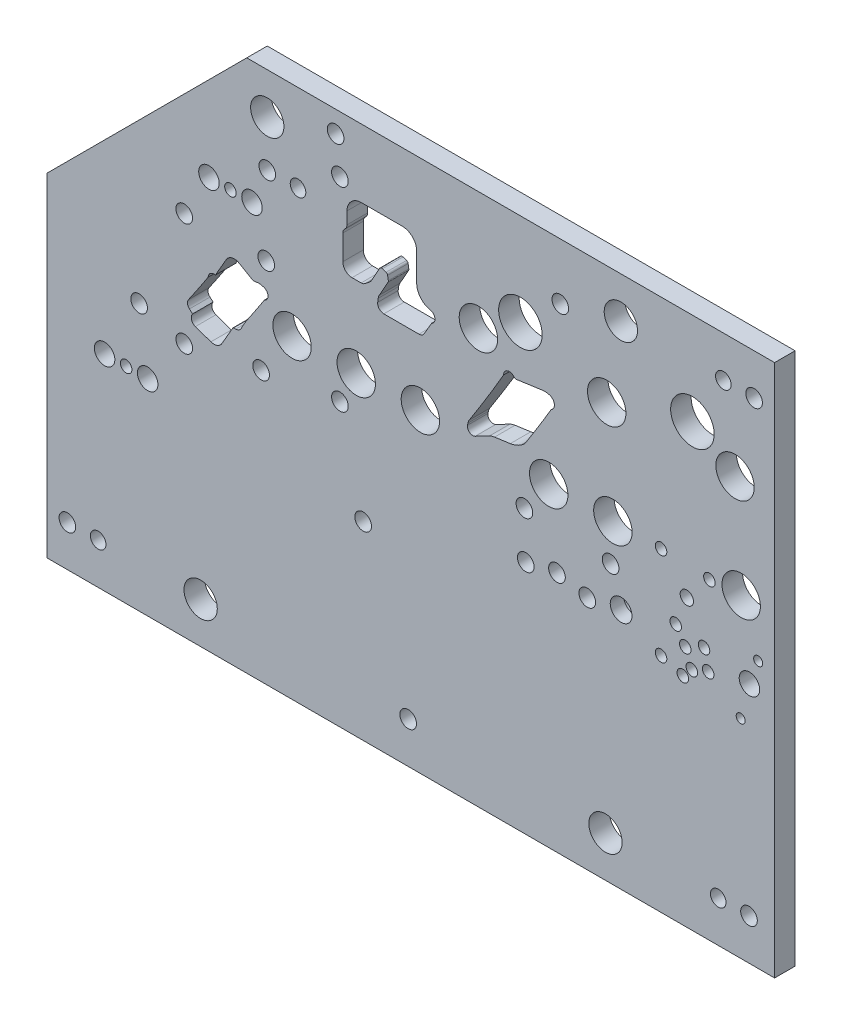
ISO-10303-21;
HEADER;
FILE_DESCRIPTION(('STEP AP214'),'2;1');
FILE_NAME('part.step','',(''),(''),'','','');
FILE_SCHEMA(('AUTOMOTIVE_DESIGN { 1 0 10303 214 1 1 1 1 }'));
ENDSEC;
DATA;
#1=APPLICATION_CONTEXT('core data for automotive mechanical design processes');
#2=APPLICATION_PROTOCOL_DEFINITION('international standard','automotive_design',2000,#1);
#3=PRODUCT_CONTEXT('',#1,'mechanical');
#4=PRODUCT('Part','Part','',(#3));
#5=PRODUCT_RELATED_PRODUCT_CATEGORY('part','',(#4));
#6=PRODUCT_DEFINITION_FORMATION('','',#4);
#7=PRODUCT_DEFINITION_CONTEXT('part definition',#1,'design');
#8=PRODUCT_DEFINITION('design','',#6,#7);
#9=PRODUCT_DEFINITION_SHAPE('','',#8);
#10=(LENGTH_UNIT() NAMED_UNIT(*) SI_UNIT(.MILLI.,.METRE.));
#11=(NAMED_UNIT(*) PLANE_ANGLE_UNIT() SI_UNIT($,.RADIAN.));
#12=(NAMED_UNIT(*) SI_UNIT($,.STERADIAN.) SOLID_ANGLE_UNIT());
#13=UNCERTAINTY_MEASURE_WITH_UNIT(LENGTH_MEASURE(1.E-05),#10,'distance_accuracy_value','');
#14=(GEOMETRIC_REPRESENTATION_CONTEXT(3) GLOBAL_UNCERTAINTY_ASSIGNED_CONTEXT((#13)) GLOBAL_UNIT_ASSIGNED_CONTEXT((#10,
#11,#12)) REPRESENTATION_CONTEXT('',''));
#15=CARTESIAN_POINT('',(0.,0.,0.));
#16=DIRECTION('',(0.,0.,1.));
#17=DIRECTION('',(1.,0.,0.));
#18=AXIS2_PLACEMENT_3D('',#15,#16,#17);
#19=CARTESIAN_POINT('',(0.,0.,12.7));
#20=DIRECTION('',(0.,0.,1.));
#21=DIRECTION('',(1.,0.,0.));
#22=AXIS2_PLACEMENT_3D('',#19,#20,#21);
#23=PLANE('',#22);
#24=DIRECTION('',(1.,0.,0.));
#25=VECTOR('',#24,1.);
#26=CARTESIAN_POINT('',(-1004.697,63.881,12.7));
#27=LINE('',#26,#25);
#28=CARTESIAN_POINT('',(-1007.29796,63.8810000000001,12.7));
#29=VERTEX_POINT('',#28);
#30=CARTESIAN_POINT('',(-1001.66258489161,63.881,12.7));
#31=VERTEX_POINT('',#30);
#32=EDGE_CURVE('E678',#29,#31,#27,.T.);
#33=ORIENTED_EDGE('',*,*,#32,.F.);
#34=CARTESIAN_POINT('',(-1007.29796,69.5960000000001,12.7));
#35=DIRECTION('',(0.,0.,1.));
#36=DIRECTION('',(1.,0.,0.));
#37=AXIS2_PLACEMENT_3D('',#34,#35,#36);
#38=CIRCLE('',#37,5.71499999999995);
#39=CARTESIAN_POINT('',(-1013.01296,69.5960000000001,12.7));
#40=VERTEX_POINT('',#39);
#41=EDGE_CURVE('E525',#40,#29,#38,.T.);
#42=ORIENTED_EDGE('',*,*,#41,.F.);
#43=DIRECTION('',(0.,-1.,0.));
#44=VECTOR('',#43,1.);
#45=CARTESIAN_POINT('',(-1013.01296,69.5960000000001,12.7));
#46=LINE('',#45,#44);
#47=CARTESIAN_POINT('',(-1013.01296,84.963,12.7));
#48=VERTEX_POINT('',#47);
#49=EDGE_CURVE('E528',#48,#40,#46,.T.);
#50=ORIENTED_EDGE('',*,*,#49,.F.);
#51=CARTESIAN_POINT('',(-1009.2055,84.963,12.7));
#52=DIRECTION('',(0.,0.,1.));
#53=DIRECTION('',(1.,0.,0.));
#54=AXIS2_PLACEMENT_3D('',#51,#52,#53);
#55=CIRCLE('',#54,3.80746000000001);
#56=CARTESIAN_POINT('',(-1011.71248,87.8286243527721,12.7));
#57=VERTEX_POINT('',#56);
#58=EDGE_CURVE('E535',#57,#48,#55,.T.);
#59=ORIENTED_EDGE('',*,*,#58,.F.);
#60=CARTESIAN_POINT('',(-1014.21946,90.6942487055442,12.7));
#61=DIRECTION('',(0.,0.,-1.));
#62=DIRECTION('',(-1.,0.,0.));
#63=AXIS2_PLACEMENT_3D('',#60,#61,#62);
#64=CIRCLE('',#63,3.80745999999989);
#65=CARTESIAN_POINT('',(-1010.412,90.6942487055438,12.7));
#66=VERTEX_POINT('',#65);
#67=EDGE_CURVE('E503',#66,#57,#64,.T.);
#68=ORIENTED_EDGE('',*,*,#67,.F.);
#69=DIRECTION('',(0.,-1.,0.));
#70=VECTOR('',#69,1.);
#71=CARTESIAN_POINT('',(-1010.412,98.1709999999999,12.7));
#72=LINE('',#71,#70);
#73=CARTESIAN_POINT('',(-1010.412,98.1709999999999,12.7));
#74=VERTEX_POINT('',#73);
#75=EDGE_CURVE('E675',#74,#66,#72,.T.);
#76=ORIENTED_EDGE('',*,*,#75,.F.);
#77=CARTESIAN_POINT('',(-1001.522,98.171,12.7));
#78=DIRECTION('',(0.,0.,1.));
#79=DIRECTION('',(1.,0.,0.));
#80=AXIS2_PLACEMENT_3D('',#77,#78,#79);
#81=CIRCLE('',#80,8.89000000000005);
#82=CARTESIAN_POINT('',(-1001.522,107.061,12.7));
#83=VERTEX_POINT('',#82);
#84=EDGE_CURVE('E672',#83,#74,#81,.T.);
#85=ORIENTED_EDGE('',*,*,#84,.F.);
#86=DIRECTION('',(-1.,0.,0.));
#87=VECTOR('',#86,1.);
#88=CARTESIAN_POINT('',(-976.122,107.061,12.7));
#89=LINE('',#88,#87);
#90=CARTESIAN_POINT('',(-976.122,107.061,12.7));
#91=VERTEX_POINT('',#90);
#92=EDGE_CURVE('E669',#91,#83,#89,.T.);
#93=ORIENTED_EDGE('',*,*,#92,.F.);
#94=CARTESIAN_POINT('',(-976.122,98.171,12.7));
#95=DIRECTION('',(0.,0.,1.));
#96=DIRECTION('',(1.,0.,0.));
#97=AXIS2_PLACEMENT_3D('',#94,#95,#96);
#98=CIRCLE('',#97,8.88999999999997);
#99=CARTESIAN_POINT('',(-967.232,98.1709999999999,12.7));
#100=VERTEX_POINT('',#99);
#101=EDGE_CURVE('E666',#100,#91,#98,.T.);
#102=ORIENTED_EDGE('',*,*,#101,.F.);
#103=DIRECTION('',(2.05435062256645E-13,1.,0.));
#104=VECTOR('',#103,1.);
#105=CARTESIAN_POINT('',(-967.232000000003,80.8773908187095,12.7));
#106=LINE('',#105,#104);
#107=CARTESIAN_POINT('',(-967.232000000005,80.8773908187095,12.7));
#108=VERTEX_POINT('',#107);
#109=EDGE_CURVE('E663',#108,#100,#106,.T.);
#110=ORIENTED_EDGE('',*,*,#109,.F.);
#111=CARTESIAN_POINT('',(-957.072,80.8773908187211,12.7));
#112=DIRECTION('',(0.,0.,-1.));
#113=DIRECTION('',(1.,0.,0.));
#114=AXIS2_PLACEMENT_3D('',#111,#112,#113);
#115=CIRCLE('',#114,10.1600000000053);
#116=CARTESIAN_POINT('',(-960.059437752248,71.166530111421,12.7));
#117=VERTEX_POINT('',#116);
#118=EDGE_CURVE('E660',#117,#108,#115,.T.);
#119=ORIENTED_EDGE('',*,*,#118,.F.);
#120=DIRECTION('',(-0.955793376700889,0.294039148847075,0.));
#121=VECTOR('',#120,1.);
#122=CARTESIAN_POINT('',(-958.408371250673,70.658597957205,12.7));
#123=LINE('',#122,#121);
#124=CARTESIAN_POINT('',(-958.408371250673,70.658597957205,12.7));
#125=VERTEX_POINT('',#124);
#126=EDGE_CURVE('E657',#125,#117,#123,.T.);
#127=ORIENTED_EDGE('',*,*,#126,.F.);
#128=CARTESIAN_POINT('',(-959.44926983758,67.2750894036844,12.7));
#129=DIRECTION('',(0.,0.,1.));
#130=DIRECTION('',(1.,0.,0.));
#131=AXIS2_PLACEMENT_3D('',#128,#129,#130);
#132=CIRCLE('',#131,3.53999999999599);
#133=CARTESIAN_POINT('',(-958.000426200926,64.0451587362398,12.7));
#134=VERTEX_POINT('',#133);
#135=EDGE_CURVE('E654',#134,#125,#132,.T.);
#136=ORIENTED_EDGE('',*,*,#135,.F.);
#137=CARTESIAN_POINT('',(-1693.66746147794,487.596028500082,12.7));
#138=DIRECTION('',(0.,0.,1.));
#139=DIRECTION('',(1.,0.,0.));
#140=AXIS2_PLACEMENT_3D('',#137,#138,#139);
#141=CIRCLE('',#140,848.882398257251);
#142=CARTESIAN_POINT('',(-962.580777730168,56.1871888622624,12.7));
#143=VERTEX_POINT('',#142);
#144=EDGE_CURVE('E651',#143,#134,#141,.T.);
#145=ORIENTED_EDGE('',*,*,#144,.F.);
#146=CARTESIAN_POINT('',(-965.862080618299,58.123461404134,12.7));
#147=DIRECTION('',(0.,0.,1.));
#148=DIRECTION('',(1.,0.,0.));
#149=AXIS2_PLACEMENT_3D('',#146,#147,#148);
#150=CIRCLE('',#149,3.81000000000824);
#151=CARTESIAN_POINT('',(-965.862080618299,54.313461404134,12.7));
#152=VERTEX_POINT('',#151);
#153=EDGE_CURVE('E648',#152,#143,#150,.T.);
#154=ORIENTED_EDGE('',*,*,#153,.F.);
#155=DIRECTION('',(1.,3.05320911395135E-13,0.));
#156=VECTOR('',#155,1.);
#157=CARTESIAN_POINT('',(-987.611398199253,54.3134614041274,12.7));
#158=LINE('',#157,#156);
#159=CARTESIAN_POINT('',(-987.611398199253,54.3134614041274,12.7));
#160=VERTEX_POINT('',#159);
#161=EDGE_CURVE('E645',#160,#152,#158,.T.);
#162=ORIENTED_EDGE('',*,*,#161,.F.);
#163=CARTESIAN_POINT('',(-987.611398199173,58.123461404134,12.7));
#164=DIRECTION('',(0.,0.,1.));
#165=DIRECTION('',(1.,0.,0.));
#166=AXIS2_PLACEMENT_3D('',#163,#164,#165);
#167=CIRCLE('',#166,3.81000000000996);
#168=CARTESIAN_POINT('',(-991.389766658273,58.6133917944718,12.7));
#169=VERTEX_POINT('',#168);
#170=EDGE_CURVE('E73',#169,#160,#167,.T.);
#171=ORIENTED_EDGE('',*,*,#170,.F.);
#172=DIRECTION('',(-0.128590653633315,-0.991697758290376,0.));
#173=VECTOR('',#172,1.);
#174=CARTESIAN_POINT('',(-991.094334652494,60.8917786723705,12.7));
#175=LINE('',#174,#173);
#176=CARTESIAN_POINT('',(-991.094334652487,60.8917786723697,12.7));
#177=VERTEX_POINT('',#176);
#178=EDGE_CURVE('E574',#177,#169,#175,.T.);
#179=ORIENTED_EDGE('',*,*,#178,.F.);
#180=CARTESIAN_POINT('',(-985.552727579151,60.17321409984,12.7));
#181=DIRECTION('',(0.,0.,1.));
#182=DIRECTION('',(1.,0.,0.));
#183=AXIS2_PLACEMENT_3D('',#180,#181,#182);
#184=CIRCLE('',#183,5.58800000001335);
#185=CARTESIAN_POINT('',(-990.404271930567,62.9459855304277,12.7));
#186=VERTEX_POINT('',#185);
#187=EDGE_CURVE('E711',#186,#177,#184,.T.);
#188=ORIENTED_EDGE('',*,*,#187,.F.);
#189=CARTESIAN_POINT('',(-1733.41846147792,487.596028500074,12.7));
#190=DIRECTION('',(0.,0.,-1.));
#191=DIRECTION('',(1.,0.,0.));
#192=AXIS2_PLACEMENT_3D('',#189,#190,#191);
#193=CIRCLE('',#192,855.80239825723);
#194=CARTESIAN_POINT('',(-984.97466852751,72.5904458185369,12.7));
#195=VERTEX_POINT('',#194);
#196=EDGE_CURVE('E708',#195,#186,#193,.T.);
#197=ORIENTED_EDGE('',*,*,#196,.F.);
#198=CARTESIAN_POINT('',(-986.251514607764,73.2984458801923,12.7));
#199=DIRECTION('',(0.,0.,-1.));
#200=DIRECTION('',(1.,0.,0.));
#201=AXIS2_PLACEMENT_3D('',#198,#199,#200);
#202=CIRCLE('',#201,1.45999999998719);
#203=CARTESIAN_POINT('',(-984.81086976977,73.5353898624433,12.7));
#204=VERTEX_POINT('',#203);
#205=EDGE_CURVE('E705',#204,#195,#202,.T.);
#206=ORIENTED_EDGE('',*,*,#205,.F.);
#207=DIRECTION('',(0.162290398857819,-0.98674303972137,0.));
#208=VECTOR('',#207,1.);
#209=CARTESIAN_POINT('',(-985.246457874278,76.1838122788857,12.7));
#210=LINE('',#209,#208);
#211=CARTESIAN_POINT('',(-985.246457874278,76.1838122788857,12.7));
#212=VERTEX_POINT('',#211);
#213=EDGE_CURVE('E702',#212,#204,#210,.T.);
#214=ORIENTED_EDGE('',*,*,#213,.F.);
#215=CARTESIAN_POINT('',(-986.687102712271,75.9468682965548,12.7));
#216=DIRECTION('',(0.,0.,-1.));
#217=DIRECTION('',(1.,0.,0.));
#218=AXIS2_PLACEMENT_3D('',#215,#216,#217);
#219=CIRCLE('',#218,1.45999999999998);
#220=CARTESIAN_POINT('',(-986.227151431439,77.3325251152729,12.7));
#221=VERTEX_POINT('',#220);
#222=EDGE_CURVE('E699',#221,#212,#219,.T.);
#223=ORIENTED_EDGE('',*,*,#222,.F.);
#224=DIRECTION('',(0.949080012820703,-0.315035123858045,0.));
#225=VECTOR('',#224,1.);
#226=CARTESIAN_POINT('',(-988.48339544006,78.0814568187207,12.7));
#227=LINE('',#226,#225);
#228=CARTESIAN_POINT('',(-988.48339544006,78.0814568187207,12.7));
#229=VERTEX_POINT('',#228);
#230=EDGE_CURVE('E696',#229,#221,#227,.T.);
#231=ORIENTED_EDGE('',*,*,#230,.F.);
#232=CARTESIAN_POINT('',(-988.94334672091,76.6958000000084,12.7));
#233=DIRECTION('',(0.,0.,-1.));
#234=DIRECTION('',(1.,0.,0.));
#235=AXIS2_PLACEMENT_3D('',#232,#233,#234);
#236=CIRCLE('',#235,1.45999999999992);
#237=CARTESIAN_POINT('',(-990.221577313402,77.4012973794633,12.7));
#238=VERTEX_POINT('',#237);
#239=EDGE_CURVE('E693',#238,#229,#236,.T.);
#240=ORIENTED_EDGE('',*,*,#239,.F.);
#241=CARTESIAN_POINT('',(-1733.41846147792,487.596028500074,12.7));
#242=DIRECTION('',(0.,0.,1.));
#243=DIRECTION('',(1.,0.,0.));
#244=AXIS2_PLACEMENT_3D('',#241,#242,#243);
#245=CIRCLE('',#244,848.882398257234);
#246=CARTESIAN_POINT('',(-995.271447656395,68.3821069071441,12.7));
#247=VERTEX_POINT('',#246);
#248=EDGE_CURVE('E690',#247,#238,#245,.T.);
#249=ORIENTED_EDGE('',*,*,#248,.F.);
#250=CARTESIAN_POINT('',(-1000.13050177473,71.1416969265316,12.7));
#251=DIRECTION('',(0.,0.,1.));
#252=DIRECTION('',(1.,0.,0.));
#253=AXIS2_PLACEMENT_3D('',#250,#251,#252);
#254=CIRCLE('',#253,5.58799999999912);
#255=CARTESIAN_POINT('',(-996.692906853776,66.736167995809,12.7));
#256=VERTEX_POINT('',#255);
#257=EDGE_CURVE('E687',#256,#247,#254,.T.);
#258=ORIENTED_EDGE('',*,*,#257,.F.);
#259=DIRECTION('',(0.788391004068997,0.615174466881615,0.));
#260=VECTOR('',#259,1.);
#261=CARTESIAN_POINT('',(-999.318770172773,64.6872302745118,12.7));
#262=LINE('',#261,#260);
#263=CARTESIAN_POINT('',(-999.318770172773,64.6872302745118,12.7));
#264=VERTEX_POINT('',#263);
#265=EDGE_CURVE('E684',#264,#256,#262,.T.);
#266=ORIENTED_EDGE('',*,*,#265,.F.);
#267=CARTESIAN_POINT('',(-1001.66258489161,67.691,12.7));
#268=DIRECTION('',(0.,0.,1.));
#269=DIRECTION('',(1.,0.,0.));
#270=AXIS2_PLACEMENT_3D('',#267,#268,#269);
#271=CIRCLE('',#270,3.80999999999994);
#272=EDGE_CURVE('E681',#31,#264,#271,.T.);
#273=ORIENTED_EDGE('',*,*,#272,.F.);
#274=EDGE_LOOP('',(#33,#42,#50,#59,#68,#76,#85,#93,#102,#110,#119,#127,#136,#145,#154,#162,#171,
#179,#188,#197,#206,#214,#223,#231,#240,#249,#258,#266,#273));
#275=FACE_BOUND('',#274,.T.);
#276=CARTESIAN_POINT('',(-755.681295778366,-15.9938728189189,12.7));
#277=DIRECTION('',(0.,0.,1.));
#278=DIRECTION('',(1.,0.,0.));
#279=AXIS2_PLACEMENT_3D('',#276,#277,#278);
#280=CIRCLE('',#279,2.80670000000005);
#281=CARTESIAN_POINT('',(-752.874595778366,-15.9938728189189,12.7));
#282=VERTEX_POINT('',#281);
#283=EDGE_CURVE('E550',#282,#282,#280,.T.);
#284=ORIENTED_EDGE('',*,*,#283,.F.);
#285=EDGE_LOOP('',(#284));
#286=FACE_BOUND('',#285,.T.);
#287=CARTESIAN_POINT('',(-766.476295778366,-52.1888728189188,12.7));
#288=DIRECTION('',(0.,0.,1.));
#289=DIRECTION('',(1.,0.,0.));
#290=AXIS2_PLACEMENT_3D('',#287,#288,#289);
#291=CIRCLE('',#290,2.80670000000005);
#292=CARTESIAN_POINT('',(-763.669595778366,-52.1888728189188,12.7));
#293=VERTEX_POINT('',#292);
#294=EDGE_CURVE('E558',#293,#293,#291,.T.);
#295=ORIENTED_EDGE('',*,*,#294,.F.);
#296=EDGE_LOOP('',(#295));
#297=FACE_BOUND('',#296,.T.);
#298=CARTESIAN_POINT('',(-761.078795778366,-30.9504062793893,12.7));
#299=DIRECTION('',(0.,0.,-1.));
#300=DIRECTION('',(-1.,0.,0.));
#301=AXIS2_PLACEMENT_3D('',#298,#299,#300);
#302=CIRCLE('',#301,6.34999999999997);
#303=CARTESIAN_POINT('',(-767.428795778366,-30.9504062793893,12.7));
#304=VERTEX_POINT('',#303);
#305=EDGE_CURVE('E562',#304,#304,#302,.T.);
#306=ORIENTED_EDGE('',*,*,#305,.T.);
#307=EDGE_LOOP('',(#306));
#308=FACE_BOUND('',#307,.T.);
#309=DIRECTION('',(0.,1.,0.));
#310=VECTOR('',#309,1.);
#311=CARTESIAN_POINT('',(-745.49,-180.975,12.7));
#312=LINE('',#311,#310);
#313=CARTESIAN_POINT('',(-745.49,-180.975,12.7));
#314=VERTEX_POINT('',#313);
#315=CARTESIAN_POINT('',(-745.49,149.225,12.7));
#316=VERTEX_POINT('',#315);
#317=EDGE_CURVE('E1413',#314,#316,#312,.T.);
#318=ORIENTED_EDGE('',*,*,#317,.T.);
#319=DIRECTION('',(-1.,0.,0.));
#320=VECTOR('',#319,1.);
#321=CARTESIAN_POINT('',(-745.49,149.225,12.7));
#322=LINE('',#321,#320);
#323=CARTESIAN_POINT('',(-1072.515,149.225,12.7));
#324=VERTEX_POINT('',#323);
#325=EDGE_CURVE('E1417',#316,#324,#322,.T.);
#326=ORIENTED_EDGE('',*,*,#325,.T.);
#327=DIRECTION('',(-0.707106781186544,-0.707106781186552,0.));
#328=VECTOR('',#327,1.);
#329=CARTESIAN_POINT('',(-1072.515,149.225,12.7));
#330=LINE('',#329,#328);
#331=CARTESIAN_POINT('',(-1196.34,25.3999999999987,12.7));
#332=VERTEX_POINT('',#331);
#333=EDGE_CURVE('E1420',#324,#332,#330,.T.);
#334=ORIENTED_EDGE('',*,*,#333,.T.);
#335=DIRECTION('',(0.,-1.,0.));
#336=VECTOR('',#335,1.);
#337=CARTESIAN_POINT('',(-1196.34,25.3999999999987,12.7));
#338=LINE('',#337,#336);
#339=CARTESIAN_POINT('',(-1196.34,-180.975,12.7));
#340=VERTEX_POINT('',#339);
#341=EDGE_CURVE('E1422',#332,#340,#338,.T.);
#342=ORIENTED_EDGE('',*,*,#341,.T.);
#343=DIRECTION('',(1.,0.,0.));
#344=VECTOR('',#343,1.);
#345=CARTESIAN_POINT('',(-1196.34,-180.975,12.7));
#346=LINE('',#345,#344);
#347=EDGE_CURVE('E1424',#340,#314,#346,.T.);
#348=ORIENTED_EDGE('',*,*,#347,.T.);
#349=EDGE_LOOP('',(#318,#326,#334,#342,#348));
#350=FACE_BOUND('',#349,.T.);
#351=CARTESIAN_POINT('',(-796.778000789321,-41.1769872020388,12.7));
#352=DIRECTION('',(0.,0.,-1.));
#353=DIRECTION('',(-1.,0.,0.));
#354=AXIS2_PLACEMENT_3D('',#351,#352,#353);
#355=CIRCLE('',#354,3.571875);
#356=CARTESIAN_POINT('',(-800.349875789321,-41.1769872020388,12.7));
#357=VERTEX_POINT('',#356);
#358=EDGE_CURVE('E1406',#357,#357,#355,.T.);
#359=ORIENTED_EDGE('',*,*,#358,.T.);
#360=EDGE_LOOP('',(#359));
#361=FACE_BOUND('',#360,.T.);
#362=CARTESIAN_POINT('',(-802.354782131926,-47.2412554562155,12.7));
#363=DIRECTION('',(0.,0.,-1.));
#364=DIRECTION('',(-1.,0.,0.));
#365=AXIS2_PLACEMENT_3D('',#362,#363,#364);
#366=CIRCLE('',#365,3.571875);
#367=CARTESIAN_POINT('',(-805.926657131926,-47.2412554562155,12.7));
#368=VERTEX_POINT('',#367);
#369=EDGE_CURVE('E1400',#368,#368,#366,.T.);
#370=ORIENTED_EDGE('',*,*,#369,.T.);
#371=EDGE_LOOP('',(#370));
#372=FACE_BOUND('',#371,.T.);
#373=CARTESIAN_POINT('',(-789.220778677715,-25.5532134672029,12.7));
#374=DIRECTION('',(0.,0.,-1.));
#375=DIRECTION('',(-1.,0.,0.));
#376=AXIS2_PLACEMENT_3D('',#373,#374,#375);
#377=CIRCLE('',#376,3.571875);
#378=CARTESIAN_POINT('',(-792.792653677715,-25.5532134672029,12.7));
#379=VERTEX_POINT('',#378);
#380=EDGE_CURVE('E1394',#379,#379,#377,.T.);
#381=ORIENTED_EDGE('',*,*,#380,.T.);
#382=EDGE_LOOP('',(#381));
#383=FACE_BOUND('',#382,.T.);
#384=CARTESIAN_POINT('',(-806.760388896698,-21.6860625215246,12.7));
#385=DIRECTION('',(0.,0.,-1.));
#386=DIRECTION('',(-1.,0.,0.));
#387=AXIS2_PLACEMENT_3D('',#384,#385,#386);
#388=CIRCLE('',#387,3.571875);
#389=CARTESIAN_POINT('',(-810.332263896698,-21.6860625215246,12.7));
#390=VERTEX_POINT('',#389);
#391=EDGE_CURVE('E1388',#390,#390,#388,.T.);
#392=ORIENTED_EDGE('',*,*,#391,.T.);
#393=EDGE_LOOP('',(#392));
#394=FACE_BOUND('',#393,.T.);
#395=CARTESIAN_POINT('',(-799.873146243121,-4.1097131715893,12.7));
#396=DIRECTION('',(0.,0.,1.));
#397=DIRECTION('',(1.,0.,0.));
#398=AXIS2_PLACEMENT_3D('',#395,#396,#397);
#399=CIRCLE('',#398,4.13384999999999);
#400=CARTESIAN_POINT('',(-795.739296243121,-4.1097131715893,12.7));
#401=VERTEX_POINT('',#400);
#402=EDGE_CURVE('E1385',#401,#401,#399,.T.);
#403=ORIENTED_EDGE('',*,*,#402,.F.);
#404=EDGE_LOOP('',(#403));
#405=FACE_BOUND('',#404,.T.);
#406=CARTESIAN_POINT('',(-800.829795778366,-30.9504062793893,12.7));
#407=DIRECTION('',(0.,0.,1.));
#408=DIRECTION('',(1.,0.,0.));
#409=AXIS2_PLACEMENT_3D('',#406,#407,#408);
#410=CIRCLE('',#409,3.571875);
#411=CARTESIAN_POINT('',(-797.257920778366,-30.9504062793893,12.7));
#412=VERTEX_POINT('',#411);
#413=EDGE_CURVE('E1379',#412,#412,#410,.T.);
#414=ORIENTED_EDGE('',*,*,#413,.F.);
#415=EDGE_LOOP('',(#414));
#416=FACE_BOUND('',#415,.T.);
#417=CARTESIAN_POINT('',(-880.331795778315,-30.9504062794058,12.7));
#418=DIRECTION('',(0.,0.,-1.));
#419=DIRECTION('',(-1.,0.,0.));
#420=AXIS2_PLACEMENT_3D('',#417,#418,#419);
#421=CIRCLE('',#420,5.15937499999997);
#422=CARTESIAN_POINT('',(-885.491170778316,-30.9504062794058,12.7));
#423=VERTEX_POINT('',#422);
#424=EDGE_CURVE('E1370',#423,#423,#421,.T.);
#425=ORIENTED_EDGE('',*,*,#424,.T.);
#426=EDGE_LOOP('',(#425));
#427=FACE_BOUND('',#426,.T.);
#428=CARTESIAN_POINT('',(-840.580795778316,-30.9504062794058,12.7));
#429=DIRECTION('',(0.,0.,-1.));
#430=DIRECTION('',(-1.,0.,0.));
#431=AXIS2_PLACEMENT_3D('',#428,#429,#430);
#432=CIRCLE('',#431,6.74687500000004);
#433=CARTESIAN_POINT('',(-847.327670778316,-30.9504062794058,12.7));
#434=VERTEX_POINT('',#433);
#435=EDGE_CURVE('E1361',#434,#434,#432,.T.);
#436=ORIENTED_EDGE('',*,*,#435,.T.);
#437=EDGE_LOOP('',(#436));
#438=FACE_BOUND('',#437,.T.);
#439=CARTESIAN_POINT('',(-845.693,13.97,12.7));
#440=DIRECTION('',(0.,0.,-1.));
#441=DIRECTION('',(-1.,0.,0.));
#442=AXIS2_PLACEMENT_3D('',#439,#440,#441);
#443=CIRCLE('',#442,11.90625);
#444=CARTESIAN_POINT('',(-857.59925,13.97,12.7));
#445=VERTEX_POINT('',#444);
#446=EDGE_CURVE('E1355',#445,#445,#443,.T.);
#447=ORIENTED_EDGE('',*,*,#446,.T.);
#448=EDGE_LOOP('',(#447));
#449=FACE_BOUND('',#448,.T.);
#450=CARTESIAN_POINT('',(-766.191,13.97,12.7));
#451=DIRECTION('',(0.,0.,-1.));
#452=DIRECTION('',(-1.,0.,0.));
#453=AXIS2_PLACEMENT_3D('',#450,#451,#452);
#454=CIRCLE('',#453,11.90625);
#455=CARTESIAN_POINT('',(-778.09725,13.97,12.7));
#456=VERTEX_POINT('',#455);
#457=EDGE_CURVE('E1347',#456,#456,#454,.T.);
#458=ORIENTED_EDGE('',*,*,#457,.T.);
#459=EDGE_LOOP('',(#458));
#460=FACE_BOUND('',#459,.T.);
#461=CARTESIAN_POINT('',(-885.444,13.97,12.7));
#462=DIRECTION('',(0.,0.,-1.));
#463=DIRECTION('',(-1.,0.,0.));
#464=AXIS2_PLACEMENT_3D('',#461,#462,#463);
#465=CIRCLE('',#464,11.90625);
#466=CARTESIAN_POINT('',(-897.35025,13.97,12.7));
#467=VERTEX_POINT('',#466);
#468=EDGE_CURVE('E1341',#467,#467,#465,.T.);
#469=ORIENTED_EDGE('',*,*,#468,.T.);
#470=EDGE_LOOP('',(#469));
#471=FACE_BOUND('',#470,.T.);
#472=CARTESIAN_POINT('',(-964.946,13.97,12.7));
#473=DIRECTION('',(0.,0.,-1.));
#474=DIRECTION('',(-1.,0.,0.));
#475=AXIS2_PLACEMENT_3D('',#472,#473,#474);
#476=CIRCLE('',#475,11.90625);
#477=CARTESIAN_POINT('',(-976.85225,13.97,12.7));
#478=VERTEX_POINT('',#477);
#479=EDGE_CURVE('E1335',#478,#478,#476,.T.);
#480=ORIENTED_EDGE('',*,*,#479,.T.);
#481=EDGE_LOOP('',(#480));
#482=FACE_BOUND('',#481,.T.);
#483=CARTESIAN_POINT('',(-1004.697,13.97,12.7));
#484=DIRECTION('',(0.,0.,-1.));
#485=DIRECTION('',(-1.,0.,0.));
#486=AXIS2_PLACEMENT_3D('',#483,#484,#485);
#487=CIRCLE('',#486,11.90625);
#488=CARTESIAN_POINT('',(-1016.60325,13.97,12.7));
#489=VERTEX_POINT('',#488);
#490=EDGE_CURVE('E1329',#489,#489,#487,.T.);
#491=ORIENTED_EDGE('',*,*,#490,.T.);
#492=EDGE_LOOP('',(#491));
#493=FACE_BOUND('',#492,.T.);
#494=CARTESIAN_POINT('',(-1044.448,13.97,12.7));
#495=DIRECTION('',(0.,0.,-1.));
#496=DIRECTION('',(-1.,0.,0.));
#497=AXIS2_PLACEMENT_3D('',#494,#495,#496);
#498=CIRCLE('',#497,11.90625);
#499=CARTESIAN_POINT('',(-1056.35425,13.97,12.7));
#500=VERTEX_POINT('',#499);
#501=EDGE_CURVE('E1323',#500,#500,#498,.T.);
#502=ORIENTED_EDGE('',*,*,#501,.T.);
#503=EDGE_LOOP('',(#502));
#504=FACE_BOUND('',#503,.T.);
#505=CARTESIAN_POINT('',(-929.005,75.8952,12.7));
#506=DIRECTION('',(0.,0.,-1.));
#507=DIRECTION('',(-1.,0.,0.));
#508=AXIS2_PLACEMENT_3D('',#505,#506,#507);
#509=CIRCLE('',#508,11.90625);
#510=CARTESIAN_POINT('',(-940.91125,75.8952,12.7));
#511=VERTEX_POINT('',#510);
#512=EDGE_CURVE('E1317',#511,#511,#509,.T.);
#513=ORIENTED_EDGE('',*,*,#512,.T.);
#514=EDGE_LOOP('',(#513));
#515=FACE_BOUND('',#514,.T.);
#516=CARTESIAN_POINT('',(-849.503,75.8952,12.7));
#517=DIRECTION('',(0.,0.,-1.));
#518=DIRECTION('',(-1.,0.,0.));
#519=AXIS2_PLACEMENT_3D('',#516,#517,#518);
#520=CIRCLE('',#519,11.90625);
#521=CARTESIAN_POINT('',(-861.40925,75.8952,12.7));
#522=VERTEX_POINT('',#521);
#523=EDGE_CURVE('E1311',#522,#522,#520,.T.);
#524=ORIENTED_EDGE('',*,*,#523,.T.);
#525=EDGE_LOOP('',(#524));
#526=FACE_BOUND('',#525,.T.);
#527=CARTESIAN_POINT('',(-770.001,75.8952,12.7));
#528=DIRECTION('',(0.,0.,-1.));
#529=DIRECTION('',(-1.,0.,0.));
#530=AXIS2_PLACEMENT_3D('',#527,#528,#529);
#531=CIRCLE('',#530,11.90625);
#532=CARTESIAN_POINT('',(-781.90725,75.8952,12.7));
#533=VERTEX_POINT('',#532);
#534=EDGE_CURVE('E1305',#533,#533,#531,.T.);
#535=ORIENTED_EDGE('',*,*,#534,.T.);
#536=EDGE_LOOP('',(#535));
#537=FACE_BOUND('',#536,.T.);
#538=CARTESIAN_POINT('',(-902.97,92.075,12.7));
#539=DIRECTION('',(0.,0.,1.));
#540=DIRECTION('',(1.,0.,0.));
#541=AXIS2_PLACEMENT_3D('',#538,#539,#540);
#542=CIRCLE('',#541,13.49375);
#543=CARTESIAN_POINT('',(-889.47625,92.075,12.7));
#544=VERTEX_POINT('',#543);
#545=EDGE_CURVE('E1302',#544,#544,#542,.T.);
#546=ORIENTED_EDGE('',*,*,#545,.F.);
#547=EDGE_LOOP('',(#546));
#548=FACE_BOUND('',#547,.T.);
#549=CARTESIAN_POINT('',(-796.417,92.075,12.7));
#550=DIRECTION('',(0.,0.,1.));
#551=DIRECTION('',(1.,0.,0.));
#552=AXIS2_PLACEMENT_3D('',#549,#550,#551);
#553=CIRCLE('',#552,13.49375);
#554=CARTESIAN_POINT('',(-782.92325,92.075,12.7));
#555=VERTEX_POINT('',#554);
#556=EDGE_CURVE('E1296',#555,#555,#553,.T.);
#557=ORIENTED_EDGE('',*,*,#556,.F.);
#558=EDGE_LOOP('',(#557));
#559=FACE_BOUND('',#558,.T.);
#560=CARTESIAN_POINT('',(-1139.19,-15.8750000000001,12.7));
#561=DIRECTION('',(0.,0.,1.));
#562=DIRECTION('',(1.,0.,0.));
#563=AXIS2_PLACEMENT_3D('',#560,#561,#562);
#564=CIRCLE('',#563,5.15620000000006);
#565=CARTESIAN_POINT('',(-1134.0338,-15.8750000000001,12.7));
#566=VERTEX_POINT('',#565);
#567=EDGE_CURVE('E1290',#566,#566,#564,.T.);
#568=ORIENTED_EDGE('',*,*,#567,.F.);
#569=EDGE_LOOP('',(#568));
#570=FACE_BOUND('',#569,.T.);
#571=CARTESIAN_POINT('',(-972.5025,-155.575,12.7));
#572=DIRECTION('',(0.,0.,1.));
#573=DIRECTION('',(1.,0.,0.));
#574=AXIS2_PLACEMENT_3D('',#571,#572,#573);
#575=CIRCLE('',#574,5.15619999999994);
#576=CARTESIAN_POINT('',(-967.3463,-155.575,12.7));
#577=VERTEX_POINT('',#576);
#578=EDGE_CURVE('E1284',#577,#577,#575,.T.);
#579=ORIENTED_EDGE('',*,*,#578,.F.);
#580=EDGE_LOOP('',(#579));
#581=FACE_BOUND('',#580,.T.);
#582=CARTESIAN_POINT('',(-847.09,-9.52500000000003,12.7));
#583=DIRECTION('',(0.,0.,1.));
#584=DIRECTION('',(1.,0.,0.));
#585=AXIS2_PLACEMENT_3D('',#582,#583,#584);
#586=CIRCLE('',#585,5.15620000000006);
#587=CARTESIAN_POINT('',(-841.9338,-9.52500000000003,12.7));
#588=VERTEX_POINT('',#587);
#589=EDGE_CURVE('E1278',#588,#588,#586,.T.);
#590=ORIENTED_EDGE('',*,*,#589,.F.);
#591=EDGE_LOOP('',(#590));
#592=FACE_BOUND('',#591,.T.);
#593=CARTESIAN_POINT('',(-1000.379,-63.5,12.7));
#594=DIRECTION('',(0.,0.,1.));
#595=DIRECTION('',(1.,0.,0.));
#596=AXIS2_PLACEMENT_3D('',#593,#594,#595);
#597=CIRCLE('',#596,5.15620000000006);
#598=CARTESIAN_POINT('',(-995.2228,-63.5,12.7));
#599=VERTEX_POINT('',#598);
#600=EDGE_CURVE('E1272',#599,#599,#597,.T.);
#601=ORIENTED_EDGE('',*,*,#600,.F.);
#602=EDGE_LOOP('',(#601));
#603=FACE_BOUND('',#602,.T.);
#604=CARTESIAN_POINT('',(-1059.815,95.25,12.7));
#605=DIRECTION('',(0.,0.,1.));
#606=DIRECTION('',(1.,0.,0.));
#607=AXIS2_PLACEMENT_3D('',#604,#605,#606);
#608=CIRCLE('',#607,5.15620000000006);
#609=CARTESIAN_POINT('',(-1054.6588,95.25,12.7));
#610=VERTEX_POINT('',#609);
#611=EDGE_CURVE('E1266',#610,#610,#608,.T.);
#612=ORIENTED_EDGE('',*,*,#611,.F.);
#613=EDGE_LOOP('',(#612));
#614=FACE_BOUND('',#613,.T.);
#615=CARTESIAN_POINT('',(-1183.64,-155.575,12.7));
#616=DIRECTION('',(0.,0.,1.));
#617=DIRECTION('',(1.,0.,0.));
#618=AXIS2_PLACEMENT_3D('',#615,#616,#617);
#619=CIRCLE('',#618,5.15620000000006);
#620=CARTESIAN_POINT('',(-1178.4838,-155.575,12.7));
#621=VERTEX_POINT('',#620);
#622=EDGE_CURVE('E1260',#621,#621,#619,.T.);
#623=ORIENTED_EDGE('',*,*,#622,.F.);
#624=EDGE_LOOP('',(#623));
#625=FACE_BOUND('',#624,.T.);
#626=CARTESIAN_POINT('',(-761.365,-155.575,12.7));
#627=DIRECTION('',(0.,0.,1.));
#628=DIRECTION('',(1.,0.,0.));
#629=AXIS2_PLACEMENT_3D('',#626,#627,#628);
#630=CIRCLE('',#629,5.15619999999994);
#631=CARTESIAN_POINT('',(-756.2088,-155.575,12.7));
#632=VERTEX_POINT('',#631);
#633=EDGE_CURVE('E1253',#632,#632,#630,.T.);
#634=ORIENTED_EDGE('',*,*,#633,.F.);
#635=EDGE_LOOP('',(#634));
#636=FACE_BOUND('',#635,.T.);
#637=CARTESIAN_POINT('',(-758.19,123.825,12.7));
#638=DIRECTION('',(0.,0.,1.));
#639=DIRECTION('',(1.,0.,0.));
#640=AXIS2_PLACEMENT_3D('',#637,#638,#639);
#641=CIRCLE('',#640,5.15620000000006);
#642=CARTESIAN_POINT('',(-753.0338,123.825,12.7));
#643=VERTEX_POINT('',#642);
#644=EDGE_CURVE('E1246',#643,#643,#641,.T.);
#645=ORIENTED_EDGE('',*,*,#644,.F.);
#646=EDGE_LOOP('',(#645));
#647=FACE_BOUND('',#646,.T.);
#648=CARTESIAN_POINT('',(-780.415,-155.575,12.7));
#649=DIRECTION('',(0.,0.,-1.));
#650=DIRECTION('',(-1.,0.,0.));
#651=AXIS2_PLACEMENT_3D('',#648,#649,#650);
#652=CIRCLE('',#651,4.826);
#653=CARTESIAN_POINT('',(-785.241,-155.575,12.7));
#654=VERTEX_POINT('',#653);
#655=EDGE_CURVE('E1235',#654,#654,#652,.T.);
#656=ORIENTED_EDGE('',*,*,#655,.T.);
#657=EDGE_LOOP('',(#656));
#658=FACE_BOUND('',#657,.T.);
#659=CARTESIAN_POINT('',(-777.24,123.825,12.7));
#660=DIRECTION('',(0.,0.,-1.));
#661=DIRECTION('',(-1.,0.,0.));
#662=AXIS2_PLACEMENT_3D('',#659,#660,#661);
#663=CIRCLE('',#662,4.826);
#664=CARTESIAN_POINT('',(-782.066,123.825,12.7));
#665=VERTEX_POINT('',#664);
#666=EDGE_CURVE('E1229',#665,#665,#663,.T.);
#667=ORIENTED_EDGE('',*,*,#666,.T.);
#668=EDGE_LOOP('',(#667));
#669=FACE_BOUND('',#668,.T.);
#670=CARTESIAN_POINT('',(-1040.765,95.25,12.7));
#671=DIRECTION('',(0.,0.,-1.));
#672=DIRECTION('',(-1.,0.,0.));
#673=AXIS2_PLACEMENT_3D('',#670,#671,#672);
#674=CIRCLE('',#673,4.826);
#675=CARTESIAN_POINT('',(-1045.591,95.25,12.7));
#676=VERTEX_POINT('',#675);
#677=EDGE_CURVE('E1223',#676,#676,#674,.T.);
#678=ORIENTED_EDGE('',*,*,#677,.T.);
#679=EDGE_LOOP('',(#678));
#680=FACE_BOUND('',#679,.T.);
#681=CARTESIAN_POINT('',(-1164.59,-155.575,12.7));
#682=DIRECTION('',(0.,0.,-1.));
#683=DIRECTION('',(-1.,0.,0.));
#684=AXIS2_PLACEMENT_3D('',#681,#682,#683);
#685=CIRCLE('',#684,4.826);
#686=CARTESIAN_POINT('',(-1169.416,-155.575,12.7));
#687=VERTEX_POINT('',#686);
#688=EDGE_CURVE('E1217',#687,#687,#685,.T.);
#689=ORIENTED_EDGE('',*,*,#688,.T.);
#690=EDGE_LOOP('',(#689));
#691=FACE_BOUND('',#690,.T.);
#692=CARTESIAN_POINT('',(-850.265,-155.575,12.7));
#693=DIRECTION('',(0.,0.,1.));
#694=DIRECTION('',(1.,0.,0.));
#695=AXIS2_PLACEMENT_3D('',#692,#693,#694);
#696=CIRCLE('',#695,10.31875);
#697=CARTESIAN_POINT('',(-839.94625,-155.575,12.7));
#698=VERTEX_POINT('',#697);
#699=EDGE_CURVE('E1214',#698,#698,#696,.T.);
#700=ORIENTED_EDGE('',*,*,#699,.F.);
#701=EDGE_LOOP('',(#700));
#702=FACE_BOUND('',#701,.T.);
#703=CARTESIAN_POINT('',(-840.74,123.825,12.7));
#704=DIRECTION('',(0.,0.,1.));
#705=DIRECTION('',(1.,0.,0.));
#706=AXIS2_PLACEMENT_3D('',#703,#704,#705);
#707=CIRCLE('',#706,10.31875);
#708=CARTESIAN_POINT('',(-830.42125,123.825,12.7));
#709=VERTEX_POINT('',#708);
#710=EDGE_CURVE('E1208',#709,#709,#707,.T.);
#711=ORIENTED_EDGE('',*,*,#710,.F.);
#712=EDGE_LOOP('',(#711));
#713=FACE_BOUND('',#712,.T.);
#714=CARTESIAN_POINT('',(-1059.815,123.825,12.7));
#715=DIRECTION('',(0.,0.,1.));
#716=DIRECTION('',(1.,0.,0.));
#717=AXIS2_PLACEMENT_3D('',#714,#715,#716);
#718=CIRCLE('',#717,10.3187499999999);
#719=CARTESIAN_POINT('',(-1049.49625,123.825,12.7));
#720=VERTEX_POINT('',#719);
#721=EDGE_CURVE('E1202',#720,#720,#718,.T.);
#722=ORIENTED_EDGE('',*,*,#721,.F.);
#723=EDGE_LOOP('',(#722));
#724=FACE_BOUND('',#723,.T.);
#725=CARTESIAN_POINT('',(-1101.09,-155.575,12.7));
#726=DIRECTION('',(0.,0.,1.));
#727=DIRECTION('',(1.,0.,0.));
#728=AXIS2_PLACEMENT_3D('',#725,#726,#727);
#729=CIRCLE('',#728,10.3187499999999);
#730=CARTESIAN_POINT('',(-1090.77125,-155.575,12.7));
#731=VERTEX_POINT('',#730);
#732=EDGE_CURVE('E1196',#731,#731,#729,.T.);
#733=ORIENTED_EDGE('',*,*,#732,.F.);
#734=EDGE_LOOP('',(#733));
#735=FACE_BOUND('',#734,.T.);
#736=CARTESIAN_POINT('',(-1014.7935,-6.34999999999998,12.7));
#737=DIRECTION('',(0.,0.,1.));
#738=DIRECTION('',(1.,0.,0.));
#739=AXIS2_PLACEMENT_3D('',#736,#737,#738);
#740=CIRCLE('',#739,5.15620000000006);
#741=CARTESIAN_POINT('',(-1009.6373,-6.34999999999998,12.7));
#742=VERTEX_POINT('',#741);
#743=EDGE_CURVE('E1190',#742,#742,#740,.T.);
#744=ORIENTED_EDGE('',*,*,#743,.F.);
#745=EDGE_LOOP('',(#744));
#746=FACE_BOUND('',#745,.T.);
#747=CARTESIAN_POINT('',(-1014.7935,114.3,12.7));
#748=DIRECTION('',(0.,0.,1.));
#749=DIRECTION('',(1.,0.,0.));
#750=AXIS2_PLACEMENT_3D('',#747,#748,#749);
#751=CIRCLE('',#750,5.15620000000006);
#752=CARTESIAN_POINT('',(-1009.6373,114.3,12.7));
#753=VERTEX_POINT('',#752);
#754=EDGE_CURVE('E1184',#753,#753,#751,.T.);
#755=ORIENTED_EDGE('',*,*,#754,.F.);
#756=EDGE_LOOP('',(#755));
#757=FACE_BOUND('',#756,.T.);
#758=CARTESIAN_POINT('',(-878.2685,114.3,12.7));
#759=DIRECTION('',(0.,0.,1.));
#760=DIRECTION('',(1.,0.,0.));
#761=AXIS2_PLACEMENT_3D('',#758,#759,#760);
#762=CIRCLE('',#761,5.15620000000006);
#763=CARTESIAN_POINT('',(-873.1123,114.3,12.7));
#764=VERTEX_POINT('',#763);
#765=EDGE_CURVE('E1178',#764,#764,#762,.T.);
#766=ORIENTED_EDGE('',*,*,#765,.F.);
#767=EDGE_LOOP('',(#766));
#768=FACE_BOUND('',#767,.T.);
#769=CARTESIAN_POINT('',(-900.4935,-6.34999999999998,12.7));
#770=DIRECTION('',(0.,0.,1.));
#771=DIRECTION('',(1.,0.,0.));
#772=AXIS2_PLACEMENT_3D('',#769,#770,#771);
#773=CIRCLE('',#772,5.15619999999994);
#774=CARTESIAN_POINT('',(-895.3373,-6.34999999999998,12.7));
#775=VERTEX_POINT('',#774);
#776=EDGE_CURVE('E1172',#775,#775,#773,.T.);
#777=ORIENTED_EDGE('',*,*,#776,.F.);
#778=EDGE_LOOP('',(#777));
#779=FACE_BOUND('',#778,.T.);
#780=CARTESIAN_POINT('',(-1111.25,46.355,12.7));
#781=DIRECTION('',(0.,0.,1.));
#782=DIRECTION('',(1.,0.,0.));
#783=AXIS2_PLACEMENT_3D('',#780,#781,#782);
#784=CIRCLE('',#783,5.15620000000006);
#785=CARTESIAN_POINT('',(-1106.0938,46.355,12.7));
#786=VERTEX_POINT('',#785);
#787=EDGE_CURVE('E1166',#786,#786,#784,.T.);
#788=ORIENTED_EDGE('',*,*,#787,.F.);
#789=EDGE_LOOP('',(#788));
#790=FACE_BOUND('',#789,.T.);
#791=CARTESIAN_POINT('',(-1060.45,46.355,12.7));
#792=DIRECTION('',(0.,0.,1.));
#793=DIRECTION('',(1.,0.,0.));
#794=AXIS2_PLACEMENT_3D('',#791,#792,#793);
#795=CIRCLE('',#794,5.15620000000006);
#796=CARTESIAN_POINT('',(-1055.2938,46.355,12.7));
#797=VERTEX_POINT('',#796);
#798=EDGE_CURVE('E1160',#797,#797,#795,.T.);
#799=ORIENTED_EDGE('',*,*,#798,.F.);
#800=EDGE_LOOP('',(#799));
#801=FACE_BOUND('',#800,.T.);
#802=CARTESIAN_POINT('',(-1063.625,-13.97,12.7));
#803=DIRECTION('',(0.,0.,1.));
#804=DIRECTION('',(1.,0.,0.));
#805=AXIS2_PLACEMENT_3D('',#802,#803,#804);
#806=CIRCLE('',#805,5.15620000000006);
#807=CARTESIAN_POINT('',(-1058.4688,-13.97,12.7));
#808=VERTEX_POINT('',#807);
#809=EDGE_CURVE('E1154',#808,#808,#806,.T.);
#810=ORIENTED_EDGE('',*,*,#809,.F.);
#811=EDGE_LOOP('',(#810));
#812=FACE_BOUND('',#811,.T.);
#813=CARTESIAN_POINT('',(-1111.25,-23.495,12.7));
#814=DIRECTION('',(0.,0.,1.));
#815=DIRECTION('',(1.,0.,0.));
#816=AXIS2_PLACEMENT_3D('',#813,#814,#815);
#817=CIRCLE('',#816,5.15620000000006);
#818=CARTESIAN_POINT('',(-1106.0938,-23.495,12.7));
#819=VERTEX_POINT('',#818);
#820=EDGE_CURVE('E1148',#819,#819,#817,.T.);
#821=ORIENTED_EDGE('',*,*,#820,.F.);
#822=EDGE_LOOP('',(#821));
#823=FACE_BOUND('',#822,.T.);
#824=CARTESIAN_POINT('',(-815.848,-43.1751649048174,12.7));
#825=DIRECTION('',(0.,0.,1.));
#826=DIRECTION('',(1.,0.,0.));
#827=AXIS2_PLACEMENT_3D('',#824,#825,#826);
#828=CIRCLE('',#827,3.56869999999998);
#829=CARTESIAN_POINT('',(-812.2793,-43.1751649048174,12.7));
#830=VERTEX_POINT('',#829);
#831=EDGE_CURVE('E1142',#830,#830,#828,.T.);
#832=ORIENTED_EDGE('',*,*,#831,.F.);
#833=EDGE_LOOP('',(#832));
#834=FACE_BOUND('',#833,.T.);
#835=CARTESIAN_POINT('',(-786.638,-37.2194709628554,12.7));
#836=DIRECTION('',(0.,0.,1.));
#837=DIRECTION('',(1.,0.,0.));
#838=AXIS2_PLACEMENT_3D('',#835,#836,#837);
#839=CIRCLE('',#838,3.56869999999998);
#840=CARTESIAN_POINT('',(-783.0693,-37.2194709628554,12.7));
#841=VERTEX_POINT('',#840);
#842=EDGE_CURVE('E1136',#841,#841,#839,.T.);
#843=ORIENTED_EDGE('',*,*,#842,.F.);
#844=EDGE_LOOP('',(#843));
#845=FACE_BOUND('',#844,.T.);
#846=CARTESIAN_POINT('',(-785.876,12.5440115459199,12.7));
#847=DIRECTION('',(0.,0.,1.));
#848=DIRECTION('',(1.,0.,0.));
#849=AXIS2_PLACEMENT_3D('',#846,#847,#848);
#850=CIRCLE('',#849,3.56869999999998);
#851=CARTESIAN_POINT('',(-782.3073,12.5440115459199,12.7));
#852=VERTEX_POINT('',#851);
#853=EDGE_CURVE('E1130',#852,#852,#850,.T.);
#854=ORIENTED_EDGE('',*,*,#853,.F.);
#855=EDGE_LOOP('',(#854));
#856=FACE_BOUND('',#855,.T.);
#857=CARTESIAN_POINT('',(-815.848,14.178329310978,12.7));
#858=DIRECTION('',(0.,0.,1.));
#859=DIRECTION('',(1.,0.,0.));
#860=AXIS2_PLACEMENT_3D('',#857,#858,#859);
#861=CIRCLE('',#860,3.56869999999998);
#862=CARTESIAN_POINT('',(-812.2793,14.178329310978,12.7));
#863=VERTEX_POINT('',#862);
#864=EDGE_CURVE('E1124',#863,#863,#861,.T.);
#865=ORIENTED_EDGE('',*,*,#864,.F.);
#866=EDGE_LOOP('',(#865));
#867=FACE_BOUND('',#866,.T.);
#868=CARTESIAN_POINT('',(-1082.6115,73.3425,12.7));
#869=DIRECTION('',(0.,0.,-1.));
#870=DIRECTION('',(-1.,0.,0.));
#871=AXIS2_PLACEMENT_3D('',#868,#869,#870);
#872=CIRCLE('',#871,3.56869999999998);
#873=CARTESIAN_POINT('',(-1086.1802,73.3425,12.7));
#874=VERTEX_POINT('',#873);
#875=EDGE_CURVE('E1115',#874,#874,#872,.T.);
#876=ORIENTED_EDGE('',*,*,#875,.T.);
#877=EDGE_LOOP('',(#876));
#878=FACE_BOUND('',#877,.T.);
#879=CARTESIAN_POINT('',(-1069.2765,73.3425,12.7));
#880=DIRECTION('',(0.,0.,-1.));
#881=DIRECTION('',(-1.,0.,0.));
#882=AXIS2_PLACEMENT_3D('',#879,#880,#881);
#883=CIRCLE('',#882,6.35000000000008);
#884=CARTESIAN_POINT('',(-1075.6265,73.3425,12.7));
#885=VERTEX_POINT('',#884);
#886=EDGE_CURVE('E1109',#885,#885,#883,.T.);
#887=ORIENTED_EDGE('',*,*,#886,.T.);
#888=EDGE_LOOP('',(#887));
#889=FACE_BOUND('',#888,.T.);
#890=CARTESIAN_POINT('',(-1095.9465,73.3425,12.7));
#891=DIRECTION('',(0.,0.,-1.));
#892=DIRECTION('',(-1.,0.,0.));
#893=AXIS2_PLACEMENT_3D('',#890,#891,#892);
#894=CIRCLE('',#893,6.35000000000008);
#895=CARTESIAN_POINT('',(-1102.2965,73.3425,12.7));
#896=VERTEX_POINT('',#895);
#897=EDGE_CURVE('E1103',#896,#896,#894,.T.);
#898=ORIENTED_EDGE('',*,*,#897,.T.);
#899=EDGE_LOOP('',(#898));
#900=FACE_BOUND('',#899,.T.);
#901=CARTESIAN_POINT('',(-1147.2545,-53.6575,12.7));
#902=DIRECTION('',(0.,0.,-1.));
#903=DIRECTION('',(-1.,0.,0.));
#904=AXIS2_PLACEMENT_3D('',#901,#902,#903);
#905=CIRCLE('',#904,3.56869999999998);
#906=CARTESIAN_POINT('',(-1150.8232,-53.6575,12.7));
#907=VERTEX_POINT('',#906);
#908=EDGE_CURVE('E1100',#907,#907,#905,.T.);
#909=ORIENTED_EDGE('',*,*,#908,.T.);
#910=EDGE_LOOP('',(#909));
#911=FACE_BOUND('',#910,.T.);
#912=CARTESIAN_POINT('',(-1133.9195,-53.6575,12.7));
#913=DIRECTION('',(0.,0.,-1.));
#914=DIRECTION('',(-1.,0.,0.));
#915=AXIS2_PLACEMENT_3D('',#912,#913,#914);
#916=CIRCLE('',#915,6.35000000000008);
#917=CARTESIAN_POINT('',(-1140.2695,-53.6575,12.7));
#918=VERTEX_POINT('',#917);
#919=EDGE_CURVE('E1094',#918,#918,#916,.T.);
#920=ORIENTED_EDGE('',*,*,#919,.T.);
#921=EDGE_LOOP('',(#920));
#922=FACE_BOUND('',#921,.T.);
#923=CARTESIAN_POINT('',(-1160.5895,-53.6575,12.7));
#924=DIRECTION('',(0.,0.,-1.));
#925=DIRECTION('',(-1.,0.,0.));
#926=AXIS2_PLACEMENT_3D('',#923,#924,#925);
#927=CIRCLE('',#926,6.35000000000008);
#928=CARTESIAN_POINT('',(-1166.9395,-53.6575,12.7));
#929=VERTEX_POINT('',#928);
#930=EDGE_CURVE('E1088',#929,#929,#927,.T.);
#931=ORIENTED_EDGE('',*,*,#930,.T.);
#932=EDGE_LOOP('',(#931));
#933=FACE_BOUND('',#932,.T.);
#934=CARTESIAN_POINT('',(-861.568,-34.925,12.7));
#935=DIRECTION('',(0.,0.,1.));
#936=DIRECTION('',(1.,0.,0.));
#937=AXIS2_PLACEMENT_3D('',#934,#935,#936);
#938=CIRCLE('',#937,5.15620000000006);
#939=CARTESIAN_POINT('',(-856.4118,-34.925,12.7));
#940=VERTEX_POINT('',#939);
#941=EDGE_CURVE('E1082',#940,#940,#938,.T.);
#942=ORIENTED_EDGE('',*,*,#941,.F.);
#943=EDGE_LOOP('',(#942));
#944=FACE_BOUND('',#943,.T.);
#945=CARTESIAN_POINT('',(-899.668,-34.925,12.7));
#946=DIRECTION('',(0.,0.,1.));
#947=DIRECTION('',(1.,0.,0.));
#948=AXIS2_PLACEMENT_3D('',#945,#946,#947);
#949=CIRCLE('',#948,5.15620000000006);
#950=CARTESIAN_POINT('',(-894.5118,-34.925,12.7));
#951=VERTEX_POINT('',#950);
#952=EDGE_CURVE('E1076',#951,#951,#949,.T.);
#953=ORIENTED_EDGE('',*,*,#952,.F.);
#954=EDGE_LOOP('',(#953));
#955=FACE_BOUND('',#954,.T.);
#956=CARTESIAN_POINT('',(-1017.4605,136.017,12.7));
#957=DIRECTION('',(0.,0.,1.));
#958=DIRECTION('',(1.,0.,0.));
#959=AXIS2_PLACEMENT_3D('',#956,#957,#958);
#960=CIRCLE('',#959,5.15937500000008);
#961=CARTESIAN_POINT('',(-1012.301125,136.017,12.7));
#962=VERTEX_POINT('',#961);
#963=EDGE_CURVE('E1070',#962,#962,#960,.T.);
#964=ORIENTED_EDGE('',*,*,#963,.F.);
#965=EDGE_LOOP('',(#964));
#966=FACE_BOUND('',#965,.T.);
#967=CARTESIAN_POINT('',(-930.023703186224,20.7205711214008,12.7));
#968=DIRECTION('',(0.,0.,1.));
#969=DIRECTION('',(1.,0.,0.));
#970=AXIS2_PLACEMENT_3D('',#967,#968,#969);
#971=CIRCLE('',#970,5.58799999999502);
#972=CARTESIAN_POINT('',(-934.719730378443,23.7492791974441,12.7));
#973=VERTEX_POINT('',#972);
#974=CARTESIAN_POINT('',(-935.518855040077,21.7349921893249,12.7));
#975=VERTEX_POINT('',#974);
#976=EDGE_CURVE('E885',#973,#975,#971,.T.);
#977=ORIENTED_EDGE('',*,*,#976,.F.);
#978=CARTESIAN_POINT('',(-1653.91646147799,487.596028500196,12.7));
#979=DIRECTION('',(0.,0.,-1.));
#980=DIRECTION('',(1.,0.,0.));
#981=AXIS2_PLACEMENT_3D('',#978,#979,#980);
#982=CIRCLE('',#981,855.802398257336);
#983=CARTESIAN_POINT('',(-913.389561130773,58.6232383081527,12.7));
#984=VERTEX_POINT('',#983);
#985=EDGE_CURVE('E928',#984,#973,#982,.T.);
#986=ORIENTED_EDGE('',*,*,#985,.F.);
#987=CARTESIAN_POINT('',(-909.850978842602,58.7234151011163,12.7));
#988=DIRECTION('',(0.,0.,1.));
#989=DIRECTION('',(1.,0.,0.));
#990=AXIS2_PLACEMENT_3D('',#987,#988,#989);
#991=CIRCLE('',#990,3.54000000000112);
#992=CARTESIAN_POINT('',(-907.590568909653,61.4477768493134,12.7));
#993=VERTEX_POINT('',#992);
#994=EDGE_CURVE('E1026',#993,#984,#991,.T.);
#995=ORIENTED_EDGE('',*,*,#994,.F.);
#996=DIRECTION('',(-0.769593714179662,0.638533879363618,0.));
#997=VECTOR('',#996,1.);
#998=CARTESIAN_POINT('',(-906.222231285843,60.3124636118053,12.7));
#999=LINE('',#998,#997);
#1000=CARTESIAN_POINT('',(-906.222231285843,60.3124636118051,12.7));
#1001=VERTEX_POINT('',#1000);
#1002=EDGE_CURVE('E1023',#1001,#993,#999,.T.);
#1003=ORIENTED_EDGE('',*,*,#1002,.F.);
#1004=CARTESIAN_POINT('',(-905.816762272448,60.8011556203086,12.7));
#1005=DIRECTION('',(0.,0.,-1.));
#1006=DIRECTION('',(1.,0.,0.));
#1007=AXIS2_PLACEMENT_3D('',#1004,#1005,#1006);
#1008=CIRCLE('',#1007,0.6349999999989);
#1009=CARTESIAN_POINT('',(-905.728387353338,60.1723353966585,12.7));
#1010=VERTEX_POINT('',#1009);
#1011=EDGE_CURVE('E1020',#1010,#1001,#1008,.T.);
#1012=ORIENTED_EDGE('',*,*,#1011,.F.);
#1013=DIRECTION('',(-0.990268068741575,-0.139173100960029,0.));
#1014=VECTOR('',#1013,1.);
#1015=CARTESIAN_POINT('',(-888.772129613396,62.5553820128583,12.7));
#1016=LINE('',#1015,#1014);
#1017=CARTESIAN_POINT('',(-888.772129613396,62.5553820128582,12.7));
#1018=VERTEX_POINT('',#1017);
#1019=EDGE_CURVE('E1017',#1018,#1010,#1016,.T.);
#1020=ORIENTED_EDGE('',*,*,#1019,.F.);
#1021=CARTESIAN_POINT('',(-887.976755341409,56.896,12.7));
#1022=DIRECTION('',(0.,0.,1.));
#1023=DIRECTION('',(1.,0.,0.));
#1024=AXIS2_PLACEMENT_3D('',#1021,#1022,#1023);
#1025=CIRCLE('',#1024,5.71500000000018);
#1026=CARTESIAN_POINT('',(-886.984356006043,62.524176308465,12.7));
#1027=VERTEX_POINT('',#1026);
#1028=EDGE_CURVE('E1014',#1027,#1018,#1025,.T.);
#1029=ORIENTED_EDGE('',*,*,#1028,.F.);
#1030=DIRECTION('',(-0.984807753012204,0.173648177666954,0.));
#1031=VECTOR('',#1030,1.);
#1032=CARTESIAN_POINT('',(-885.299663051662,62.2271194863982,12.7));
#1033=LINE('',#1032,#1031);
#1034=CARTESIAN_POINT('',(-885.299663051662,62.2271194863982,12.7));
#1035=VERTEX_POINT('',#1034);
#1036=EDGE_CURVE('E1011',#1035,#1027,#1033,.T.);
#1037=ORIENTED_EDGE('',*,*,#1036,.F.);
#1038=CARTESIAN_POINT('',(-886.005369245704,58.2248607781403,12.7));
#1039=DIRECTION('',(0.,0.,1.));
#1040=DIRECTION('',(1.,0.,0.));
#1041=AXIS2_PLACEMENT_3D('',#1038,#1039,#1040);
#1042=CIRCLE('',#1041,4.06400000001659);
#1043=CARTESIAN_POINT('',(-883.945669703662,54.7214718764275,12.7));
#1044=VERTEX_POINT('',#1043);
#1045=EDGE_CURVE('E1008',#1044,#1035,#1042,.T.);
#1046=ORIENTED_EDGE('',*,*,#1045,.F.);
#1047=CARTESIAN_POINT('',(-1614.16546147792,487.596028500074,12.7));
#1048=DIRECTION('',(0.,0.,1.));
#1049=DIRECTION('',(1.,0.,0.));
#1050=AXIS2_PLACEMENT_3D('',#1047,#1048,#1049);
#1051=CIRCLE('',#1050,848.882398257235);
#1052=CARTESIAN_POINT('',(-899.887615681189,28.8929817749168,12.7));
#1053=VERTEX_POINT('',#1052);
#1054=EDGE_CURVE('E1005',#1053,#1044,#1051,.T.);
#1055=ORIENTED_EDGE('',*,*,#1054,.F.);
#1056=CARTESIAN_POINT('',(-904.589544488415,31.912519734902,12.7));
#1057=DIRECTION('',(0.,0.,1.));
#1058=DIRECTION('',(1.,0.,0.));
#1059=AXIS2_PLACEMENT_3D('',#1056,#1057,#1058);
#1060=CIRCLE('',#1059,5.58800000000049);
#1061=CARTESIAN_POINT('',(-901.396409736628,27.3267117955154,12.7));
#1062=VERTEX_POINT('',#1061);
#1063=EDGE_CURVE('E1002',#1062,#1053,#1060,.T.);
#1064=ORIENTED_EDGE('',*,*,#1063,.F.);
#1065=DIRECTION('',(0.820652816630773,0.571427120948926,0.));
#1066=VECTOR('',#1065,1.);
#1067=CARTESIAN_POINT('',(-902.647084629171,26.4558568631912,12.7));
#1068=LINE('',#1067,#1066);
#1069=CARTESIAN_POINT('',(-902.647084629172,26.4558568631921,12.7));
#1070=VERTEX_POINT('',#1069);
#1071=EDGE_CURVE('E999',#1070,#1062,#1068,.T.);
#1072=ORIENTED_EDGE('',*,*,#1071,.F.);
#1073=CARTESIAN_POINT('',(-911.355633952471,38.9626057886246,12.7));
#1074=DIRECTION('',(0.,0.,1.));
#1075=DIRECTION('',(1.,0.,0.));
#1076=AXIS2_PLACEMENT_3D('',#1073,#1074,#1075);
#1077=CIRCLE('',#1076,15.2400000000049);
#1078=CARTESIAN_POINT('',(-909.23463589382,23.870920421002,12.7));
#1079=VERTEX_POINT('',#1078);
#1080=EDGE_CURVE('E996',#1079,#1070,#1077,.T.);
#1081=ORIENTED_EDGE('',*,*,#1080,.F.);
#1082=DIRECTION('',(0.990268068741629,0.139173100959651,0.));
#1083=VECTOR('',#1082,1.);
#1084=CARTESIAN_POINT('',(-918.987995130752,22.5001751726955,12.7));
#1085=LINE('',#1084,#1083);
#1086=CARTESIAN_POINT('',(-918.987995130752,22.5001751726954,12.7));
#1087=VERTEX_POINT('',#1086);
#1088=EDGE_CURVE('E993',#1087,#1079,#1085,.T.);
#1089=ORIENTED_EDGE('',*,*,#1088,.F.);
#1090=CARTESIAN_POINT('',(-917.573996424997,12.439051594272,12.7));
#1091=DIRECTION('',(0.,0.,-1.));
#1092=DIRECTION('',(1.,0.,0.));
#1093=AXIS2_PLACEMENT_3D('',#1090,#1091,#1092);
#1094=CIRCLE('',#1093,10.1600000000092);
#1095=CARTESIAN_POINT('',(-922.238103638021,21.4652193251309,12.7));
#1096=VERTEX_POINT('',#1095);
#1097=EDGE_CURVE('E990',#1096,#1087,#1094,.T.);
#1098=ORIENTED_EDGE('',*,*,#1097,.F.);
#1099=DIRECTION('',(0.888402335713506,0.459065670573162,0.));
#1100=VECTOR('',#1099,1.);
#1101=CARTESIAN_POINT('',(-930.988165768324,16.9437846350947,12.7));
#1102=LINE('',#1101,#1100);
#1103=CARTESIAN_POINT('',(-930.988165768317,16.9437846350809,12.7));
#1104=VERTEX_POINT('',#1103);
#1105=EDGE_CURVE('E987',#1104,#1096,#1102,.T.);
#1106=ORIENTED_EDGE('',*,*,#1105,.F.);
#1107=CARTESIAN_POINT('',(-932.504000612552,19.877289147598,12.7));
#1108=DIRECTION('',(0.,0.,1.));
#1109=DIRECTION('',(1.,0.,0.));
#1110=AXIS2_PLACEMENT_3D('',#1107,#1108,#1109);
#1111=CIRCLE('',#1110,3.30199999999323);
#1112=CARTESIAN_POINT('',(-935.751135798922,20.4767197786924,12.7));
#1113=VERTEX_POINT('',#1112);
#1114=EDGE_CURVE('E984',#1113,#1104,#1111,.T.);
#1115=ORIENTED_EDGE('',*,*,#1114,.F.);
#1116=DIRECTION('',(-0.181535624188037,-0.983384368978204,0.));
#1117=VECTOR('',#1116,1.);
#1118=CARTESIAN_POINT('',(-935.518855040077,21.7349921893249,12.7));
#1119=LINE('',#1118,#1117);
#1120=EDGE_CURVE('E981',#975,#1113,#1119,.T.);
#1121=ORIENTED_EDGE('',*,*,#1120,.F.);
#1122=EDGE_LOOP('',(#977,#986,#995,#1003,#1012,#1020,#1029,#1037,#1046,#1055,#1064,#1072,#1081,
#1089,#1098,#1106,#1115,#1121));
#1123=FACE_BOUND('',#1122,.T.);
#1124=CARTESIAN_POINT('',(-1092.86886531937,19.5120629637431,12.7));
#1125=DIRECTION('',(0.,0.,1.));
#1126=DIRECTION('',(1.,0.,0.));
#1127=AXIS2_PLACEMENT_3D('',#1124,#1125,#1126);
#1128=CIRCLE('',#1127,3.53999999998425);
#1129=CARTESIAN_POINT('',(-1091.97618524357,22.9376610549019,12.7));
#1130=VERTEX_POINT('',#1129);
#1131=CARTESIAN_POINT('',(-1096.40738425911,19.6144529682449,12.7));
#1132=VERTEX_POINT('',#1131);
#1133=EDGE_CURVE('E718',#1130,#1132,#1128,.T.);
#1134=ORIENTED_EDGE('',*,*,#1133,.F.);
#1135=DIRECTION('',(-0.500000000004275,-0.866025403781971,0.));
#1136=VECTOR('',#1135,1.);
#1137=CARTESIAN_POINT('',(-1085.20608987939,34.6638101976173,12.7));
#1138=LINE('',#1137,#1136);
#1139=CARTESIAN_POINT('',(-1085.20608987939,34.6638101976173,12.7));
#1140=VERTEX_POINT('',#1139);
#1141=EDGE_CURVE('E768',#1140,#1130,#1138,.T.);
#1142=ORIENTED_EDGE('',*,*,#1141,.F.);
#1143=CARTESIAN_POINT('',(-1080.25675469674,31.806310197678,12.7));
#1144=DIRECTION('',(0.,0.,1.));
#1145=DIRECTION('',(1.,0.,0.));
#1146=AXIS2_PLACEMENT_3D('',#1143,#1144,#1145);
#1147=CIRCLE('',#1146,5.71499999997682);
#1148=CARTESIAN_POINT('',(-1077.3992546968,36.7556453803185,12.7));
#1149=VERTEX_POINT('',#1148);
#1150=EDGE_CURVE('E878',#1149,#1140,#1147,.T.);
#1151=ORIENTED_EDGE('',*,*,#1150,.F.);
#1152=DIRECTION('',(-0.866025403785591,0.499999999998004,0.));
#1153=VECTOR('',#1152,1.);
#1154=CARTESIAN_POINT('',(-1069.59513012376,32.2499319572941,12.7));
#1155=LINE('',#1154,#1153);
#1156=CARTESIAN_POINT('',(-1069.59513012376,32.2499319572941,12.7));
#1157=VERTEX_POINT('',#1156);
#1158=EDGE_CURVE('E875',#1157,#1149,#1155,.T.);
#1159=ORIENTED_EDGE('',*,*,#1158,.F.);
#1160=CARTESIAN_POINT('',(-1067.69013012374,35.5494887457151,12.7));
#1161=DIRECTION('',(0.,0.,-1.));
#1162=DIRECTION('',(1.,0.,0.));
#1163=AXIS2_PLACEMENT_3D('',#1160,#1161,#1162);
#1164=CIRCLE('',#1163,3.81000000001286);
#1165=CARTESIAN_POINT('',(-1066.92317275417,31.8174817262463,12.7));
#1166=VERTEX_POINT('',#1165);
#1167=EDGE_CURVE('E872',#1166,#1157,#1164,.T.);
#1168=ORIENTED_EDGE('',*,*,#1167,.F.);
#1169=CARTESIAN_POINT('',(-1065.13360555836,23.109465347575,12.7));
#1170=DIRECTION('',(0.,0.,1.));
#1171=DIRECTION('',(1.,0.,0.));
#1172=AXIS2_PLACEMENT_3D('',#1169,#1170,#1171);
#1173=CIRCLE('',#1172,8.88999999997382);
#1174=CARTESIAN_POINT('',(-1062.17837674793,31.4938987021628,12.7));
#1175=VERTEX_POINT('',#1174);
#1176=EDGE_CURVE('E869',#1175,#1166,#1173,.T.);
#1177=ORIENTED_EDGE('',*,*,#1176,.F.);
#1178=DIRECTION('',(-0.943130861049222,0.332421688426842,0.));
#1179=VECTOR('',#1178,1.);
#1180=CARTESIAN_POINT('',(-1061.69926627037,31.3250284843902,12.7));
#1181=LINE('',#1180,#1179);
#1182=CARTESIAN_POINT('',(-1061.69926627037,31.3250284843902,12.7));
#1183=VERTEX_POINT('',#1182);
#1184=EDGE_CURVE('E866',#1183,#1175,#1181,.T.);
#1185=ORIENTED_EDGE('',*,*,#1184,.F.);
#1186=CARTESIAN_POINT('',(-1062.8760390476,27.9863452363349,12.7));
#1187=DIRECTION('',(0.,0.,1.));
#1188=DIRECTION('',(1.,0.,0.));
#1189=AXIS2_PLACEMENT_3D('',#1186,#1187,#1188);
#1190=CIRCLE('',#1189,3.54000000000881);
#1191=CARTESIAN_POINT('',(-1061.61593380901,24.6782136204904,12.7));
#1192=VERTEX_POINT('',#1191);
#1193=EDGE_CURVE('E863',#1192,#1183,#1190,.T.);
#1194=ORIENTED_EDGE('',*,*,#1193,.F.);
#1195=CARTESIAN_POINT('',(-1773.16946147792,487.596028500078,12.7));
#1196=DIRECTION('',(0.,0.,1.));
#1197=DIRECTION('',(1.,0.,0.));
#1198=AXIS2_PLACEMENT_3D('',#1195,#1196,#1197);
#1199=CIRCLE('',#1198,848.88239825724);
#1200=CARTESIAN_POINT('',(-1072.34863768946,8.58506931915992,12.7));
#1201=VERTEX_POINT('',#1200);
#1202=EDGE_CURVE('E860',#1201,#1192,#1199,.T.);
#1203=ORIENTED_EDGE('',*,*,#1202,.F.);
#1204=CARTESIAN_POINT('',(-1030.09012737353,-19.8427665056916,12.7));
#1205=DIRECTION('',(0.,0.,-1.));
#1206=DIRECTION('',(1.,0.,0.));
#1207=AXIS2_PLACEMENT_3D('',#1204,#1205,#1206);
#1208=CIRCLE('',#1207,50.9305757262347);
#1209=CARTESIAN_POINT('',(-1075.89923093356,2.41593010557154,12.7));
#1210=VERTEX_POINT('',#1209);
#1211=EDGE_CURVE('E857',#1210,#1201,#1208,.T.);
#1212=ORIENTED_EDGE('',*,*,#1211,.F.);
#1213=CARTESIAN_POINT('',(-1079.32610530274,4.08105234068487,12.7));
#1214=DIRECTION('',(0.,0.,1.));
#1215=DIRECTION('',(1.,0.,0.));
#1216=AXIS2_PLACEMENT_3D('',#1213,#1214,#1215);
#1217=CIRCLE('',#1216,3.80999999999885);
#1218=CARTESIAN_POINT('',(-1079.32610530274,0.27105234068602,12.7));
#1219=VERTEX_POINT('',#1218);
#1220=EDGE_CURVE('E854',#1219,#1210,#1217,.T.);
#1221=ORIENTED_EDGE('',*,*,#1220,.F.);
#1222=DIRECTION('',(1.,0.,0.));
#1223=VECTOR('',#1222,1.);
#1224=CARTESIAN_POINT('',(-1080.59610530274,0.271052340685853,12.7));
#1225=LINE('',#1224,#1223);
#1226=CARTESIAN_POINT('',(-1080.59610530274,0.271052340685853,12.7));
#1227=VERTEX_POINT('',#1226);
#1228=EDGE_CURVE('E851',#1227,#1219,#1225,.T.);
#1229=ORIENTED_EDGE('',*,*,#1228,.F.);
#1230=CARTESIAN_POINT('',(-1080.59610530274,-0.363947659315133,12.7));
#1231=DIRECTION('',(0.,0.,-1.));
#1232=DIRECTION('',(1.,0.,0.));
#1233=AXIS2_PLACEMENT_3D('',#1230,#1231,#1232);
#1234=CIRCLE('',#1233,0.635000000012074);
#1235=CARTESIAN_POINT('',(-1081.14603143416,-0.0464476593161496,12.7));
#1236=VERTEX_POINT('',#1235);
#1237=EDGE_CURVE('E848',#1236,#1227,#1234,.T.);
#1238=ORIENTED_EDGE('',*,*,#1237,.F.);
#1239=DIRECTION('',(0.4999999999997,0.866025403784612,0.));
#1240=VECTOR('',#1239,1.);
#1241=CARTESIAN_POINT('',(-1087.88961195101,-11.7266717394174,12.7));
#1242=LINE('',#1241,#1240);
#1243=CARTESIAN_POINT('',(-1087.88961195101,-11.7266717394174,12.7));
#1244=VERTEX_POINT('',#1243);
#1245=EDGE_CURVE('E845',#1244,#1236,#1242,.T.);
#1246=ORIENTED_EDGE('',*,*,#1245,.F.);
#1247=CARTESIAN_POINT('',(-1092.83894713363,-8.86917173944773,12.7));
#1248=DIRECTION('',(0.,0.,1.));
#1249=DIRECTION('',(1.,0.,0.));
#1250=AXIS2_PLACEMENT_3D('',#1247,#1248,#1249);
#1251=CIRCLE('',#1250,5.71499999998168);
#1252=CARTESIAN_POINT('',(-1094.73873708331,-14.2591646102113,12.7));
#1253=VERTEX_POINT('',#1252);
#1254=EDGE_CURVE('E842',#1253,#1244,#1251,.T.);
#1255=ORIENTED_EDGE('',*,*,#1254,.F.);
#1256=DIRECTION('',(0.943130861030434,-0.332421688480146,0.));
#1257=VECTOR('',#1256,1.);
#1258=CARTESIAN_POINT('',(-1104.33027583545,-10.8784720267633,12.7));
#1259=LINE('',#1258,#1257);
#1260=CARTESIAN_POINT('',(-1104.33027583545,-10.8784720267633,12.7));
#1261=VERTEX_POINT('',#1260);
#1262=EDGE_CURVE('E839',#1261,#1253,#1259,.T.);
#1263=ORIENTED_EDGE('',*,*,#1262,.F.);
#1264=CARTESIAN_POINT('',(-1103.06374920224,-7.28514344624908,12.7));
#1265=DIRECTION('',(0.,0.,1.));
#1266=DIRECTION('',(1.,0.,0.));
#1267=AXIS2_PLACEMENT_3D('',#1264,#1265,#1266);
#1268=CIRCLE('',#1267,3.81000000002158);
#1269=CARTESIAN_POINT('',(-1106.06588199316,-4.93923238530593,12.7));
#1270=VERTEX_POINT('',#1269);
#1271=EDGE_CURVE('E836',#1270,#1261,#1268,.T.);
#1272=ORIENTED_EDGE('',*,*,#1271,.F.);
#1273=DIRECTION('',(0.755030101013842,-0.655690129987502,0.));
#1274=VECTOR('',#1273,1.);
#1275=CARTESIAN_POINT('',(-1108.01935402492,-3.24278037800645,12.7));
#1276=LINE('',#1275,#1274);
#1277=CARTESIAN_POINT('',(-1108.01935402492,-3.24278037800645,12.7));
#1278=VERTEX_POINT('',#1277);
#1279=EDGE_CURVE('E833',#1278,#1270,#1276,.T.);
#1280=ORIENTED_EDGE('',*,*,#1279,.F.);
#1281=CARTESIAN_POINT('',(-1105.69821096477,-0.569973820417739,12.7));
#1282=DIRECTION('',(0.,0.,1.));
#1283=DIRECTION('',(1.,0.,0.));
#1284=AXIS2_PLACEMENT_3D('',#1281,#1282,#1283);
#1285=CIRCLE('',#1284,3.53999999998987);
#1286=CARTESIAN_POINT('',(-1108.61156281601,1.44099136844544,12.7));
#1287=VERTEX_POINT('',#1286);
#1288=EDGE_CURVE('E830',#1287,#1278,#1285,.T.);
#1289=ORIENTED_EDGE('',*,*,#1288,.F.);
#1290=CARTESIAN_POINT('',(-1812.92046147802,487.596028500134,12.7));
#1291=DIRECTION('',(0.,0.,-1.));
#1292=DIRECTION('',(1.,0.,0.));
#1293=AXIS2_PLACEMENT_3D('',#1290,#1291,#1292);
#1294=CIRCLE('',#1293,855.802398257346);
#1295=EDGE_CURVE('E827',#1132,#1287,#1294,.T.);
#1296=ORIENTED_EDGE('',*,*,#1295,.F.);
#1297=EDGE_LOOP('',(#1134,#1142,#1151,#1159,#1168,#1177,#1185,#1194,#1203,#1212,#1221,#1229,
#1238,#1246,#1255,#1263,#1272,#1280,#1289,#1296));
#1298=FACE_BOUND('',#1297,.T.);
#1299=ADVANCED_FACE('F49',(#275,#286,#297,#308,#350,#361,#372,#383,#394,#405,#416,#427,#438,
#449,#460,#471,#482,#493,#504,#515,#526,#537,#548,#559,#570,#581,#592,#603,#614,#625,#636,#647,
#658,#669,#680,#691,#702,#713,#724,#735,#746,#757,#768,#779,#790,#801,#812,#823,#834,#845,#856,
#867,#878,#889,#900,#911,#922,#933,#944,#955,#966,#1123,#1298),#23,.T.);
#1300=CARTESIAN_POINT('',(0.,0.,0.));
#1301=DIRECTION('',(0.,0.,1.));
#1302=DIRECTION('',(1.,0.,0.));
#1303=AXIS2_PLACEMENT_3D('',#1300,#1301,#1302);
#1304=PLANE('',#1303);
#1305=CARTESIAN_POINT('',(-755.681295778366,-15.9938728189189,0.));
#1306=DIRECTION('',(0.,0.,1.));
#1307=DIRECTION('',(1.,0.,0.));
#1308=AXIS2_PLACEMENT_3D('',#1305,#1306,#1307);
#1309=CIRCLE('',#1308,2.80670000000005);
#1310=CARTESIAN_POINT('',(-752.874595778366,-15.9938728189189,0.));
#1311=VERTEX_POINT('',#1310);
#1312=EDGE_CURVE('E542',#1311,#1311,#1309,.T.);
#1313=ORIENTED_EDGE('',*,*,#1312,.T.);
#1314=EDGE_LOOP('',(#1313));
#1315=FACE_BOUND('',#1314,.T.);
#1316=CARTESIAN_POINT('',(-766.476295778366,-52.1888728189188,0.));
#1317=DIRECTION('',(0.,0.,1.));
#1318=DIRECTION('',(1.,0.,0.));
#1319=AXIS2_PLACEMENT_3D('',#1316,#1317,#1318);
#1320=CIRCLE('',#1319,2.80670000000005);
#1321=CARTESIAN_POINT('',(-763.669595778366,-52.1888728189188,0.));
#1322=VERTEX_POINT('',#1321);
#1323=EDGE_CURVE('E554',#1322,#1322,#1320,.T.);
#1324=ORIENTED_EDGE('',*,*,#1323,.T.);
#1325=EDGE_LOOP('',(#1324));
#1326=FACE_BOUND('',#1325,.T.);
#1327=CARTESIAN_POINT('',(-761.078795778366,-30.9504062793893,0.));
#1328=DIRECTION('',(0.,0.,-1.));
#1329=DIRECTION('',(-1.,0.,0.));
#1330=AXIS2_PLACEMENT_3D('',#1327,#1328,#1329);
#1331=CIRCLE('',#1330,6.34999999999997);
#1332=CARTESIAN_POINT('',(-767.428795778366,-30.9504062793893,0.));
#1333=VERTEX_POINT('',#1332);
#1334=EDGE_CURVE('E566',#1333,#1333,#1331,.T.);
#1335=ORIENTED_EDGE('',*,*,#1334,.F.);
#1336=EDGE_LOOP('',(#1335));
#1337=FACE_BOUND('',#1336,.T.);
#1338=CARTESIAN_POINT('',(-1007.29796,69.5960000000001,0.));
#1339=DIRECTION('',(0.,0.,1.));
#1340=DIRECTION('',(1.,0.,0.));
#1341=AXIS2_PLACEMENT_3D('',#1338,#1339,#1340);
#1342=CIRCLE('',#1341,5.71499999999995);
#1343=CARTESIAN_POINT('',(-1013.01296,69.5960000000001,0.));
#1344=VERTEX_POINT('',#1343);
#1345=CARTESIAN_POINT('',(-1007.29796,63.8810000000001,0.));
#1346=VERTEX_POINT('',#1345);
#1347=EDGE_CURVE('E532',#1344,#1346,#1342,.T.);
#1348=ORIENTED_EDGE('',*,*,#1347,.T.);
#1349=DIRECTION('',(1.,0.,0.));
#1350=VECTOR('',#1349,1.);
#1351=CARTESIAN_POINT('',(-1004.697,63.881,0.));
#1352=LINE('',#1351,#1350);
#1353=CARTESIAN_POINT('',(-1001.66258489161,63.881,0.));
#1354=VERTEX_POINT('',#1353);
#1355=EDGE_CURVE('E604',#1346,#1354,#1352,.T.);
#1356=ORIENTED_EDGE('',*,*,#1355,.T.);
#1357=CARTESIAN_POINT('',(-1001.66258489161,67.691,0.));
#1358=DIRECTION('',(0.,0.,1.));
#1359=DIRECTION('',(1.,0.,0.));
#1360=AXIS2_PLACEMENT_3D('',#1357,#1358,#1359);
#1361=CIRCLE('',#1360,3.80999999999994);
#1362=CARTESIAN_POINT('',(-999.318770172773,64.6872302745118,0.));
#1363=VERTEX_POINT('',#1362);
#1364=EDGE_CURVE('E607',#1354,#1363,#1361,.T.);
#1365=ORIENTED_EDGE('',*,*,#1364,.T.);
#1366=DIRECTION('',(0.788391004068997,0.615174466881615,0.));
#1367=VECTOR('',#1366,1.);
#1368=CARTESIAN_POINT('',(-999.318770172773,64.6872302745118,0.));
#1369=LINE('',#1368,#1367);
#1370=CARTESIAN_POINT('',(-996.692906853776,66.736167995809,0.));
#1371=VERTEX_POINT('',#1370);
#1372=EDGE_CURVE('E610',#1363,#1371,#1369,.T.);
#1373=ORIENTED_EDGE('',*,*,#1372,.T.);
#1374=CARTESIAN_POINT('',(-1000.13050177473,71.1416969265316,0.));
#1375=DIRECTION('',(0.,0.,1.));
#1376=DIRECTION('',(1.,0.,0.));
#1377=AXIS2_PLACEMENT_3D('',#1374,#1375,#1376);
#1378=CIRCLE('',#1377,5.58799999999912);
#1379=CARTESIAN_POINT('',(-995.271447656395,68.3821069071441,0.));
#1380=VERTEX_POINT('',#1379);
#1381=EDGE_CURVE('E613',#1371,#1380,#1378,.T.);
#1382=ORIENTED_EDGE('',*,*,#1381,.T.);
#1383=CARTESIAN_POINT('',(-1733.41846147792,487.596028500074,0.));
#1384=DIRECTION('',(0.,0.,1.));
#1385=DIRECTION('',(1.,0.,0.));
#1386=AXIS2_PLACEMENT_3D('',#1383,#1384,#1385);
#1387=CIRCLE('',#1386,848.882398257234);
#1388=CARTESIAN_POINT('',(-990.221577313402,77.4012973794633,0.));
#1389=VERTEX_POINT('',#1388);
#1390=EDGE_CURVE('E616',#1380,#1389,#1387,.T.);
#1391=ORIENTED_EDGE('',*,*,#1390,.T.);
#1392=CARTESIAN_POINT('',(-988.94334672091,76.6958000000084,0.));
#1393=DIRECTION('',(0.,0.,-1.));
#1394=DIRECTION('',(1.,0.,0.));
#1395=AXIS2_PLACEMENT_3D('',#1392,#1393,#1394);
#1396=CIRCLE('',#1395,1.45999999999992);
#1397=CARTESIAN_POINT('',(-988.48339544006,78.0814568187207,0.));
#1398=VERTEX_POINT('',#1397);
#1399=EDGE_CURVE('E619',#1389,#1398,#1396,.T.);
#1400=ORIENTED_EDGE('',*,*,#1399,.T.);
#1401=DIRECTION('',(0.949080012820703,-0.315035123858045,0.));
#1402=VECTOR('',#1401,1.);
#1403=CARTESIAN_POINT('',(-988.48339544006,78.0814568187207,0.));
#1404=LINE('',#1403,#1402);
#1405=CARTESIAN_POINT('',(-986.227151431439,77.3325251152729,0.));
#1406=VERTEX_POINT('',#1405);
#1407=EDGE_CURVE('E622',#1398,#1406,#1404,.T.);
#1408=ORIENTED_EDGE('',*,*,#1407,.T.);
#1409=CARTESIAN_POINT('',(-986.687102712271,75.9468682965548,0.));
#1410=DIRECTION('',(0.,0.,-1.));
#1411=DIRECTION('',(1.,0.,0.));
#1412=AXIS2_PLACEMENT_3D('',#1409,#1410,#1411);
#1413=CIRCLE('',#1412,1.45999999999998);
#1414=CARTESIAN_POINT('',(-985.246457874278,76.1838122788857,0.));
#1415=VERTEX_POINT('',#1414);
#1416=EDGE_CURVE('E625',#1406,#1415,#1413,.T.);
#1417=ORIENTED_EDGE('',*,*,#1416,.T.);
#1418=DIRECTION('',(0.162290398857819,-0.98674303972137,0.));
#1419=VECTOR('',#1418,1.);
#1420=CARTESIAN_POINT('',(-985.246457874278,76.1838122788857,0.));
#1421=LINE('',#1420,#1419);
#1422=CARTESIAN_POINT('',(-984.81086976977,73.5353898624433,0.));
#1423=VERTEX_POINT('',#1422);
#1424=EDGE_CURVE('E628',#1415,#1423,#1421,.T.);
#1425=ORIENTED_EDGE('',*,*,#1424,.T.);
#1426=CARTESIAN_POINT('',(-986.251514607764,73.2984458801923,0.));
#1427=DIRECTION('',(0.,0.,-1.));
#1428=DIRECTION('',(1.,0.,0.));
#1429=AXIS2_PLACEMENT_3D('',#1426,#1427,#1428);
#1430=CIRCLE('',#1429,1.45999999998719);
#1431=CARTESIAN_POINT('',(-984.97466852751,72.5904458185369,0.));
#1432=VERTEX_POINT('',#1431);
#1433=EDGE_CURVE('E631',#1423,#1432,#1430,.T.);
#1434=ORIENTED_EDGE('',*,*,#1433,.T.);
#1435=CARTESIAN_POINT('',(-1733.41846147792,487.596028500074,0.));
#1436=DIRECTION('',(0.,0.,-1.));
#1437=DIRECTION('',(1.,0.,0.));
#1438=AXIS2_PLACEMENT_3D('',#1435,#1436,#1437);
#1439=CIRCLE('',#1438,855.80239825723);
#1440=CARTESIAN_POINT('',(-990.404271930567,62.9459855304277,0.));
#1441=VERTEX_POINT('',#1440);
#1442=EDGE_CURVE('E634',#1432,#1441,#1439,.T.);
#1443=ORIENTED_EDGE('',*,*,#1442,.T.);
#1444=CARTESIAN_POINT('',(-985.552727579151,60.17321409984,0.));
#1445=DIRECTION('',(0.,0.,1.));
#1446=DIRECTION('',(1.,0.,0.));
#1447=AXIS2_PLACEMENT_3D('',#1444,#1445,#1446);
#1448=CIRCLE('',#1447,5.58800000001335);
#1449=CARTESIAN_POINT('',(-991.094334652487,60.8917786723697,0.));
#1450=VERTEX_POINT('',#1449);
#1451=EDGE_CURVE('E637',#1441,#1450,#1448,.T.);
#1452=ORIENTED_EDGE('',*,*,#1451,.T.);
#1453=DIRECTION('',(-0.128590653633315,-0.991697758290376,0.));
#1454=VECTOR('',#1453,1.);
#1455=CARTESIAN_POINT('',(-991.094334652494,60.8917786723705,0.));
#1456=LINE('',#1455,#1454);
#1457=CARTESIAN_POINT('',(-991.389766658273,58.6133917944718,0.));
#1458=VERTEX_POINT('',#1457);
#1459=EDGE_CURVE('E640',#1450,#1458,#1456,.T.);
#1460=ORIENTED_EDGE('',*,*,#1459,.T.);
#1461=CARTESIAN_POINT('',(-987.611398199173,58.123461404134,0.));
#1462=DIRECTION('',(0.,0.,1.));
#1463=DIRECTION('',(1.,0.,0.));
#1464=AXIS2_PLACEMENT_3D('',#1461,#1462,#1463);
#1465=CIRCLE('',#1464,3.81000000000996);
#1466=CARTESIAN_POINT('',(-987.611398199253,54.3134614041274,0.));
#1467=VERTEX_POINT('',#1466);
#1468=EDGE_CURVE('E570',#1458,#1467,#1465,.T.);
#1469=ORIENTED_EDGE('',*,*,#1468,.T.);
#1470=DIRECTION('',(1.,3.05320911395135E-13,0.));
#1471=VECTOR('',#1470,1.);
#1472=CARTESIAN_POINT('',(-987.611398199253,54.3134614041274,0.));
#1473=LINE('',#1472,#1471);
#1474=CARTESIAN_POINT('',(-965.862080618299,54.313461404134,0.));
#1475=VERTEX_POINT('',#1474);
#1476=EDGE_CURVE('E573',#1467,#1475,#1473,.T.);
#1477=ORIENTED_EDGE('',*,*,#1476,.T.);
#1478=CARTESIAN_POINT('',(-965.862080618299,58.123461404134,0.));
#1479=DIRECTION('',(0.,0.,1.));
#1480=DIRECTION('',(1.,0.,0.));
#1481=AXIS2_PLACEMENT_3D('',#1478,#1479,#1480);
#1482=CIRCLE('',#1481,3.81000000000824);
#1483=CARTESIAN_POINT('',(-962.580777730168,56.1871888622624,0.));
#1484=VERTEX_POINT('',#1483);
#1485=EDGE_CURVE('E577',#1475,#1484,#1482,.T.);
#1486=ORIENTED_EDGE('',*,*,#1485,.T.);
#1487=CARTESIAN_POINT('',(-1693.66746147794,487.596028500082,0.));
#1488=DIRECTION('',(0.,0.,1.));
#1489=DIRECTION('',(1.,0.,0.));
#1490=AXIS2_PLACEMENT_3D('',#1487,#1488,#1489);
#1491=CIRCLE('',#1490,848.882398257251);
#1492=CARTESIAN_POINT('',(-958.000426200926,64.0451587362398,0.));
#1493=VERTEX_POINT('',#1492);
#1494=EDGE_CURVE('E580',#1484,#1493,#1491,.T.);
#1495=ORIENTED_EDGE('',*,*,#1494,.T.);
#1496=CARTESIAN_POINT('',(-959.44926983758,67.2750894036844,0.));
#1497=DIRECTION('',(0.,0.,1.));
#1498=DIRECTION('',(1.,0.,0.));
#1499=AXIS2_PLACEMENT_3D('',#1496,#1497,#1498);
#1500=CIRCLE('',#1499,3.53999999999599);
#1501=CARTESIAN_POINT('',(-958.408371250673,70.658597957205,0.));
#1502=VERTEX_POINT('',#1501);
#1503=EDGE_CURVE('E583',#1493,#1502,#1500,.T.);
#1504=ORIENTED_EDGE('',*,*,#1503,.T.);
#1505=DIRECTION('',(-0.955793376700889,0.294039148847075,0.));
#1506=VECTOR('',#1505,1.);
#1507=CARTESIAN_POINT('',(-958.408371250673,70.658597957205,0.));
#1508=LINE('',#1507,#1506);
#1509=CARTESIAN_POINT('',(-960.059437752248,71.166530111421,0.));
#1510=VERTEX_POINT('',#1509);
#1511=EDGE_CURVE('E586',#1502,#1510,#1508,.T.);
#1512=ORIENTED_EDGE('',*,*,#1511,.T.);
#1513=CARTESIAN_POINT('',(-957.072,80.8773908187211,0.));
#1514=DIRECTION('',(0.,0.,-1.));
#1515=DIRECTION('',(1.,0.,0.));
#1516=AXIS2_PLACEMENT_3D('',#1513,#1514,#1515);
#1517=CIRCLE('',#1516,10.1600000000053);
#1518=CARTESIAN_POINT('',(-967.232000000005,80.8773908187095,0.));
#1519=VERTEX_POINT('',#1518);
#1520=EDGE_CURVE('E589',#1510,#1519,#1517,.T.);
#1521=ORIENTED_EDGE('',*,*,#1520,.T.);
#1522=DIRECTION('',(2.05435062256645E-13,1.,0.));
#1523=VECTOR('',#1522,1.);
#1524=CARTESIAN_POINT('',(-967.232000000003,80.8773908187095,0.));
#1525=LINE('',#1524,#1523);
#1526=CARTESIAN_POINT('',(-967.232,98.1709999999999,0.));
#1527=VERTEX_POINT('',#1526);
#1528=EDGE_CURVE('E592',#1519,#1527,#1525,.T.);
#1529=ORIENTED_EDGE('',*,*,#1528,.T.);
#1530=CARTESIAN_POINT('',(-976.122,98.171,0.));
#1531=DIRECTION('',(0.,0.,1.));
#1532=DIRECTION('',(1.,0.,0.));
#1533=AXIS2_PLACEMENT_3D('',#1530,#1531,#1532);
#1534=CIRCLE('',#1533,8.88999999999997);
#1535=CARTESIAN_POINT('',(-976.122,107.061,0.));
#1536=VERTEX_POINT('',#1535);
#1537=EDGE_CURVE('E595',#1527,#1536,#1534,.T.);
#1538=ORIENTED_EDGE('',*,*,#1537,.T.);
#1539=DIRECTION('',(-1.,0.,0.));
#1540=VECTOR('',#1539,1.);
#1541=CARTESIAN_POINT('',(-976.122,107.061,0.));
#1542=LINE('',#1541,#1540);
#1543=CARTESIAN_POINT('',(-1001.522,107.061,0.));
#1544=VERTEX_POINT('',#1543);
#1545=EDGE_CURVE('E598',#1536,#1544,#1542,.T.);
#1546=ORIENTED_EDGE('',*,*,#1545,.T.);
#1547=CARTESIAN_POINT('',(-1001.522,98.171,0.));
#1548=DIRECTION('',(0.,0.,1.));
#1549=DIRECTION('',(1.,0.,0.));
#1550=AXIS2_PLACEMENT_3D('',#1547,#1548,#1549);
#1551=CIRCLE('',#1550,8.89000000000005);
#1552=CARTESIAN_POINT('',(-1010.412,98.1709999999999,0.));
#1553=VERTEX_POINT('',#1552);
#1554=EDGE_CURVE('E601',#1544,#1553,#1551,.T.);
#1555=ORIENTED_EDGE('',*,*,#1554,.T.);
#1556=DIRECTION('',(0.,-1.,0.));
#1557=VECTOR('',#1556,1.);
#1558=CARTESIAN_POINT('',(-1010.412,98.1709999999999,0.));
#1559=LINE('',#1558,#1557);
#1560=CARTESIAN_POINT('',(-1010.412,90.6942487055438,0.));
#1561=VERTEX_POINT('',#1560);
#1562=EDGE_CURVE('E524',#1553,#1561,#1559,.T.);
#1563=ORIENTED_EDGE('',*,*,#1562,.T.);
#1564=CARTESIAN_POINT('',(-1014.21946,90.6942487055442,0.));
#1565=DIRECTION('',(0.,0.,-1.));
#1566=DIRECTION('',(-1.,0.,0.));
#1567=AXIS2_PLACEMENT_3D('',#1564,#1565,#1566);
#1568=CIRCLE('',#1567,3.80745999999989);
#1569=CARTESIAN_POINT('',(-1011.71248,87.8286243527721,0.));
#1570=VERTEX_POINT('',#1569);
#1571=EDGE_CURVE('E65',#1561,#1570,#1568,.T.);
#1572=ORIENTED_EDGE('',*,*,#1571,.T.);
#1573=CARTESIAN_POINT('',(-1009.2055,84.963,0.));
#1574=DIRECTION('',(0.,0.,1.));
#1575=DIRECTION('',(1.,0.,0.));
#1576=AXIS2_PLACEMENT_3D('',#1573,#1574,#1575);
#1577=CIRCLE('',#1576,3.80746000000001);
#1578=CARTESIAN_POINT('',(-1013.01296,84.963,0.));
#1579=VERTEX_POINT('',#1578);
#1580=EDGE_CURVE('E511',#1570,#1579,#1577,.T.);
#1581=ORIENTED_EDGE('',*,*,#1580,.T.);
#1582=DIRECTION('',(0.,-1.,0.));
#1583=VECTOR('',#1582,1.);
#1584=CARTESIAN_POINT('',(-1013.01296,69.5960000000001,0.));
#1585=LINE('',#1584,#1583);
#1586=EDGE_CURVE('E516',#1579,#1344,#1585,.T.);
#1587=ORIENTED_EDGE('',*,*,#1586,.T.);
#1588=EDGE_LOOP('',(#1348,#1356,#1365,#1373,#1382,#1391,#1400,#1408,#1417,#1425,#1434,#1443,
#1452,#1460,#1469,#1477,#1486,#1495,#1504,#1512,#1521,#1529,#1538,#1546,#1555,#1563,#1572,#1581,#1587));
#1589=FACE_BOUND('',#1588,.T.);
#1590=CARTESIAN_POINT('',(-1653.91646147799,487.596028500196,0.));
#1591=DIRECTION('',(0.,0.,-1.));
#1592=DIRECTION('',(1.,0.,0.));
#1593=AXIS2_PLACEMENT_3D('',#1590,#1591,#1592);
#1594=CIRCLE('',#1593,855.802398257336);
#1595=CARTESIAN_POINT('',(-913.389561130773,58.6232383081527,0.));
#1596=VERTEX_POINT('',#1595);
#1597=CARTESIAN_POINT('',(-934.719730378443,23.7492791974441,0.));
#1598=VERTEX_POINT('',#1597);
#1599=EDGE_CURVE('E976',#1596,#1598,#1594,.T.);
#1600=ORIENTED_EDGE('',*,*,#1599,.T.);
#1601=CARTESIAN_POINT('',(-930.023703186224,20.7205711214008,0.));
#1602=DIRECTION('',(0.,0.,1.));
#1603=DIRECTION('',(1.,0.,0.));
#1604=AXIS2_PLACEMENT_3D('',#1601,#1602,#1603);
#1605=CIRCLE('',#1604,5.58799999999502);
#1606=CARTESIAN_POINT('',(-935.518855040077,21.7349921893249,0.));
#1607=VERTEX_POINT('',#1606);
#1608=EDGE_CURVE('E924',#1598,#1607,#1605,.T.);
#1609=ORIENTED_EDGE('',*,*,#1608,.T.);
#1610=DIRECTION('',(-0.181535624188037,-0.983384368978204,0.));
#1611=VECTOR('',#1610,1.);
#1612=CARTESIAN_POINT('',(-935.518855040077,21.7349921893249,0.));
#1613=LINE('',#1612,#1611);
#1614=CARTESIAN_POINT('',(-935.751135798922,20.4767197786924,0.));
#1615=VERTEX_POINT('',#1614);
#1616=EDGE_CURVE('E927',#1607,#1615,#1613,.T.);
#1617=ORIENTED_EDGE('',*,*,#1616,.T.);
#1618=CARTESIAN_POINT('',(-932.504000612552,19.877289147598,0.));
#1619=DIRECTION('',(0.,0.,1.));
#1620=DIRECTION('',(1.,0.,0.));
#1621=AXIS2_PLACEMENT_3D('',#1618,#1619,#1620);
#1622=CIRCLE('',#1621,3.30199999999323);
#1623=CARTESIAN_POINT('',(-930.988165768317,16.9437846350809,0.));
#1624=VERTEX_POINT('',#1623);
#1625=EDGE_CURVE('E931',#1615,#1624,#1622,.T.);
#1626=ORIENTED_EDGE('',*,*,#1625,.T.);
#1627=DIRECTION('',(0.888402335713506,0.459065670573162,0.));
#1628=VECTOR('',#1627,1.);
#1629=CARTESIAN_POINT('',(-930.988165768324,16.9437846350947,0.));
#1630=LINE('',#1629,#1628);
#1631=CARTESIAN_POINT('',(-922.238103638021,21.4652193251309,0.));
#1632=VERTEX_POINT('',#1631);
#1633=EDGE_CURVE('E934',#1624,#1632,#1630,.T.);
#1634=ORIENTED_EDGE('',*,*,#1633,.T.);
#1635=CARTESIAN_POINT('',(-917.573996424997,12.439051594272,0.));
#1636=DIRECTION('',(0.,0.,-1.));
#1637=DIRECTION('',(1.,0.,0.));
#1638=AXIS2_PLACEMENT_3D('',#1635,#1636,#1637);
#1639=CIRCLE('',#1638,10.1600000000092);
#1640=CARTESIAN_POINT('',(-918.987995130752,22.5001751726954,0.));
#1641=VERTEX_POINT('',#1640);
#1642=EDGE_CURVE('E937',#1632,#1641,#1639,.T.);
#1643=ORIENTED_EDGE('',*,*,#1642,.T.);
#1644=DIRECTION('',(0.990268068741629,0.139173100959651,0.));
#1645=VECTOR('',#1644,1.);
#1646=CARTESIAN_POINT('',(-918.987995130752,22.5001751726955,0.));
#1647=LINE('',#1646,#1645);
#1648=CARTESIAN_POINT('',(-909.23463589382,23.870920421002,0.));
#1649=VERTEX_POINT('',#1648);
#1650=EDGE_CURVE('E940',#1641,#1649,#1647,.T.);
#1651=ORIENTED_EDGE('',*,*,#1650,.T.);
#1652=CARTESIAN_POINT('',(-911.355633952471,38.9626057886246,0.));
#1653=DIRECTION('',(0.,0.,1.));
#1654=DIRECTION('',(1.,0.,0.));
#1655=AXIS2_PLACEMENT_3D('',#1652,#1653,#1654);
#1656=CIRCLE('',#1655,15.2400000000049);
#1657=CARTESIAN_POINT('',(-902.647084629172,26.4558568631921,0.));
#1658=VERTEX_POINT('',#1657);
#1659=EDGE_CURVE('E943',#1649,#1658,#1656,.T.);
#1660=ORIENTED_EDGE('',*,*,#1659,.T.);
#1661=DIRECTION('',(0.820652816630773,0.571427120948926,0.));
#1662=VECTOR('',#1661,1.);
#1663=CARTESIAN_POINT('',(-902.647084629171,26.4558568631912,0.));
#1664=LINE('',#1663,#1662);
#1665=CARTESIAN_POINT('',(-901.396409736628,27.3267117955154,0.));
#1666=VERTEX_POINT('',#1665);
#1667=EDGE_CURVE('E946',#1658,#1666,#1664,.T.);
#1668=ORIENTED_EDGE('',*,*,#1667,.T.);
#1669=CARTESIAN_POINT('',(-904.589544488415,31.912519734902,0.));
#1670=DIRECTION('',(0.,0.,1.));
#1671=DIRECTION('',(1.,0.,0.));
#1672=AXIS2_PLACEMENT_3D('',#1669,#1670,#1671);
#1673=CIRCLE('',#1672,5.58800000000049);
#1674=CARTESIAN_POINT('',(-899.887615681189,28.8929817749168,0.));
#1675=VERTEX_POINT('',#1674);
#1676=EDGE_CURVE('E949',#1666,#1675,#1673,.T.);
#1677=ORIENTED_EDGE('',*,*,#1676,.T.);
#1678=CARTESIAN_POINT('',(-1614.16546147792,487.596028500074,0.));
#1679=DIRECTION('',(0.,0.,1.));
#1680=DIRECTION('',(1.,0.,0.));
#1681=AXIS2_PLACEMENT_3D('',#1678,#1679,#1680);
#1682=CIRCLE('',#1681,848.882398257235);
#1683=CARTESIAN_POINT('',(-883.945669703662,54.7214718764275,0.));
#1684=VERTEX_POINT('',#1683);
#1685=EDGE_CURVE('E952',#1675,#1684,#1682,.T.);
#1686=ORIENTED_EDGE('',*,*,#1685,.T.);
#1687=CARTESIAN_POINT('',(-886.005369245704,58.2248607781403,0.));
#1688=DIRECTION('',(0.,0.,1.));
#1689=DIRECTION('',(1.,0.,0.));
#1690=AXIS2_PLACEMENT_3D('',#1687,#1688,#1689);
#1691=CIRCLE('',#1690,4.06400000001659);
#1692=CARTESIAN_POINT('',(-885.299663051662,62.2271194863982,0.));
#1693=VERTEX_POINT('',#1692);
#1694=EDGE_CURVE('E955',#1684,#1693,#1691,.T.);
#1695=ORIENTED_EDGE('',*,*,#1694,.T.);
#1696=DIRECTION('',(-0.984807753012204,0.173648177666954,0.));
#1697=VECTOR('',#1696,1.);
#1698=CARTESIAN_POINT('',(-885.299663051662,62.2271194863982,0.));
#1699=LINE('',#1698,#1697);
#1700=CARTESIAN_POINT('',(-886.984356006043,62.524176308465,0.));
#1701=VERTEX_POINT('',#1700);
#1702=EDGE_CURVE('E958',#1693,#1701,#1699,.T.);
#1703=ORIENTED_EDGE('',*,*,#1702,.T.);
#1704=CARTESIAN_POINT('',(-887.976755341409,56.896,0.));
#1705=DIRECTION('',(0.,0.,1.));
#1706=DIRECTION('',(1.,0.,0.));
#1707=AXIS2_PLACEMENT_3D('',#1704,#1705,#1706);
#1708=CIRCLE('',#1707,5.71500000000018);
#1709=CARTESIAN_POINT('',(-888.772129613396,62.5553820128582,0.));
#1710=VERTEX_POINT('',#1709);
#1711=EDGE_CURVE('E961',#1701,#1710,#1708,.T.);
#1712=ORIENTED_EDGE('',*,*,#1711,.T.);
#1713=DIRECTION('',(-0.990268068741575,-0.139173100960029,0.));
#1714=VECTOR('',#1713,1.);
#1715=CARTESIAN_POINT('',(-888.772129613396,62.5553820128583,0.));
#1716=LINE('',#1715,#1714);
#1717=CARTESIAN_POINT('',(-905.728387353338,60.1723353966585,0.));
#1718=VERTEX_POINT('',#1717);
#1719=EDGE_CURVE('E964',#1710,#1718,#1716,.T.);
#1720=ORIENTED_EDGE('',*,*,#1719,.T.);
#1721=CARTESIAN_POINT('',(-905.816762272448,60.8011556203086,0.));
#1722=DIRECTION('',(0.,0.,-1.));
#1723=DIRECTION('',(1.,0.,0.));
#1724=AXIS2_PLACEMENT_3D('',#1721,#1722,#1723);
#1725=CIRCLE('',#1724,0.6349999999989);
#1726=CARTESIAN_POINT('',(-906.222231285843,60.3124636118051,0.));
#1727=VERTEX_POINT('',#1726);
#1728=EDGE_CURVE('E967',#1718,#1727,#1725,.T.);
#1729=ORIENTED_EDGE('',*,*,#1728,.T.);
#1730=DIRECTION('',(-0.769593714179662,0.638533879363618,0.));
#1731=VECTOR('',#1730,1.);
#1732=CARTESIAN_POINT('',(-906.222231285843,60.3124636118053,0.));
#1733=LINE('',#1732,#1731);
#1734=CARTESIAN_POINT('',(-907.590568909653,61.4477768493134,0.));
#1735=VERTEX_POINT('',#1734);
#1736=EDGE_CURVE('E970',#1727,#1735,#1733,.T.);
#1737=ORIENTED_EDGE('',*,*,#1736,.T.);
#1738=CARTESIAN_POINT('',(-909.850978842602,58.7234151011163,0.));
#1739=DIRECTION('',(0.,0.,1.));
#1740=DIRECTION('',(1.,0.,0.));
#1741=AXIS2_PLACEMENT_3D('',#1738,#1739,#1740);
#1742=CIRCLE('',#1741,3.54000000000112);
#1743=EDGE_CURVE('E973',#1735,#1596,#1742,.T.);
#1744=ORIENTED_EDGE('',*,*,#1743,.T.);
#1745=EDGE_LOOP('',(#1600,#1609,#1617,#1626,#1634,#1643,#1651,#1660,#1668,#1677,#1686,#1695,
#1703,#1712,#1720,#1729,#1737,#1744));
#1746=FACE_BOUND('',#1745,.T.);
#1747=CARTESIAN_POINT('',(-1017.4605,136.017,0.));
#1748=DIRECTION('',(0.,0.,1.));
#1749=DIRECTION('',(1.,0.,0.));
#1750=AXIS2_PLACEMENT_3D('',#1747,#1748,#1749);
#1751=CIRCLE('',#1750,5.15937500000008);
#1752=CARTESIAN_POINT('',(-1012.301125,136.017,0.));
#1753=VERTEX_POINT('',#1752);
#1754=EDGE_CURVE('E1033',#1753,#1753,#1751,.T.);
#1755=ORIENTED_EDGE('',*,*,#1754,.T.);
#1756=EDGE_LOOP('',(#1755));
#1757=FACE_BOUND('',#1756,.T.);
#1758=CARTESIAN_POINT('',(-899.668,-34.925,0.));
#1759=DIRECTION('',(0.,0.,1.));
#1760=DIRECTION('',(1.,0.,0.));
#1761=AXIS2_PLACEMENT_3D('',#1758,#1759,#1760);
#1762=CIRCLE('',#1761,5.15619999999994);
#1763=CARTESIAN_POINT('',(-894.5118,-34.925,0.));
#1764=VERTEX_POINT('',#1763);
#1765=EDGE_CURVE('E1073',#1764,#1764,#1762,.T.);
#1766=ORIENTED_EDGE('',*,*,#1765,.T.);
#1767=EDGE_LOOP('',(#1766));
#1768=FACE_BOUND('',#1767,.T.);
#1769=CARTESIAN_POINT('',(-861.568,-34.925,0.));
#1770=DIRECTION('',(0.,0.,1.));
#1771=DIRECTION('',(1.,0.,0.));
#1772=AXIS2_PLACEMENT_3D('',#1769,#1770,#1771);
#1773=CIRCLE('',#1772,5.15619999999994);
#1774=CARTESIAN_POINT('',(-856.4118,-34.925,0.));
#1775=VERTEX_POINT('',#1774);
#1776=EDGE_CURVE('E1079',#1775,#1775,#1773,.T.);
#1777=ORIENTED_EDGE('',*,*,#1776,.T.);
#1778=EDGE_LOOP('',(#1777));
#1779=FACE_BOUND('',#1778,.T.);
#1780=CARTESIAN_POINT('',(-1160.5895,-53.6575,0.));
#1781=DIRECTION('',(0.,0.,-1.));
#1782=DIRECTION('',(-1.,0.,0.));
#1783=AXIS2_PLACEMENT_3D('',#1780,#1781,#1782);
#1784=CIRCLE('',#1783,6.35000000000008);
#1785=CARTESIAN_POINT('',(-1166.9395,-53.6575,0.));
#1786=VERTEX_POINT('',#1785);
#1787=EDGE_CURVE('E1085',#1786,#1786,#1784,.T.);
#1788=ORIENTED_EDGE('',*,*,#1787,.F.);
#1789=EDGE_LOOP('',(#1788));
#1790=FACE_BOUND('',#1789,.T.);
#1791=CARTESIAN_POINT('',(-1133.9195,-53.6575,0.));
#1792=DIRECTION('',(0.,0.,-1.));
#1793=DIRECTION('',(-1.,0.,0.));
#1794=AXIS2_PLACEMENT_3D('',#1791,#1792,#1793);
#1795=CIRCLE('',#1794,6.35000000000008);
#1796=CARTESIAN_POINT('',(-1140.2695,-53.6575,0.));
#1797=VERTEX_POINT('',#1796);
#1798=EDGE_CURVE('E1091',#1797,#1797,#1795,.T.);
#1799=ORIENTED_EDGE('',*,*,#1798,.F.);
#1800=EDGE_LOOP('',(#1799));
#1801=FACE_BOUND('',#1800,.T.);
#1802=CARTESIAN_POINT('',(-1147.2545,-53.6575,0.));
#1803=DIRECTION('',(0.,0.,-1.));
#1804=DIRECTION('',(-1.,0.,0.));
#1805=AXIS2_PLACEMENT_3D('',#1802,#1803,#1804);
#1806=CIRCLE('',#1805,3.56869999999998);
#1807=CARTESIAN_POINT('',(-1150.8232,-53.6575,0.));
#1808=VERTEX_POINT('',#1807);
#1809=EDGE_CURVE('E1097',#1808,#1808,#1806,.T.);
#1810=ORIENTED_EDGE('',*,*,#1809,.F.);
#1811=EDGE_LOOP('',(#1810));
#1812=FACE_BOUND('',#1811,.T.);
#1813=CARTESIAN_POINT('',(-1095.9465,73.3425,0.));
#1814=DIRECTION('',(0.,0.,-1.));
#1815=DIRECTION('',(-1.,0.,0.));
#1816=AXIS2_PLACEMENT_3D('',#1813,#1814,#1815);
#1817=CIRCLE('',#1816,6.35000000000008);
#1818=CARTESIAN_POINT('',(-1102.2965,73.3425,0.));
#1819=VERTEX_POINT('',#1818);
#1820=EDGE_CURVE('E1106',#1819,#1819,#1817,.T.);
#1821=ORIENTED_EDGE('',*,*,#1820,.F.);
#1822=EDGE_LOOP('',(#1821));
#1823=FACE_BOUND('',#1822,.T.);
#1824=CARTESIAN_POINT('',(-1069.2765,73.3425,0.));
#1825=DIRECTION('',(0.,0.,-1.));
#1826=DIRECTION('',(-1.,0.,0.));
#1827=AXIS2_PLACEMENT_3D('',#1824,#1825,#1826);
#1828=CIRCLE('',#1827,6.35000000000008);
#1829=CARTESIAN_POINT('',(-1075.6265,73.3425,0.));
#1830=VERTEX_POINT('',#1829);
#1831=EDGE_CURVE('E1112',#1830,#1830,#1828,.T.);
#1832=ORIENTED_EDGE('',*,*,#1831,.F.);
#1833=EDGE_LOOP('',(#1832));
#1834=FACE_BOUND('',#1833,.T.);
#1835=CARTESIAN_POINT('',(-1082.6115,73.3425,0.));
#1836=DIRECTION('',(0.,0.,-1.));
#1837=DIRECTION('',(-1.,0.,0.));
#1838=AXIS2_PLACEMENT_3D('',#1835,#1836,#1837);
#1839=CIRCLE('',#1838,3.56869999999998);
#1840=CARTESIAN_POINT('',(-1086.1802,73.3425,0.));
#1841=VERTEX_POINT('',#1840);
#1842=EDGE_CURVE('E1118',#1841,#1841,#1839,.T.);
#1843=ORIENTED_EDGE('',*,*,#1842,.F.);
#1844=EDGE_LOOP('',(#1843));
#1845=FACE_BOUND('',#1844,.T.);
#1846=CARTESIAN_POINT('',(-815.848,14.178329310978,0.));
#1847=DIRECTION('',(0.,0.,1.));
#1848=DIRECTION('',(1.,0.,0.));
#1849=AXIS2_PLACEMENT_3D('',#1846,#1847,#1848);
#1850=CIRCLE('',#1849,3.56869999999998);
#1851=CARTESIAN_POINT('',(-812.2793,14.178329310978,0.));
#1852=VERTEX_POINT('',#1851);
#1853=EDGE_CURVE('E1121',#1852,#1852,#1850,.T.);
#1854=ORIENTED_EDGE('',*,*,#1853,.T.);
#1855=EDGE_LOOP('',(#1854));
#1856=FACE_BOUND('',#1855,.T.);
#1857=CARTESIAN_POINT('',(-785.876,12.5440115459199,0.));
#1858=DIRECTION('',(0.,0.,1.));
#1859=DIRECTION('',(1.,0.,0.));
#1860=AXIS2_PLACEMENT_3D('',#1857,#1858,#1859);
#1861=CIRCLE('',#1860,3.56869999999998);
#1862=CARTESIAN_POINT('',(-782.3073,12.5440115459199,0.));
#1863=VERTEX_POINT('',#1862);
#1864=EDGE_CURVE('E1127',#1863,#1863,#1861,.T.);
#1865=ORIENTED_EDGE('',*,*,#1864,.T.);
#1866=EDGE_LOOP('',(#1865));
#1867=FACE_BOUND('',#1866,.T.);
#1868=CARTESIAN_POINT('',(-786.638,-37.2194709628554,0.));
#1869=DIRECTION('',(0.,0.,1.));
#1870=DIRECTION('',(1.,0.,0.));
#1871=AXIS2_PLACEMENT_3D('',#1868,#1869,#1870);
#1872=CIRCLE('',#1871,3.56869999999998);
#1873=CARTESIAN_POINT('',(-783.0693,-37.2194709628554,0.));
#1874=VERTEX_POINT('',#1873);
#1875=EDGE_CURVE('E1133',#1874,#1874,#1872,.T.);
#1876=ORIENTED_EDGE('',*,*,#1875,.T.);
#1877=EDGE_LOOP('',(#1876));
#1878=FACE_BOUND('',#1877,.T.);
#1879=CARTESIAN_POINT('',(-815.848,-43.1751649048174,0.));
#1880=DIRECTION('',(0.,0.,1.));
#1881=DIRECTION('',(1.,0.,0.));
#1882=AXIS2_PLACEMENT_3D('',#1879,#1880,#1881);
#1883=CIRCLE('',#1882,3.56869999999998);
#1884=CARTESIAN_POINT('',(-812.2793,-43.1751649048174,0.));
#1885=VERTEX_POINT('',#1884);
#1886=EDGE_CURVE('E1139',#1885,#1885,#1883,.T.);
#1887=ORIENTED_EDGE('',*,*,#1886,.T.);
#1888=EDGE_LOOP('',(#1887));
#1889=FACE_BOUND('',#1888,.T.);
#1890=CARTESIAN_POINT('',(-1111.25,-23.495,0.));
#1891=DIRECTION('',(0.,0.,1.));
#1892=DIRECTION('',(1.,0.,0.));
#1893=AXIS2_PLACEMENT_3D('',#1890,#1891,#1892);
#1894=CIRCLE('',#1893,5.15620000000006);
#1895=CARTESIAN_POINT('',(-1106.0938,-23.495,0.));
#1896=VERTEX_POINT('',#1895);
#1897=EDGE_CURVE('E1145',#1896,#1896,#1894,.T.);
#1898=ORIENTED_EDGE('',*,*,#1897,.T.);
#1899=EDGE_LOOP('',(#1898));
#1900=FACE_BOUND('',#1899,.T.);
#1901=CARTESIAN_POINT('',(-1063.625,-13.97,0.));
#1902=DIRECTION('',(0.,0.,1.));
#1903=DIRECTION('',(1.,0.,0.));
#1904=AXIS2_PLACEMENT_3D('',#1901,#1902,#1903);
#1905=CIRCLE('',#1904,5.15620000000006);
#1906=CARTESIAN_POINT('',(-1058.4688,-13.97,0.));
#1907=VERTEX_POINT('',#1906);
#1908=EDGE_CURVE('E1151',#1907,#1907,#1905,.T.);
#1909=ORIENTED_EDGE('',*,*,#1908,.T.);
#1910=EDGE_LOOP('',(#1909));
#1911=FACE_BOUND('',#1910,.T.);
#1912=CARTESIAN_POINT('',(-1060.45,46.355,0.));
#1913=DIRECTION('',(0.,0.,1.));
#1914=DIRECTION('',(1.,0.,0.));
#1915=AXIS2_PLACEMENT_3D('',#1912,#1913,#1914);
#1916=CIRCLE('',#1915,5.15620000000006);
#1917=CARTESIAN_POINT('',(-1055.2938,46.355,0.));
#1918=VERTEX_POINT('',#1917);
#1919=EDGE_CURVE('E1157',#1918,#1918,#1916,.T.);
#1920=ORIENTED_EDGE('',*,*,#1919,.T.);
#1921=EDGE_LOOP('',(#1920));
#1922=FACE_BOUND('',#1921,.T.);
#1923=CARTESIAN_POINT('',(-1111.25,46.355,0.));
#1924=DIRECTION('',(0.,0.,1.));
#1925=DIRECTION('',(1.,0.,0.));
#1926=AXIS2_PLACEMENT_3D('',#1923,#1924,#1925);
#1927=CIRCLE('',#1926,5.15620000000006);
#1928=CARTESIAN_POINT('',(-1106.0938,46.355,0.));
#1929=VERTEX_POINT('',#1928);
#1930=EDGE_CURVE('E1163',#1929,#1929,#1927,.T.);
#1931=ORIENTED_EDGE('',*,*,#1930,.T.);
#1932=EDGE_LOOP('',(#1931));
#1933=FACE_BOUND('',#1932,.T.);
#1934=CARTESIAN_POINT('',(-900.4935,-6.34999999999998,0.));
#1935=DIRECTION('',(0.,0.,1.));
#1936=DIRECTION('',(1.,0.,0.));
#1937=AXIS2_PLACEMENT_3D('',#1934,#1935,#1936);
#1938=CIRCLE('',#1937,5.15619999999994);
#1939=CARTESIAN_POINT('',(-895.3373,-6.34999999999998,0.));
#1940=VERTEX_POINT('',#1939);
#1941=EDGE_CURVE('E1169',#1940,#1940,#1938,.T.);
#1942=ORIENTED_EDGE('',*,*,#1941,.T.);
#1943=EDGE_LOOP('',(#1942));
#1944=FACE_BOUND('',#1943,.T.);
#1945=CARTESIAN_POINT('',(-878.2685,114.3,0.));
#1946=DIRECTION('',(0.,0.,1.));
#1947=DIRECTION('',(1.,0.,0.));
#1948=AXIS2_PLACEMENT_3D('',#1945,#1946,#1947);
#1949=CIRCLE('',#1948,5.15619999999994);
#1950=CARTESIAN_POINT('',(-873.1123,114.3,0.));
#1951=VERTEX_POINT('',#1950);
#1952=EDGE_CURVE('E1175',#1951,#1951,#1949,.T.);
#1953=ORIENTED_EDGE('',*,*,#1952,.T.);
#1954=EDGE_LOOP('',(#1953));
#1955=FACE_BOUND('',#1954,.T.);
#1956=CARTESIAN_POINT('',(-1014.7935,114.3,0.));
#1957=DIRECTION('',(0.,0.,1.));
#1958=DIRECTION('',(1.,0.,0.));
#1959=AXIS2_PLACEMENT_3D('',#1956,#1957,#1958);
#1960=CIRCLE('',#1959,5.15620000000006);
#1961=CARTESIAN_POINT('',(-1009.6373,114.3,0.));
#1962=VERTEX_POINT('',#1961);
#1963=EDGE_CURVE('E1181',#1962,#1962,#1960,.T.);
#1964=ORIENTED_EDGE('',*,*,#1963,.T.);
#1965=EDGE_LOOP('',(#1964));
#1966=FACE_BOUND('',#1965,.T.);
#1967=CARTESIAN_POINT('',(-1014.7935,-6.34999999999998,0.));
#1968=DIRECTION('',(0.,0.,1.));
#1969=DIRECTION('',(1.,0.,0.));
#1970=AXIS2_PLACEMENT_3D('',#1967,#1968,#1969);
#1971=CIRCLE('',#1970,5.15620000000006);
#1972=CARTESIAN_POINT('',(-1009.6373,-6.34999999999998,0.));
#1973=VERTEX_POINT('',#1972);
#1974=EDGE_CURVE('E1187',#1973,#1973,#1971,.T.);
#1975=ORIENTED_EDGE('',*,*,#1974,.T.);
#1976=EDGE_LOOP('',(#1975));
#1977=FACE_BOUND('',#1976,.T.);
#1978=CARTESIAN_POINT('',(-1101.09,-155.575,0.));
#1979=DIRECTION('',(0.,0.,1.));
#1980=DIRECTION('',(1.,0.,0.));
#1981=AXIS2_PLACEMENT_3D('',#1978,#1979,#1980);
#1982=CIRCLE('',#1981,10.3187499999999);
#1983=CARTESIAN_POINT('',(-1090.77125,-155.575,0.));
#1984=VERTEX_POINT('',#1983);
#1985=EDGE_CURVE('E1193',#1984,#1984,#1982,.T.);
#1986=ORIENTED_EDGE('',*,*,#1985,.T.);
#1987=EDGE_LOOP('',(#1986));
#1988=FACE_BOUND('',#1987,.T.);
#1989=CARTESIAN_POINT('',(-1059.815,123.825,0.));
#1990=DIRECTION('',(0.,0.,1.));
#1991=DIRECTION('',(1.,0.,0.));
#1992=AXIS2_PLACEMENT_3D('',#1989,#1990,#1991);
#1993=CIRCLE('',#1992,10.3187499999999);
#1994=CARTESIAN_POINT('',(-1049.49625,123.825,0.));
#1995=VERTEX_POINT('',#1994);
#1996=EDGE_CURVE('E1199',#1995,#1995,#1993,.T.);
#1997=ORIENTED_EDGE('',*,*,#1996,.T.);
#1998=EDGE_LOOP('',(#1997));
#1999=FACE_BOUND('',#1998,.T.);
#2000=CARTESIAN_POINT('',(-840.74,123.825,0.));
#2001=DIRECTION('',(0.,0.,1.));
#2002=DIRECTION('',(1.,0.,0.));
#2003=AXIS2_PLACEMENT_3D('',#2000,#2001,#2002);
#2004=CIRCLE('',#2003,10.31875);
#2005=CARTESIAN_POINT('',(-830.42125,123.825,0.));
#2006=VERTEX_POINT('',#2005);
#2007=EDGE_CURVE('E1205',#2006,#2006,#2004,.T.);
#2008=ORIENTED_EDGE('',*,*,#2007,.T.);
#2009=EDGE_LOOP('',(#2008));
#2010=FACE_BOUND('',#2009,.T.);
#2011=CARTESIAN_POINT('',(-850.265,-155.575,0.));
#2012=DIRECTION('',(0.,0.,1.));
#2013=DIRECTION('',(1.,0.,0.));
#2014=AXIS2_PLACEMENT_3D('',#2011,#2012,#2013);
#2015=CIRCLE('',#2014,10.31875);
#2016=CARTESIAN_POINT('',(-839.94625,-155.575,0.));
#2017=VERTEX_POINT('',#2016);
#2018=EDGE_CURVE('E1211',#2017,#2017,#2015,.T.);
#2019=ORIENTED_EDGE('',*,*,#2018,.T.);
#2020=EDGE_LOOP('',(#2019));
#2021=FACE_BOUND('',#2020,.T.);
#2022=CARTESIAN_POINT('',(-1164.59,-155.575,0.));
#2023=DIRECTION('',(0.,0.,-1.));
#2024=DIRECTION('',(-1.,0.,0.));
#2025=AXIS2_PLACEMENT_3D('',#2022,#2023,#2024);
#2026=CIRCLE('',#2025,4.826);
#2027=CARTESIAN_POINT('',(-1169.416,-155.575,0.));
#2028=VERTEX_POINT('',#2027);
#2029=EDGE_CURVE('E1220',#2028,#2028,#2026,.T.);
#2030=ORIENTED_EDGE('',*,*,#2029,.F.);
#2031=EDGE_LOOP('',(#2030));
#2032=FACE_BOUND('',#2031,.T.);
#2033=CARTESIAN_POINT('',(-1040.765,95.25,0.));
#2034=DIRECTION('',(0.,0.,-1.));
#2035=DIRECTION('',(-1.,0.,0.));
#2036=AXIS2_PLACEMENT_3D('',#2033,#2034,#2035);
#2037=CIRCLE('',#2036,4.826);
#2038=CARTESIAN_POINT('',(-1045.591,95.25,0.));
#2039=VERTEX_POINT('',#2038);
#2040=EDGE_CURVE('E1226',#2039,#2039,#2037,.T.);
#2041=ORIENTED_EDGE('',*,*,#2040,.F.);
#2042=EDGE_LOOP('',(#2041));
#2043=FACE_BOUND('',#2042,.T.);
#2044=CARTESIAN_POINT('',(-777.24,123.825,0.));
#2045=DIRECTION('',(0.,0.,-1.));
#2046=DIRECTION('',(-1.,0.,0.));
#2047=AXIS2_PLACEMENT_3D('',#2044,#2045,#2046);
#2048=CIRCLE('',#2047,4.826);
#2049=CARTESIAN_POINT('',(-782.066,123.825,0.));
#2050=VERTEX_POINT('',#2049);
#2051=EDGE_CURVE('E1232',#2050,#2050,#2048,.T.);
#2052=ORIENTED_EDGE('',*,*,#2051,.F.);
#2053=EDGE_LOOP('',(#2052));
#2054=FACE_BOUND('',#2053,.T.);
#2055=CARTESIAN_POINT('',(-780.415,-155.575,0.));
#2056=DIRECTION('',(0.,0.,-1.));
#2057=DIRECTION('',(-1.,0.,0.));
#2058=AXIS2_PLACEMENT_3D('',#2055,#2056,#2057);
#2059=CIRCLE('',#2058,4.826);
#2060=CARTESIAN_POINT('',(-785.241,-155.575,0.));
#2061=VERTEX_POINT('',#2060);
#2062=EDGE_CURVE('E1239',#2061,#2061,#2059,.T.);
#2063=ORIENTED_EDGE('',*,*,#2062,.F.);
#2064=EDGE_LOOP('',(#2063));
#2065=FACE_BOUND('',#2064,.T.);
#2066=CARTESIAN_POINT('',(-758.19,123.825,0.));
#2067=DIRECTION('',(0.,0.,1.));
#2068=DIRECTION('',(1.,0.,0.));
#2069=AXIS2_PLACEMENT_3D('',#2066,#2067,#2068);
#2070=CIRCLE('',#2069,5.15619999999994);
#2071=CARTESIAN_POINT('',(-753.0338,123.825,0.));
#2072=VERTEX_POINT('',#2071);
#2073=EDGE_CURVE('E1243',#2072,#2072,#2070,.T.);
#2074=ORIENTED_EDGE('',*,*,#2073,.T.);
#2075=EDGE_LOOP('',(#2074));
#2076=FACE_BOUND('',#2075,.T.);
#2077=CARTESIAN_POINT('',(-761.365,-155.575,0.));
#2078=DIRECTION('',(0.,0.,1.));
#2079=DIRECTION('',(1.,0.,0.));
#2080=AXIS2_PLACEMENT_3D('',#2077,#2078,#2079);
#2081=CIRCLE('',#2080,5.15619999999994);
#2082=CARTESIAN_POINT('',(-756.2088,-155.575,0.));
#2083=VERTEX_POINT('',#2082);
#2084=EDGE_CURVE('E1249',#2083,#2083,#2081,.T.);
#2085=ORIENTED_EDGE('',*,*,#2084,.T.);
#2086=EDGE_LOOP('',(#2085));
#2087=FACE_BOUND('',#2086,.T.);
#2088=CARTESIAN_POINT('',(-1183.64,-155.575,0.));
#2089=DIRECTION('',(0.,0.,1.));
#2090=DIRECTION('',(1.,0.,0.));
#2091=AXIS2_PLACEMENT_3D('',#2088,#2089,#2090);
#2092=CIRCLE('',#2091,5.15620000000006);
#2093=CARTESIAN_POINT('',(-1178.4838,-155.575,0.));
#2094=VERTEX_POINT('',#2093);
#2095=EDGE_CURVE('E1257',#2094,#2094,#2092,.T.);
#2096=ORIENTED_EDGE('',*,*,#2095,.T.);
#2097=EDGE_LOOP('',(#2096));
#2098=FACE_BOUND('',#2097,.T.);
#2099=CARTESIAN_POINT('',(-1059.815,95.25,0.));
#2100=DIRECTION('',(0.,0.,1.));
#2101=DIRECTION('',(1.,0.,0.));
#2102=AXIS2_PLACEMENT_3D('',#2099,#2100,#2101);
#2103=CIRCLE('',#2102,5.15620000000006);
#2104=CARTESIAN_POINT('',(-1054.6588,95.25,0.));
#2105=VERTEX_POINT('',#2104);
#2106=EDGE_CURVE('E1263',#2105,#2105,#2103,.T.);
#2107=ORIENTED_EDGE('',*,*,#2106,.T.);
#2108=EDGE_LOOP('',(#2107));
#2109=FACE_BOUND('',#2108,.T.);
#2110=CARTESIAN_POINT('',(-1000.379,-63.5,0.));
#2111=DIRECTION('',(0.,0.,1.));
#2112=DIRECTION('',(1.,0.,0.));
#2113=AXIS2_PLACEMENT_3D('',#2110,#2111,#2112);
#2114=CIRCLE('',#2113,5.15619999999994);
#2115=CARTESIAN_POINT('',(-995.2228,-63.5,0.));
#2116=VERTEX_POINT('',#2115);
#2117=EDGE_CURVE('E1269',#2116,#2116,#2114,.T.);
#2118=ORIENTED_EDGE('',*,*,#2117,.T.);
#2119=EDGE_LOOP('',(#2118));
#2120=FACE_BOUND('',#2119,.T.);
#2121=CARTESIAN_POINT('',(-847.09,-9.52500000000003,0.));
#2122=DIRECTION('',(0.,0.,1.));
#2123=DIRECTION('',(1.,0.,0.));
#2124=AXIS2_PLACEMENT_3D('',#2121,#2122,#2123);
#2125=CIRCLE('',#2124,5.15619999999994);
#2126=CARTESIAN_POINT('',(-841.9338,-9.52500000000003,0.));
#2127=VERTEX_POINT('',#2126);
#2128=EDGE_CURVE('E1275',#2127,#2127,#2125,.T.);
#2129=ORIENTED_EDGE('',*,*,#2128,.T.);
#2130=EDGE_LOOP('',(#2129));
#2131=FACE_BOUND('',#2130,.T.);
#2132=CARTESIAN_POINT('',(-972.5025,-155.575,0.));
#2133=DIRECTION('',(0.,0.,1.));
#2134=DIRECTION('',(1.,0.,0.));
#2135=AXIS2_PLACEMENT_3D('',#2132,#2133,#2134);
#2136=CIRCLE('',#2135,5.15619999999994);
#2137=CARTESIAN_POINT('',(-967.3463,-155.575,0.));
#2138=VERTEX_POINT('',#2137);
#2139=EDGE_CURVE('E1281',#2138,#2138,#2136,.T.);
#2140=ORIENTED_EDGE('',*,*,#2139,.T.);
#2141=EDGE_LOOP('',(#2140));
#2142=FACE_BOUND('',#2141,.T.);
#2143=CARTESIAN_POINT('',(-1139.19,-15.8750000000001,0.));
#2144=DIRECTION('',(0.,0.,1.));
#2145=DIRECTION('',(1.,0.,0.));
#2146=AXIS2_PLACEMENT_3D('',#2143,#2144,#2145);
#2147=CIRCLE('',#2146,5.15620000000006);
#2148=CARTESIAN_POINT('',(-1134.0338,-15.8750000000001,0.));
#2149=VERTEX_POINT('',#2148);
#2150=EDGE_CURVE('E1287',#2149,#2149,#2147,.T.);
#2151=ORIENTED_EDGE('',*,*,#2150,.T.);
#2152=EDGE_LOOP('',(#2151));
#2153=FACE_BOUND('',#2152,.T.);
#2154=CARTESIAN_POINT('',(-796.417,92.075,0.));
#2155=DIRECTION('',(0.,0.,1.));
#2156=DIRECTION('',(1.,0.,0.));
#2157=AXIS2_PLACEMENT_3D('',#2154,#2155,#2156);
#2158=CIRCLE('',#2157,13.49375);
#2159=CARTESIAN_POINT('',(-782.92325,92.075,0.));
#2160=VERTEX_POINT('',#2159);
#2161=EDGE_CURVE('E1293',#2160,#2160,#2158,.T.);
#2162=ORIENTED_EDGE('',*,*,#2161,.T.);
#2163=EDGE_LOOP('',(#2162));
#2164=FACE_BOUND('',#2163,.T.);
#2165=CARTESIAN_POINT('',(-902.97,92.075,0.));
#2166=DIRECTION('',(0.,0.,1.));
#2167=DIRECTION('',(1.,0.,0.));
#2168=AXIS2_PLACEMENT_3D('',#2165,#2166,#2167);
#2169=CIRCLE('',#2168,13.49375);
#2170=CARTESIAN_POINT('',(-889.47625,92.075,0.));
#2171=VERTEX_POINT('',#2170);
#2172=EDGE_CURVE('E1299',#2171,#2171,#2169,.T.);
#2173=ORIENTED_EDGE('',*,*,#2172,.T.);
#2174=EDGE_LOOP('',(#2173));
#2175=FACE_BOUND('',#2174,.T.);
#2176=CARTESIAN_POINT('',(-770.001,75.8952,0.));
#2177=DIRECTION('',(0.,0.,-1.));
#2178=DIRECTION('',(-1.,0.,0.));
#2179=AXIS2_PLACEMENT_3D('',#2176,#2177,#2178);
#2180=CIRCLE('',#2179,11.90625);
#2181=CARTESIAN_POINT('',(-781.90725,75.8952,0.));
#2182=VERTEX_POINT('',#2181);
#2183=EDGE_CURVE('E1308',#2182,#2182,#2180,.T.);
#2184=ORIENTED_EDGE('',*,*,#2183,.F.);
#2185=EDGE_LOOP('',(#2184));
#2186=FACE_BOUND('',#2185,.T.);
#2187=CARTESIAN_POINT('',(-849.503,75.8952,0.));
#2188=DIRECTION('',(0.,0.,-1.));
#2189=DIRECTION('',(-1.,0.,0.));
#2190=AXIS2_PLACEMENT_3D('',#2187,#2188,#2189);
#2191=CIRCLE('',#2190,11.90625);
#2192=CARTESIAN_POINT('',(-861.40925,75.8952,0.));
#2193=VERTEX_POINT('',#2192);
#2194=EDGE_CURVE('E1314',#2193,#2193,#2191,.T.);
#2195=ORIENTED_EDGE('',*,*,#2194,.F.);
#2196=EDGE_LOOP('',(#2195));
#2197=FACE_BOUND('',#2196,.T.);
#2198=CARTESIAN_POINT('',(-929.005,75.8952,0.));
#2199=DIRECTION('',(0.,0.,-1.));
#2200=DIRECTION('',(-1.,0.,0.));
#2201=AXIS2_PLACEMENT_3D('',#2198,#2199,#2200);
#2202=CIRCLE('',#2201,11.90625);
#2203=CARTESIAN_POINT('',(-940.91125,75.8952,0.));
#2204=VERTEX_POINT('',#2203);
#2205=EDGE_CURVE('E1320',#2204,#2204,#2202,.T.);
#2206=ORIENTED_EDGE('',*,*,#2205,.F.);
#2207=EDGE_LOOP('',(#2206));
#2208=FACE_BOUND('',#2207,.T.);
#2209=CARTESIAN_POINT('',(-1044.448,13.97,0.));
#2210=DIRECTION('',(0.,0.,-1.));
#2211=DIRECTION('',(-1.,0.,0.));
#2212=AXIS2_PLACEMENT_3D('',#2209,#2210,#2211);
#2213=CIRCLE('',#2212,11.90625);
#2214=CARTESIAN_POINT('',(-1056.35425,13.97,0.));
#2215=VERTEX_POINT('',#2214);
#2216=EDGE_CURVE('E1326',#2215,#2215,#2213,.T.);
#2217=ORIENTED_EDGE('',*,*,#2216,.F.);
#2218=EDGE_LOOP('',(#2217));
#2219=FACE_BOUND('',#2218,.T.);
#2220=CARTESIAN_POINT('',(-1004.697,13.97,0.));
#2221=DIRECTION('',(0.,0.,-1.));
#2222=DIRECTION('',(-1.,0.,0.));
#2223=AXIS2_PLACEMENT_3D('',#2220,#2221,#2222);
#2224=CIRCLE('',#2223,11.90625);
#2225=CARTESIAN_POINT('',(-1016.60325,13.97,0.));
#2226=VERTEX_POINT('',#2225);
#2227=EDGE_CURVE('E1332',#2226,#2226,#2224,.T.);
#2228=ORIENTED_EDGE('',*,*,#2227,.F.);
#2229=EDGE_LOOP('',(#2228));
#2230=FACE_BOUND('',#2229,.T.);
#2231=CARTESIAN_POINT('',(-964.946,13.97,0.));
#2232=DIRECTION('',(0.,0.,-1.));
#2233=DIRECTION('',(-1.,0.,0.));
#2234=AXIS2_PLACEMENT_3D('',#2231,#2232,#2233);
#2235=CIRCLE('',#2234,11.90625);
#2236=CARTESIAN_POINT('',(-976.85225,13.97,0.));
#2237=VERTEX_POINT('',#2236);
#2238=EDGE_CURVE('E1338',#2237,#2237,#2235,.T.);
#2239=ORIENTED_EDGE('',*,*,#2238,.F.);
#2240=EDGE_LOOP('',(#2239));
#2241=FACE_BOUND('',#2240,.T.);
#2242=CARTESIAN_POINT('',(-885.444,13.97,0.));
#2243=DIRECTION('',(0.,0.,-1.));
#2244=DIRECTION('',(-1.,0.,0.));
#2245=AXIS2_PLACEMENT_3D('',#2242,#2243,#2244);
#2246=CIRCLE('',#2245,11.90625);
#2247=CARTESIAN_POINT('',(-897.35025,13.97,0.));
#2248=VERTEX_POINT('',#2247);
#2249=EDGE_CURVE('E1344',#2248,#2248,#2246,.T.);
#2250=ORIENTED_EDGE('',*,*,#2249,.F.);
#2251=EDGE_LOOP('',(#2250));
#2252=FACE_BOUND('',#2251,.T.);
#2253=CARTESIAN_POINT('',(-766.191,13.97,0.));
#2254=DIRECTION('',(0.,0.,-1.));
#2255=DIRECTION('',(-1.,0.,0.));
#2256=AXIS2_PLACEMENT_3D('',#2253,#2254,#2255);
#2257=CIRCLE('',#2256,11.90625);
#2258=CARTESIAN_POINT('',(-778.09725,13.97,0.));
#2259=VERTEX_POINT('',#2258);
#2260=EDGE_CURVE('E1351',#2259,#2259,#2257,.T.);
#2261=ORIENTED_EDGE('',*,*,#2260,.F.);
#2262=EDGE_LOOP('',(#2261));
#2263=FACE_BOUND('',#2262,.T.);
#2264=CARTESIAN_POINT('',(-845.693,13.97,0.));
#2265=DIRECTION('',(0.,0.,-1.));
#2266=DIRECTION('',(-1.,0.,0.));
#2267=AXIS2_PLACEMENT_3D('',#2264,#2265,#2266);
#2268=CIRCLE('',#2267,11.90625);
#2269=CARTESIAN_POINT('',(-857.59925,13.97,0.));
#2270=VERTEX_POINT('',#2269);
#2271=EDGE_CURVE('E1358',#2270,#2270,#2268,.T.);
#2272=ORIENTED_EDGE('',*,*,#2271,.F.);
#2273=EDGE_LOOP('',(#2272));
#2274=FACE_BOUND('',#2273,.T.);
#2275=CARTESIAN_POINT('',(-840.580795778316,-30.9504062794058,0.));
#2276=DIRECTION('',(0.,0.,1.));
#2277=DIRECTION('',(1.,0.,0.));
#2278=AXIS2_PLACEMENT_3D('',#2275,#2276,#2277);
#2279=CIRCLE('',#2278,10.31875);
#2280=CARTESIAN_POINT('',(-830.262045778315,-30.9504062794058,0.));
#2281=VERTEX_POINT('',#2280);
#2282=EDGE_CURVE('E53',#2281,#2281,#2279,.T.);
#2283=ORIENTED_EDGE('',*,*,#2282,.T.);
#2284=EDGE_LOOP('',(#2283));
#2285=FACE_BOUND('',#2284,.T.);
#2286=CARTESIAN_POINT('',(-880.331795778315,-30.9504062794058,0.));
#2287=DIRECTION('',(0.,0.,-1.));
#2288=DIRECTION('',(-1.,0.,0.));
#2289=AXIS2_PLACEMENT_3D('',#2286,#2287,#2288);
#2290=CIRCLE('',#2289,5.15937499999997);
#2291=CARTESIAN_POINT('',(-885.491170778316,-30.9504062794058,0.));
#2292=VERTEX_POINT('',#2291);
#2293=EDGE_CURVE('E1373',#2292,#2292,#2290,.T.);
#2294=ORIENTED_EDGE('',*,*,#2293,.F.);
#2295=EDGE_LOOP('',(#2294));
#2296=FACE_BOUND('',#2295,.T.);
#2297=CARTESIAN_POINT('',(-800.829795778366,-30.9504062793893,0.));
#2298=DIRECTION('',(0.,0.,1.));
#2299=DIRECTION('',(1.,0.,0.));
#2300=AXIS2_PLACEMENT_3D('',#2297,#2298,#2299);
#2301=CIRCLE('',#2300,3.571875);
#2302=CARTESIAN_POINT('',(-797.257920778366,-30.9504062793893,0.));
#2303=VERTEX_POINT('',#2302);
#2304=EDGE_CURVE('E1376',#2303,#2303,#2301,.T.);
#2305=ORIENTED_EDGE('',*,*,#2304,.T.);
#2306=EDGE_LOOP('',(#2305));
#2307=FACE_BOUND('',#2306,.T.);
#2308=CARTESIAN_POINT('',(-799.873146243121,-4.1097131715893,0.));
#2309=DIRECTION('',(0.,0.,1.));
#2310=DIRECTION('',(1.,0.,0.));
#2311=AXIS2_PLACEMENT_3D('',#2308,#2309,#2310);
#2312=CIRCLE('',#2311,4.13384999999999);
#2313=CARTESIAN_POINT('',(-795.739296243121,-4.1097131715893,0.));
#2314=VERTEX_POINT('',#2313);
#2315=EDGE_CURVE('E1382',#2314,#2314,#2312,.T.);
#2316=ORIENTED_EDGE('',*,*,#2315,.T.);
#2317=EDGE_LOOP('',(#2316));
#2318=FACE_BOUND('',#2317,.T.);
#2319=CARTESIAN_POINT('',(-806.760388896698,-21.6860625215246,0.));
#2320=DIRECTION('',(0.,0.,-1.));
#2321=DIRECTION('',(-1.,0.,0.));
#2322=AXIS2_PLACEMENT_3D('',#2319,#2320,#2321);
#2323=CIRCLE('',#2322,3.571875);
#2324=CARTESIAN_POINT('',(-810.332263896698,-21.6860625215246,0.));
#2325=VERTEX_POINT('',#2324);
#2326=EDGE_CURVE('E1391',#2325,#2325,#2323,.T.);
#2327=ORIENTED_EDGE('',*,*,#2326,.F.);
#2328=EDGE_LOOP('',(#2327));
#2329=FACE_BOUND('',#2328,.T.);
#2330=CARTESIAN_POINT('',(-789.220778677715,-25.5532134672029,0.));
#2331=DIRECTION('',(0.,0.,-1.));
#2332=DIRECTION('',(-1.,0.,0.));
#2333=AXIS2_PLACEMENT_3D('',#2330,#2331,#2332);
#2334=CIRCLE('',#2333,3.571875);
#2335=CARTESIAN_POINT('',(-792.792653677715,-25.5532134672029,0.));
#2336=VERTEX_POINT('',#2335);
#2337=EDGE_CURVE('E1397',#2336,#2336,#2334,.T.);
#2338=ORIENTED_EDGE('',*,*,#2337,.F.);
#2339=EDGE_LOOP('',(#2338));
#2340=FACE_BOUND('',#2339,.T.);
#2341=CARTESIAN_POINT('',(-802.354782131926,-47.2412554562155,0.));
#2342=DIRECTION('',(0.,0.,-1.));
#2343=DIRECTION('',(-1.,0.,0.));
#2344=AXIS2_PLACEMENT_3D('',#2341,#2342,#2343);
#2345=CIRCLE('',#2344,3.571875);
#2346=CARTESIAN_POINT('',(-805.926657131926,-47.2412554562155,0.));
#2347=VERTEX_POINT('',#2346);
#2348=EDGE_CURVE('E1403',#2347,#2347,#2345,.T.);
#2349=ORIENTED_EDGE('',*,*,#2348,.F.);
#2350=EDGE_LOOP('',(#2349));
#2351=FACE_BOUND('',#2350,.T.);
#2352=CARTESIAN_POINT('',(-796.778000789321,-41.1769872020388,0.));
#2353=DIRECTION('',(0.,0.,-1.));
#2354=DIRECTION('',(-1.,0.,0.));
#2355=AXIS2_PLACEMENT_3D('',#2352,#2353,#2354);
#2356=CIRCLE('',#2355,3.571875);
#2357=CARTESIAN_POINT('',(-800.349875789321,-41.1769872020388,0.));
#2358=VERTEX_POINT('',#2357);
#2359=EDGE_CURVE('E1409',#2358,#2358,#2356,.T.);
#2360=ORIENTED_EDGE('',*,*,#2359,.F.);
#2361=EDGE_LOOP('',(#2360));
#2362=FACE_BOUND('',#2361,.T.);
#2363=DIRECTION('',(0.,1.,0.));
#2364=VECTOR('',#2363,1.);
#2365=CARTESIAN_POINT('',(-745.49,-180.975,0.));
#2366=LINE('',#2365,#2364);
#2367=CARTESIAN_POINT('',(-745.49,-180.975,0.));
#2368=VERTEX_POINT('',#2367);
#2369=CARTESIAN_POINT('',(-745.49,149.225,0.));
#2370=VERTEX_POINT('',#2369);
#2371=EDGE_CURVE('E1412',#2368,#2370,#2366,.T.);
#2372=ORIENTED_EDGE('',*,*,#2371,.F.);
#2373=DIRECTION('',(1.,0.,0.));
#2374=VECTOR('',#2373,1.);
#2375=CARTESIAN_POINT('',(-1196.34,-180.975,0.));
#2376=LINE('',#2375,#2374);
#2377=CARTESIAN_POINT('',(-1196.34,-180.975,0.));
#2378=VERTEX_POINT('',#2377);
#2379=EDGE_CURVE('E1418',#2378,#2368,#2376,.T.);
#2380=ORIENTED_EDGE('',*,*,#2379,.F.);
#2381=DIRECTION('',(0.,-1.,0.));
#2382=VECTOR('',#2381,1.);
#2383=CARTESIAN_POINT('',(-1196.34,25.3999999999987,0.));
#2384=LINE('',#2383,#2382);
#2385=CARTESIAN_POINT('',(-1196.34,25.3999999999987,0.));
#2386=VERTEX_POINT('',#2385);
#2387=EDGE_CURVE('E1435',#2386,#2378,#2384,.T.);
#2388=ORIENTED_EDGE('',*,*,#2387,.F.);
#2389=DIRECTION('',(-0.707106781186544,-0.707106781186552,0.));
#2390=VECTOR('',#2389,1.);
#2391=CARTESIAN_POINT('',(-1072.515,149.225,0.));
#2392=LINE('',#2391,#2390);
#2393=CARTESIAN_POINT('',(-1072.515,149.225,0.));
#2394=VERTEX_POINT('',#2393);
#2395=EDGE_CURVE('E1433',#2394,#2386,#2392,.T.);
#2396=ORIENTED_EDGE('',*,*,#2395,.F.);
#2397=DIRECTION('',(-1.,0.,0.));
#2398=VECTOR('',#2397,1.);
#2399=CARTESIAN_POINT('',(-745.49,149.225,0.));
#2400=LINE('',#2399,#2398);
#2401=EDGE_CURVE('E1431',#2370,#2394,#2400,.T.);
#2402=ORIENTED_EDGE('',*,*,#2401,.F.);
#2403=EDGE_LOOP('',(#2372,#2380,#2388,#2396,#2402));
#2404=FACE_BOUND('',#2403,.T.);
#2405=DIRECTION('',(-0.500000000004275,-0.866025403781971,0.));
#2406=VECTOR('',#2405,1.);
#2407=CARTESIAN_POINT('',(-1085.20608987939,34.6638101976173,0.));
#2408=LINE('',#2407,#2406);
#2409=CARTESIAN_POINT('',(-1085.20608987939,34.6638101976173,0.));
#2410=VERTEX_POINT('',#2409);
#2411=CARTESIAN_POINT('',(-1091.97618524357,22.9376610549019,0.));
#2412=VERTEX_POINT('',#2411);
#2413=EDGE_CURVE('E822',#2410,#2412,#2408,.T.);
#2414=ORIENTED_EDGE('',*,*,#2413,.T.);
#2415=CARTESIAN_POINT('',(-1092.86886531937,19.5120629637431,0.));
#2416=DIRECTION('',(0.,0.,1.));
#2417=DIRECTION('',(1.,0.,0.));
#2418=AXIS2_PLACEMENT_3D('',#2415,#2416,#2417);
#2419=CIRCLE('',#2418,3.53999999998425);
#2420=CARTESIAN_POINT('',(-1096.40738425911,19.6144529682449,0.));
#2421=VERTEX_POINT('',#2420);
#2422=EDGE_CURVE('E764',#2412,#2421,#2419,.T.);
#2423=ORIENTED_EDGE('',*,*,#2422,.T.);
#2424=CARTESIAN_POINT('',(-1812.92046147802,487.596028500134,0.));
#2425=DIRECTION('',(0.,0.,-1.));
#2426=DIRECTION('',(1.,0.,0.));
#2427=AXIS2_PLACEMENT_3D('',#2424,#2425,#2426);
#2428=CIRCLE('',#2427,855.802398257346);
#2429=CARTESIAN_POINT('',(-1108.611562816,1.44099136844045,0.));
#2430=VERTEX_POINT('',#2429);
#2431=EDGE_CURVE('E767',#2421,#2430,#2428,.T.);
#2432=ORIENTED_EDGE('',*,*,#2431,.T.);
#2433=CARTESIAN_POINT('',(-1105.69821096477,-0.569973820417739,0.));
#2434=DIRECTION('',(0.,0.,1.));
#2435=DIRECTION('',(1.,0.,0.));
#2436=AXIS2_PLACEMENT_3D('',#2433,#2434,#2435);
#2437=CIRCLE('',#2436,3.53999999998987);
#2438=CARTESIAN_POINT('',(-1108.01935402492,-3.24278037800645,0.));
#2439=VERTEX_POINT('',#2438);
#2440=EDGE_CURVE('E771',#2430,#2439,#2437,.T.);
#2441=ORIENTED_EDGE('',*,*,#2440,.T.);
#2442=DIRECTION('',(0.755030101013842,-0.655690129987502,0.));
#2443=VECTOR('',#2442,1.);
#2444=CARTESIAN_POINT('',(-1108.01935402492,-3.24278037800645,0.));
#2445=LINE('',#2444,#2443);
#2446=CARTESIAN_POINT('',(-1106.06588199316,-4.93923238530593,0.));
#2447=VERTEX_POINT('',#2446);
#2448=EDGE_CURVE('E774',#2439,#2447,#2445,.T.);
#2449=ORIENTED_EDGE('',*,*,#2448,.T.);
#2450=CARTESIAN_POINT('',(-1103.06374920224,-7.28514344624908,0.));
#2451=DIRECTION('',(0.,0.,1.));
#2452=DIRECTION('',(1.,0.,0.));
#2453=AXIS2_PLACEMENT_3D('',#2450,#2451,#2452);
#2454=CIRCLE('',#2453,3.81000000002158);
#2455=CARTESIAN_POINT('',(-1104.33027583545,-10.8784720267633,0.));
#2456=VERTEX_POINT('',#2455);
#2457=EDGE_CURVE('E777',#2447,#2456,#2454,.T.);
#2458=ORIENTED_EDGE('',*,*,#2457,.T.);
#2459=DIRECTION('',(0.943130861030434,-0.332421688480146,0.));
#2460=VECTOR('',#2459,1.);
#2461=CARTESIAN_POINT('',(-1104.33027583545,-10.8784720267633,0.));
#2462=LINE('',#2461,#2460);
#2463=CARTESIAN_POINT('',(-1094.73873708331,-14.2591646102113,0.));
#2464=VERTEX_POINT('',#2463);
#2465=EDGE_CURVE('E780',#2456,#2464,#2462,.T.);
#2466=ORIENTED_EDGE('',*,*,#2465,.T.);
#2467=CARTESIAN_POINT('',(-1092.83894713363,-8.86917173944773,0.));
#2468=DIRECTION('',(0.,0.,1.));
#2469=DIRECTION('',(1.,0.,0.));
#2470=AXIS2_PLACEMENT_3D('',#2467,#2468,#2469);
#2471=CIRCLE('',#2470,5.71499999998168);
#2472=CARTESIAN_POINT('',(-1087.88961195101,-11.7266717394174,0.));
#2473=VERTEX_POINT('',#2472);
#2474=EDGE_CURVE('E783',#2464,#2473,#2471,.T.);
#2475=ORIENTED_EDGE('',*,*,#2474,.T.);
#2476=DIRECTION('',(0.4999999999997,0.866025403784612,0.));
#2477=VECTOR('',#2476,1.);
#2478=CARTESIAN_POINT('',(-1087.88961195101,-11.7266717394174,0.));
#2479=LINE('',#2478,#2477);
#2480=CARTESIAN_POINT('',(-1081.14603143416,-0.0464476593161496,0.));
#2481=VERTEX_POINT('',#2480);
#2482=EDGE_CURVE('E786',#2473,#2481,#2479,.T.);
#2483=ORIENTED_EDGE('',*,*,#2482,.T.);
#2484=CARTESIAN_POINT('',(-1080.59610530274,-0.363947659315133,0.));
#2485=DIRECTION('',(0.,0.,-1.));
#2486=DIRECTION('',(1.,0.,0.));
#2487=AXIS2_PLACEMENT_3D('',#2484,#2485,#2486);
#2488=CIRCLE('',#2487,0.635000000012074);
#2489=CARTESIAN_POINT('',(-1080.59610530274,0.271052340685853,0.));
#2490=VERTEX_POINT('',#2489);
#2491=EDGE_CURVE('E789',#2481,#2490,#2488,.T.);
#2492=ORIENTED_EDGE('',*,*,#2491,.T.);
#2493=DIRECTION('',(1.,0.,0.));
#2494=VECTOR('',#2493,1.);
#2495=CARTESIAN_POINT('',(-1080.59610530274,0.271052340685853,0.));
#2496=LINE('',#2495,#2494);
#2497=CARTESIAN_POINT('',(-1079.32610530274,0.27105234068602,0.));
#2498=VERTEX_POINT('',#2497);
#2499=EDGE_CURVE('E792',#2490,#2498,#2496,.T.);
#2500=ORIENTED_EDGE('',*,*,#2499,.T.);
#2501=CARTESIAN_POINT('',(-1079.32610530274,4.08105234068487,0.));
#2502=DIRECTION('',(0.,0.,1.));
#2503=DIRECTION('',(1.,0.,0.));
#2504=AXIS2_PLACEMENT_3D('',#2501,#2502,#2503);
#2505=CIRCLE('',#2504,3.80999999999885);
#2506=CARTESIAN_POINT('',(-1075.89923093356,2.41593010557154,0.));
#2507=VERTEX_POINT('',#2506);
#2508=EDGE_CURVE('E795',#2498,#2507,#2505,.T.);
#2509=ORIENTED_EDGE('',*,*,#2508,.T.);
#2510=CARTESIAN_POINT('',(-1030.09012737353,-19.8427665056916,0.));
#2511=DIRECTION('',(0.,0.,-1.));
#2512=DIRECTION('',(1.,0.,0.));
#2513=AXIS2_PLACEMENT_3D('',#2510,#2511,#2512);
#2514=CIRCLE('',#2513,50.9305757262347);
#2515=CARTESIAN_POINT('',(-1072.34863768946,8.58506931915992,0.));
#2516=VERTEX_POINT('',#2515);
#2517=EDGE_CURVE('E798',#2507,#2516,#2514,.T.);
#2518=ORIENTED_EDGE('',*,*,#2517,.T.);
#2519=CARTESIAN_POINT('',(-1773.16946147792,487.596028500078,0.));
#2520=DIRECTION('',(0.,0.,1.));
#2521=DIRECTION('',(1.,0.,0.));
#2522=AXIS2_PLACEMENT_3D('',#2519,#2520,#2521);
#2523=CIRCLE('',#2522,848.88239825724);
#2524=CARTESIAN_POINT('',(-1061.61593380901,24.6782136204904,0.));
#2525=VERTEX_POINT('',#2524);
#2526=EDGE_CURVE('E801',#2516,#2525,#2523,.T.);
#2527=ORIENTED_EDGE('',*,*,#2526,.T.);
#2528=CARTESIAN_POINT('',(-1062.8760390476,27.9863452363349,0.));
#2529=DIRECTION('',(0.,0.,1.));
#2530=DIRECTION('',(1.,0.,0.));
#2531=AXIS2_PLACEMENT_3D('',#2528,#2529,#2530);
#2532=CIRCLE('',#2531,3.54000000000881);
#2533=CARTESIAN_POINT('',(-1061.69926627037,31.3250284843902,0.));
#2534=VERTEX_POINT('',#2533);
#2535=EDGE_CURVE('E804',#2525,#2534,#2532,.T.);
#2536=ORIENTED_EDGE('',*,*,#2535,.T.);
#2537=DIRECTION('',(-0.943130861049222,0.332421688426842,0.));
#2538=VECTOR('',#2537,1.);
#2539=CARTESIAN_POINT('',(-1061.69926627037,31.3250284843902,0.));
#2540=LINE('',#2539,#2538);
#2541=CARTESIAN_POINT('',(-1062.17837674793,31.4938987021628,0.));
#2542=VERTEX_POINT('',#2541);
#2543=EDGE_CURVE('E807',#2534,#2542,#2540,.T.);
#2544=ORIENTED_EDGE('',*,*,#2543,.T.);
#2545=CARTESIAN_POINT('',(-1065.13360555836,23.109465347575,0.));
#2546=DIRECTION('',(0.,0.,1.));
#2547=DIRECTION('',(1.,0.,0.));
#2548=AXIS2_PLACEMENT_3D('',#2545,#2546,#2547);
#2549=CIRCLE('',#2548,8.88999999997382);
#2550=CARTESIAN_POINT('',(-1066.92317275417,31.8174817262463,0.));
#2551=VERTEX_POINT('',#2550);
#2552=EDGE_CURVE('E810',#2542,#2551,#2549,.T.);
#2553=ORIENTED_EDGE('',*,*,#2552,.T.);
#2554=CARTESIAN_POINT('',(-1067.69013012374,35.5494887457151,0.));
#2555=DIRECTION('',(0.,0.,-1.));
#2556=DIRECTION('',(1.,0.,0.));
#2557=AXIS2_PLACEMENT_3D('',#2554,#2555,#2556);
#2558=CIRCLE('',#2557,3.81000000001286);
#2559=CARTESIAN_POINT('',(-1069.59513012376,32.2499319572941,0.));
#2560=VERTEX_POINT('',#2559);
#2561=EDGE_CURVE('E813',#2551,#2560,#2558,.T.);
#2562=ORIENTED_EDGE('',*,*,#2561,.T.);
#2563=DIRECTION('',(-0.866025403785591,0.499999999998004,0.));
#2564=VECTOR('',#2563,1.);
#2565=CARTESIAN_POINT('',(-1069.59513012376,32.2499319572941,0.));
#2566=LINE('',#2565,#2564);
#2567=CARTESIAN_POINT('',(-1077.3992546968,36.7556453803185,0.));
#2568=VERTEX_POINT('',#2567);
#2569=EDGE_CURVE('E816',#2560,#2568,#2566,.T.);
#2570=ORIENTED_EDGE('',*,*,#2569,.T.);
#2571=CARTESIAN_POINT('',(-1080.25675469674,31.806310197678,0.));
#2572=DIRECTION('',(0.,0.,1.));
#2573=DIRECTION('',(1.,0.,0.));
#2574=AXIS2_PLACEMENT_3D('',#2571,#2572,#2573);
#2575=CIRCLE('',#2574,5.71499999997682);
#2576=EDGE_CURVE('E819',#2568,#2410,#2575,.T.);
#2577=ORIENTED_EDGE('',*,*,#2576,.T.);
#2578=EDGE_LOOP('',(#2414,#2423,#2432,#2441,#2449,#2458,#2466,#2475,#2483,#2492,#2500,#2509,
#2518,#2527,#2536,#2544,#2553,#2562,#2570,#2577));
#2579=FACE_BOUND('',#2578,.T.);
#2580=ADVANCED_FACE('F520',(#1315,#1326,#1337,#1589,#1746,#1757,#1768,#1779,#1790,#1801,#1812,
#1823,#1834,#1845,#1856,#1867,#1878,#1889,#1900,#1911,#1922,#1933,#1944,#1955,#1966,#1977,#1988,
#1999,#2010,#2021,#2032,#2043,#2054,#2065,#2076,#2087,#2098,#2109,#2120,#2131,#2142,#2153,#2164,
#2175,#2186,#2197,#2208,#2219,#2230,#2241,#2252,#2263,#2274,#2285,#2296,#2307,#2318,#2329,#2340,
#2351,#2362,#2404,#2579),#1304,.F.);
#2581=CARTESIAN_POINT('',(-745.49,-180.975,12.7));
#2582=DIRECTION('',(-1.,0.,0.));
#2583=DIRECTION('',(0.,0.,1.));
#2584=AXIS2_PLACEMENT_3D('',#2581,#2582,#2583);
#2585=PLANE('',#2584);
#2586=ORIENTED_EDGE('',*,*,#2371,.T.);
#2587=DIRECTION('',(0.,0.,-1.));
#2588=VECTOR('',#2587,1.);
#2589=CARTESIAN_POINT('',(-745.49,149.225,12.7));
#2590=LINE('',#2589,#2588);
#2591=EDGE_CURVE('E11',#316,#2370,#2590,.T.);
#2592=ORIENTED_EDGE('',*,*,#2591,.F.);
#2593=ORIENTED_EDGE('',*,*,#317,.F.);
#2594=DIRECTION('',(0.,0.,-1.));
#2595=VECTOR('',#2594,1.);
#2596=CARTESIAN_POINT('',(-745.49,-180.975,12.7));
#2597=LINE('',#2596,#2595);
#2598=EDGE_CURVE('E1427',#314,#2368,#2597,.T.);
#2599=ORIENTED_EDGE('',*,*,#2598,.T.);
#2600=EDGE_LOOP('',(#2586,#2592,#2593,#2599));
#2601=FACE_BOUND('',#2600,.T.);
#2602=ADVANCED_FACE('F51',(#2601),#2585,.F.);
#2603=CARTESIAN_POINT('',(-745.49,149.225,12.7));
#2604=DIRECTION('',(0.,-1.,0.));
#2605=DIRECTION('',(1.,0.,0.));
#2606=AXIS2_PLACEMENT_3D('',#2603,#2604,#2605);
#2607=PLANE('',#2606);
#2608=ORIENTED_EDGE('',*,*,#2401,.T.);
#2609=DIRECTION('',(0.,0.,-1.));
#2610=VECTOR('',#2609,1.);
#2611=CARTESIAN_POINT('',(-1072.515,149.225,12.7));
#2612=LINE('',#2611,#2610);
#2613=EDGE_CURVE('E58',#324,#2394,#2612,.T.);
#2614=ORIENTED_EDGE('',*,*,#2613,.F.);
#2615=ORIENTED_EDGE('',*,*,#325,.F.);
#2616=ORIENTED_EDGE('',*,*,#2591,.T.);
#2617=EDGE_LOOP('',(#2608,#2614,#2615,#2616));
#2618=FACE_BOUND('',#2617,.T.);
#2619=ADVANCED_FACE('F1473',(#2618),#2607,.F.);
#2620=CARTESIAN_POINT('',(-1072.515,149.225,12.7));
#2621=DIRECTION('',(0.707106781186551,-0.707106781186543,0.));
#2622=DIRECTION('',(0.707106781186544,0.707106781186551,0.));
#2623=AXIS2_PLACEMENT_3D('',#2620,#2621,#2622);
#2624=PLANE('',#2623);
#2625=ORIENTED_EDGE('',*,*,#2395,.T.);
#2626=DIRECTION('',(0.,0.,-1.));
#2627=VECTOR('',#2626,1.);
#2628=CARTESIAN_POINT('',(-1196.34,25.3999999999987,12.7));
#2629=LINE('',#2628,#2627);
#2630=EDGE_CURVE('E1445',#332,#2386,#2629,.T.);
#2631=ORIENTED_EDGE('',*,*,#2630,.F.);
#2632=ORIENTED_EDGE('',*,*,#333,.F.);
#2633=ORIENTED_EDGE('',*,*,#2613,.T.);
#2634=EDGE_LOOP('',(#2625,#2631,#2632,#2633));
#2635=FACE_BOUND('',#2634,.T.);
#2636=ADVANCED_FACE('F1453',(#2635),#2624,.F.);
#2637=CARTESIAN_POINT('',(-1196.34,25.3999999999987,12.7));
#2638=DIRECTION('',(1.,0.,0.));
#2639=DIRECTION('',(0.,0.,-1.));
#2640=AXIS2_PLACEMENT_3D('',#2637,#2638,#2639);
#2641=PLANE('',#2640);
#2642=ORIENTED_EDGE('',*,*,#2387,.T.);
#2643=DIRECTION('',(0.,0.,-1.));
#2644=VECTOR('',#2643,1.);
#2645=CARTESIAN_POINT('',(-1196.34,-180.975,12.7));
#2646=LINE('',#2645,#2644);
#2647=EDGE_CURVE('E1442',#340,#2378,#2646,.T.);
#2648=ORIENTED_EDGE('',*,*,#2647,.F.);
#2649=ORIENTED_EDGE('',*,*,#341,.F.);
#2650=ORIENTED_EDGE('',*,*,#2630,.T.);
#2651=EDGE_LOOP('',(#2642,#2648,#2649,#2650));
#2652=FACE_BOUND('',#2651,.T.);
#2653=ADVANCED_FACE('F1463',(#2652),#2641,.F.);
#2654=CARTESIAN_POINT('',(-1196.34,-180.975,12.7));
#2655=DIRECTION('',(0.,1.,0.));
#2656=DIRECTION('',(-1.,0.,0.));
#2657=AXIS2_PLACEMENT_3D('',#2654,#2655,#2656);
#2658=PLANE('',#2657);
#2659=ORIENTED_EDGE('',*,*,#2379,.T.);
#2660=ORIENTED_EDGE('',*,*,#2598,.F.);
#2661=ORIENTED_EDGE('',*,*,#347,.F.);
#2662=ORIENTED_EDGE('',*,*,#2647,.T.);
#2663=EDGE_LOOP('',(#2659,#2660,#2661,#2662));
#2664=FACE_BOUND('',#2663,.T.);
#2665=ADVANCED_FACE('F1467',(#2664),#2658,.F.);
#2666=CARTESIAN_POINT('',(-796.778000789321,-41.1769872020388,0.));
#2667=DIRECTION('',(0.,0.,-1.));
#2668=DIRECTION('',(-1.,0.,0.));
#2669=AXIS2_PLACEMENT_3D('',#2666,#2667,#2668);
#2670=CYLINDRICAL_SURFACE('',#2669,3.571875);
#2671=ORIENTED_EDGE('',*,*,#358,.F.);
#2672=EDGE_LOOP('',(#2671));
#2673=FACE_BOUND('',#2672,.T.);
#2674=ORIENTED_EDGE('',*,*,#2359,.T.);
#2675=EDGE_LOOP('',(#2674));
#2676=FACE_BOUND('',#2675,.T.);
#2677=ADVANCED_FACE('F1488',(#2673,#2676),#2670,.F.);
#2678=CARTESIAN_POINT('',(-802.354782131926,-47.2412554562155,0.));
#2679=DIRECTION('',(0.,0.,-1.));
#2680=DIRECTION('',(-1.,0.,0.));
#2681=AXIS2_PLACEMENT_3D('',#2678,#2679,#2680);
#2682=CYLINDRICAL_SURFACE('',#2681,3.571875);
#2683=ORIENTED_EDGE('',*,*,#369,.F.);
#2684=EDGE_LOOP('',(#2683));
#2685=FACE_BOUND('',#2684,.T.);
#2686=ORIENTED_EDGE('',*,*,#2348,.T.);
#2687=EDGE_LOOP('',(#2686));
#2688=FACE_BOUND('',#2687,.T.);
#2689=ADVANCED_FACE('F1518',(#2685,#2688),#2682,.F.);
#2690=CARTESIAN_POINT('',(-789.220778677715,-25.5532134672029,0.));
#2691=DIRECTION('',(0.,0.,-1.));
#2692=DIRECTION('',(-1.,0.,0.));
#2693=AXIS2_PLACEMENT_3D('',#2690,#2691,#2692);
#2694=CYLINDRICAL_SURFACE('',#2693,3.571875);
#2695=ORIENTED_EDGE('',*,*,#380,.F.);
#2696=EDGE_LOOP('',(#2695));
#2697=FACE_BOUND('',#2696,.T.);
#2698=ORIENTED_EDGE('',*,*,#2337,.T.);
#2699=EDGE_LOOP('',(#2698));
#2700=FACE_BOUND('',#2699,.T.);
#2701=ADVANCED_FACE('F1528',(#2697,#2700),#2694,.F.);
#2702=CARTESIAN_POINT('',(-806.760388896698,-21.6860625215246,0.));
#2703=DIRECTION('',(0.,0.,-1.));
#2704=DIRECTION('',(-1.,0.,0.));
#2705=AXIS2_PLACEMENT_3D('',#2702,#2703,#2704);
#2706=CYLINDRICAL_SURFACE('',#2705,3.571875);
#2707=ORIENTED_EDGE('',*,*,#391,.F.);
#2708=EDGE_LOOP('',(#2707));
#2709=FACE_BOUND('',#2708,.T.);
#2710=ORIENTED_EDGE('',*,*,#2326,.T.);
#2711=EDGE_LOOP('',(#2710));
#2712=FACE_BOUND('',#2711,.T.);
#2713=ADVANCED_FACE('F1538',(#2709,#2712),#2706,.F.);
#2714=CARTESIAN_POINT('',(-799.873146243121,-4.1097131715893,12.7));
#2715=DIRECTION('',(0.,0.,1.));
#2716=DIRECTION('',(1.,0.,0.));
#2717=AXIS2_PLACEMENT_3D('',#2714,#2715,#2716);
#2718=CYLINDRICAL_SURFACE('',#2717,4.13384999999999);
#2719=ORIENTED_EDGE('',*,*,#2315,.F.);
#2720=EDGE_LOOP('',(#2719));
#2721=FACE_BOUND('',#2720,.T.);
#2722=ORIENTED_EDGE('',*,*,#402,.T.);
#2723=EDGE_LOOP('',(#2722));
#2724=FACE_BOUND('',#2723,.T.);
#2725=ADVANCED_FACE('F1549',(#2721,#2724),#2718,.F.);
#2726=CARTESIAN_POINT('',(-800.829795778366,-30.9504062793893,12.7));
#2727=DIRECTION('',(0.,0.,1.));
#2728=DIRECTION('',(1.,0.,0.));
#2729=AXIS2_PLACEMENT_3D('',#2726,#2727,#2728);
#2730=CYLINDRICAL_SURFACE('',#2729,3.571875);
#2731=ORIENTED_EDGE('',*,*,#2304,.F.);
#2732=EDGE_LOOP('',(#2731));
#2733=FACE_BOUND('',#2732,.T.);
#2734=ORIENTED_EDGE('',*,*,#413,.T.);
#2735=EDGE_LOOP('',(#2734));
#2736=FACE_BOUND('',#2735,.T.);
#2737=ADVANCED_FACE('F1560',(#2733,#2736),#2730,.F.);
#2738=CARTESIAN_POINT('',(-880.331795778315,-30.9504062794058,0.));
#2739=DIRECTION('',(0.,0.,-1.));
#2740=DIRECTION('',(-1.,0.,0.));
#2741=AXIS2_PLACEMENT_3D('',#2738,#2739,#2740);
#2742=CYLINDRICAL_SURFACE('',#2741,5.15937499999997);
#2743=ORIENTED_EDGE('',*,*,#424,.F.);
#2744=EDGE_LOOP('',(#2743));
#2745=FACE_BOUND('',#2744,.T.);
#2746=ORIENTED_EDGE('',*,*,#2293,.T.);
#2747=EDGE_LOOP('',(#2746));
#2748=FACE_BOUND('',#2747,.T.);
#2749=ADVANCED_FACE('F1571',(#2745,#2748),#2742,.F.);
#2750=CARTESIAN_POINT('',(-840.580795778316,-30.9504062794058,0.));
#2751=DIRECTION('',(0.,0.,-1.));
#2752=DIRECTION('',(-1.,0.,0.));
#2753=AXIS2_PLACEMENT_3D('',#2750,#2751,#2752);
#2754=CYLINDRICAL_SURFACE('',#2753,10.31875);
#2755=CARTESIAN_POINT('',(-840.580795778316,-30.9504062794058,4.445));
#2756=DIRECTION('',(0.,0.,-1.));
#2757=DIRECTION('',(-1.,0.,0.));
#2758=AXIS2_PLACEMENT_3D('',#2755,#2756,#2757);
#2759=CIRCLE('',#2758,10.31875);
#2760=CARTESIAN_POINT('',(-850.899545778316,-30.9504062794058,4.445));
#2761=VERTEX_POINT('',#2760);
#2762=EDGE_CURVE('E1367',#2761,#2761,#2759,.T.);
#2763=ORIENTED_EDGE('',*,*,#2762,.F.);
#2764=EDGE_LOOP('',(#2763));
#2765=FACE_BOUND('',#2764,.T.);
#2766=ORIENTED_EDGE('',*,*,#2282,.F.);
#2767=EDGE_LOOP('',(#2766));
#2768=FACE_BOUND('',#2767,.T.);
#2769=ADVANCED_FACE('F1582',(#2765,#2768),#2754,.F.);
#2770=CARTESIAN_POINT('',(-833.833920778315,-30.9504062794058,4.44499999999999));
#2771=DIRECTION('',(0.,0.,1.));
#2772=DIRECTION('',(1.,0.,0.));
#2773=AXIS2_PLACEMENT_3D('',#2770,#2771,#2772);
#2774=PLANE('',#2773);
#2775=CARTESIAN_POINT('',(-840.580795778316,-30.9504062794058,4.44499999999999));
#2776=DIRECTION('',(0.,0.,-1.));
#2777=DIRECTION('',(-1.,0.,0.));
#2778=AXIS2_PLACEMENT_3D('',#2775,#2776,#2777);
#2779=CIRCLE('',#2778,6.74687500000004);
#2780=CARTESIAN_POINT('',(-847.327670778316,-30.9504062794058,4.44499999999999));
#2781=VERTEX_POINT('',#2780);
#2782=EDGE_CURVE('E1364',#2781,#2781,#2779,.T.);
#2783=ORIENTED_EDGE('',*,*,#2782,.F.);
#2784=EDGE_LOOP('',(#2783));
#2785=FACE_BOUND('',#2784,.T.);
#2786=ORIENTED_EDGE('',*,*,#2762,.T.);
#2787=EDGE_LOOP('',(#2786));
#2788=FACE_BOUND('',#2787,.T.);
#2789=ADVANCED_FACE('F1594',(#2785,#2788),#2774,.F.);
#2790=CARTESIAN_POINT('',(-840.580795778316,-30.9504062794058,0.));
#2791=DIRECTION('',(0.,0.,-1.));
#2792=DIRECTION('',(-1.,0.,0.));
#2793=AXIS2_PLACEMENT_3D('',#2790,#2791,#2792);
#2794=CYLINDRICAL_SURFACE('',#2793,6.74687500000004);
#2795=ORIENTED_EDGE('',*,*,#435,.F.);
#2796=EDGE_LOOP('',(#2795));
#2797=FACE_BOUND('',#2796,.T.);
#2798=ORIENTED_EDGE('',*,*,#2782,.T.);
#2799=EDGE_LOOP('',(#2798));
#2800=FACE_BOUND('',#2799,.T.);
#2801=ADVANCED_FACE('F1606',(#2797,#2800),#2794,.F.);
#2802=CARTESIAN_POINT('',(-845.693,13.97,0.));
#2803=DIRECTION('',(0.,0.,-1.));
#2804=DIRECTION('',(-1.,0.,0.));
#2805=AXIS2_PLACEMENT_3D('',#2802,#2803,#2804);
#2806=CYLINDRICAL_SURFACE('',#2805,11.90625);
#2807=ORIENTED_EDGE('',*,*,#446,.F.);
#2808=EDGE_LOOP('',(#2807));
#2809=FACE_BOUND('',#2808,.T.);
#2810=ORIENTED_EDGE('',*,*,#2271,.T.);
#2811=EDGE_LOOP('',(#2810));
#2812=FACE_BOUND('',#2811,.T.);
#2813=ADVANCED_FACE('F1616',(#2809,#2812),#2806,.F.);
#2814=CARTESIAN_POINT('',(-766.191,13.97,0.));
#2815=DIRECTION('',(0.,0.,-1.));
#2816=DIRECTION('',(-1.,0.,0.));
#2817=AXIS2_PLACEMENT_3D('',#2814,#2815,#2816);
#2818=CYLINDRICAL_SURFACE('',#2817,11.90625);
#2819=ORIENTED_EDGE('',*,*,#457,.F.);
#2820=EDGE_LOOP('',(#2819));
#2821=FACE_BOUND('',#2820,.T.);
#2822=ORIENTED_EDGE('',*,*,#2260,.T.);
#2823=EDGE_LOOP('',(#2822));
#2824=FACE_BOUND('',#2823,.T.);
#2825=ADVANCED_FACE('F1627',(#2821,#2824),#2818,.F.);
#2826=CARTESIAN_POINT('',(-885.444,13.97,0.));
#2827=DIRECTION('',(0.,0.,-1.));
#2828=DIRECTION('',(-1.,0.,0.));
#2829=AXIS2_PLACEMENT_3D('',#2826,#2827,#2828);
#2830=CYLINDRICAL_SURFACE('',#2829,11.90625);
#2831=ORIENTED_EDGE('',*,*,#468,.F.);
#2832=EDGE_LOOP('',(#2831));
#2833=FACE_BOUND('',#2832,.T.);
#2834=ORIENTED_EDGE('',*,*,#2249,.T.);
#2835=EDGE_LOOP('',(#2834));
#2836=FACE_BOUND('',#2835,.T.);
#2837=ADVANCED_FACE('F1638',(#2833,#2836),#2830,.F.);
#2838=CARTESIAN_POINT('',(-964.946,13.97,0.));
#2839=DIRECTION('',(0.,0.,-1.));
#2840=DIRECTION('',(-1.,0.,0.));
#2841=AXIS2_PLACEMENT_3D('',#2838,#2839,#2840);
#2842=CYLINDRICAL_SURFACE('',#2841,11.90625);
#2843=ORIENTED_EDGE('',*,*,#479,.F.);
#2844=EDGE_LOOP('',(#2843));
#2845=FACE_BOUND('',#2844,.T.);
#2846=ORIENTED_EDGE('',*,*,#2238,.T.);
#2847=EDGE_LOOP('',(#2846));
#2848=FACE_BOUND('',#2847,.T.);
#2849=ADVANCED_FACE('F1649',(#2845,#2848),#2842,.F.);
#2850=CARTESIAN_POINT('',(-1004.697,13.97,0.));
#2851=DIRECTION('',(0.,0.,-1.));
#2852=DIRECTION('',(-1.,0.,0.));
#2853=AXIS2_PLACEMENT_3D('',#2850,#2851,#2852);
#2854=CYLINDRICAL_SURFACE('',#2853,11.90625);
#2855=ORIENTED_EDGE('',*,*,#490,.F.);
#2856=EDGE_LOOP('',(#2855));
#2857=FACE_BOUND('',#2856,.T.);
#2858=ORIENTED_EDGE('',*,*,#2227,.T.);
#2859=EDGE_LOOP('',(#2858));
#2860=FACE_BOUND('',#2859,.T.);
#2861=ADVANCED_FACE('F1660',(#2857,#2860),#2854,.F.);
#2862=CARTESIAN_POINT('',(-1044.448,13.97,0.));
#2863=DIRECTION('',(0.,0.,-1.));
#2864=DIRECTION('',(-1.,0.,0.));
#2865=AXIS2_PLACEMENT_3D('',#2862,#2863,#2864);
#2866=CYLINDRICAL_SURFACE('',#2865,11.90625);
#2867=ORIENTED_EDGE('',*,*,#501,.F.);
#2868=EDGE_LOOP('',(#2867));
#2869=FACE_BOUND('',#2868,.T.);
#2870=ORIENTED_EDGE('',*,*,#2216,.T.);
#2871=EDGE_LOOP('',(#2870));
#2872=FACE_BOUND('',#2871,.T.);
#2873=ADVANCED_FACE('F1671',(#2869,#2872),#2866,.F.);
#2874=CARTESIAN_POINT('',(-929.005,75.8952,0.));
#2875=DIRECTION('',(0.,0.,-1.));
#2876=DIRECTION('',(-1.,0.,0.));
#2877=AXIS2_PLACEMENT_3D('',#2874,#2875,#2876);
#2878=CYLINDRICAL_SURFACE('',#2877,11.90625);
#2879=ORIENTED_EDGE('',*,*,#512,.F.);
#2880=EDGE_LOOP('',(#2879));
#2881=FACE_BOUND('',#2880,.T.);
#2882=ORIENTED_EDGE('',*,*,#2205,.T.);
#2883=EDGE_LOOP('',(#2882));
#2884=FACE_BOUND('',#2883,.T.);
#2885=ADVANCED_FACE('F1682',(#2881,#2884),#2878,.F.);
#2886=CARTESIAN_POINT('',(-849.503,75.8952,0.));
#2887=DIRECTION('',(0.,0.,-1.));
#2888=DIRECTION('',(-1.,0.,0.));
#2889=AXIS2_PLACEMENT_3D('',#2886,#2887,#2888);
#2890=CYLINDRICAL_SURFACE('',#2889,11.90625);
#2891=ORIENTED_EDGE('',*,*,#523,.F.);
#2892=EDGE_LOOP('',(#2891));
#2893=FACE_BOUND('',#2892,.T.);
#2894=ORIENTED_EDGE('',*,*,#2194,.T.);
#2895=EDGE_LOOP('',(#2894));
#2896=FACE_BOUND('',#2895,.T.);
#2897=ADVANCED_FACE('F1693',(#2893,#2896),#2890,.F.);
#2898=CARTESIAN_POINT('',(-770.001,75.8952,0.));
#2899=DIRECTION('',(0.,0.,-1.));
#2900=DIRECTION('',(-1.,0.,0.));
#2901=AXIS2_PLACEMENT_3D('',#2898,#2899,#2900);
#2902=CYLINDRICAL_SURFACE('',#2901,11.90625);
#2903=ORIENTED_EDGE('',*,*,#534,.F.);
#2904=EDGE_LOOP('',(#2903));
#2905=FACE_BOUND('',#2904,.T.);
#2906=ORIENTED_EDGE('',*,*,#2183,.T.);
#2907=EDGE_LOOP('',(#2906));
#2908=FACE_BOUND('',#2907,.T.);
#2909=ADVANCED_FACE('F1704',(#2905,#2908),#2902,.F.);
#2910=CARTESIAN_POINT('',(-902.97,92.075,12.7));
#2911=DIRECTION('',(0.,0.,1.));
#2912=DIRECTION('',(1.,0.,0.));
#2913=AXIS2_PLACEMENT_3D('',#2910,#2911,#2912);
#2914=CYLINDRICAL_SURFACE('',#2913,13.49375);
#2915=ORIENTED_EDGE('',*,*,#2172,.F.);
#2916=EDGE_LOOP('',(#2915));
#2917=FACE_BOUND('',#2916,.T.);
#2918=ORIENTED_EDGE('',*,*,#545,.T.);
#2919=EDGE_LOOP('',(#2918));
#2920=FACE_BOUND('',#2919,.T.);
#2921=ADVANCED_FACE('F1715',(#2917,#2920),#2914,.F.);
#2922=CARTESIAN_POINT('',(-796.417,92.075,12.7));
#2923=DIRECTION('',(0.,0.,1.));
#2924=DIRECTION('',(1.,0.,0.));
#2925=AXIS2_PLACEMENT_3D('',#2922,#2923,#2924);
#2926=CYLINDRICAL_SURFACE('',#2925,13.49375);
#2927=ORIENTED_EDGE('',*,*,#2161,.F.);
#2928=EDGE_LOOP('',(#2927));
#2929=FACE_BOUND('',#2928,.T.);
#2930=ORIENTED_EDGE('',*,*,#556,.T.);
#2931=EDGE_LOOP('',(#2930));
#2932=FACE_BOUND('',#2931,.T.);
#2933=ADVANCED_FACE('F1726',(#2929,#2932),#2926,.F.);
#2934=CARTESIAN_POINT('',(-1139.19,-15.8750000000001,12.7));
#2935=DIRECTION('',(0.,0.,1.));
#2936=DIRECTION('',(1.,0.,0.));
#2937=AXIS2_PLACEMENT_3D('',#2934,#2935,#2936);
#2938=CYLINDRICAL_SURFACE('',#2937,5.15620000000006);
#2939=ORIENTED_EDGE('',*,*,#2150,.F.);
#2940=EDGE_LOOP('',(#2939));
#2941=FACE_BOUND('',#2940,.T.);
#2942=ORIENTED_EDGE('',*,*,#567,.T.);
#2943=EDGE_LOOP('',(#2942));
#2944=FACE_BOUND('',#2943,.T.);
#2945=ADVANCED_FACE('F1737',(#2941,#2944),#2938,.F.);
#2946=CARTESIAN_POINT('',(-972.5025,-155.575,12.7));
#2947=DIRECTION('',(0.,0.,1.));
#2948=DIRECTION('',(1.,0.,0.));
#2949=AXIS2_PLACEMENT_3D('',#2946,#2947,#2948);
#2950=CYLINDRICAL_SURFACE('',#2949,5.15619999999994);
#2951=ORIENTED_EDGE('',*,*,#2139,.F.);
#2952=EDGE_LOOP('',(#2951));
#2953=FACE_BOUND('',#2952,.T.);
#2954=ORIENTED_EDGE('',*,*,#578,.T.);
#2955=EDGE_LOOP('',(#2954));
#2956=FACE_BOUND('',#2955,.T.);
#2957=ADVANCED_FACE('F1748',(#2953,#2956),#2950,.F.);
#2958=CARTESIAN_POINT('',(-847.09,-9.52500000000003,12.7));
#2959=DIRECTION('',(0.,0.,1.));
#2960=DIRECTION('',(1.,0.,0.));
#2961=AXIS2_PLACEMENT_3D('',#2958,#2959,#2960);
#2962=CYLINDRICAL_SURFACE('',#2961,5.1562);
#2963=ORIENTED_EDGE('',*,*,#2128,.F.);
#2964=EDGE_LOOP('',(#2963));
#2965=FACE_BOUND('',#2964,.T.);
#2966=ORIENTED_EDGE('',*,*,#589,.T.);
#2967=EDGE_LOOP('',(#2966));
#2968=FACE_BOUND('',#2967,.T.);
#2969=ADVANCED_FACE('F1759',(#2965,#2968),#2962,.F.);
#2970=CARTESIAN_POINT('',(-1000.379,-63.5,12.7));
#2971=DIRECTION('',(0.,0.,1.));
#2972=DIRECTION('',(1.,0.,0.));
#2973=AXIS2_PLACEMENT_3D('',#2970,#2971,#2972);
#2974=CYLINDRICAL_SURFACE('',#2973,5.1562);
#2975=ORIENTED_EDGE('',*,*,#2117,.F.);
#2976=EDGE_LOOP('',(#2975));
#2977=FACE_BOUND('',#2976,.T.);
#2978=ORIENTED_EDGE('',*,*,#600,.T.);
#2979=EDGE_LOOP('',(#2978));
#2980=FACE_BOUND('',#2979,.T.);
#2981=ADVANCED_FACE('F1770',(#2977,#2980),#2974,.F.);
#2982=CARTESIAN_POINT('',(-1059.815,95.25,12.7));
#2983=DIRECTION('',(0.,0.,1.));
#2984=DIRECTION('',(1.,0.,0.));
#2985=AXIS2_PLACEMENT_3D('',#2982,#2983,#2984);
#2986=CYLINDRICAL_SURFACE('',#2985,5.15620000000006);
#2987=ORIENTED_EDGE('',*,*,#2106,.F.);
#2988=EDGE_LOOP('',(#2987));
#2989=FACE_BOUND('',#2988,.T.);
#2990=ORIENTED_EDGE('',*,*,#611,.T.);
#2991=EDGE_LOOP('',(#2990));
#2992=FACE_BOUND('',#2991,.T.);
#2993=ADVANCED_FACE('F1781',(#2989,#2992),#2986,.F.);
#2994=CARTESIAN_POINT('',(-1183.64,-155.575,12.7));
#2995=DIRECTION('',(0.,0.,1.));
#2996=DIRECTION('',(1.,0.,0.));
#2997=AXIS2_PLACEMENT_3D('',#2994,#2995,#2996);
#2998=CYLINDRICAL_SURFACE('',#2997,5.15620000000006);
#2999=ORIENTED_EDGE('',*,*,#2095,.F.);
#3000=EDGE_LOOP('',(#2999));
#3001=FACE_BOUND('',#3000,.T.);
#3002=ORIENTED_EDGE('',*,*,#622,.T.);
#3003=EDGE_LOOP('',(#3002));
#3004=FACE_BOUND('',#3003,.T.);
#3005=ADVANCED_FACE('F1792',(#3001,#3004),#2998,.F.);
#3006=CARTESIAN_POINT('',(-761.365,-155.575,12.7));
#3007=DIRECTION('',(0.,0.,1.));
#3008=DIRECTION('',(1.,0.,0.));
#3009=AXIS2_PLACEMENT_3D('',#3006,#3007,#3008);
#3010=CYLINDRICAL_SURFACE('',#3009,5.15619999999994);
#3011=ORIENTED_EDGE('',*,*,#2084,.F.);
#3012=EDGE_LOOP('',(#3011));
#3013=FACE_BOUND('',#3012,.T.);
#3014=ORIENTED_EDGE('',*,*,#633,.T.);
#3015=EDGE_LOOP('',(#3014));
#3016=FACE_BOUND('',#3015,.T.);
#3017=ADVANCED_FACE('F1803',(#3013,#3016),#3010,.F.);
#3018=CARTESIAN_POINT('',(-758.19,123.825,12.7));
#3019=DIRECTION('',(0.,0.,1.));
#3020=DIRECTION('',(1.,0.,0.));
#3021=AXIS2_PLACEMENT_3D('',#3018,#3019,#3020);
#3022=CYLINDRICAL_SURFACE('',#3021,5.1562);
#3023=ORIENTED_EDGE('',*,*,#2073,.F.);
#3024=EDGE_LOOP('',(#3023));
#3025=FACE_BOUND('',#3024,.T.);
#3026=ORIENTED_EDGE('',*,*,#644,.T.);
#3027=EDGE_LOOP('',(#3026));
#3028=FACE_BOUND('',#3027,.T.);
#3029=ADVANCED_FACE('F1814',(#3025,#3028),#3022,.F.);
#3030=CARTESIAN_POINT('',(-780.415,-155.575,0.));
#3031=DIRECTION('',(0.,0.,-1.));
#3032=DIRECTION('',(-1.,0.,0.));
#3033=AXIS2_PLACEMENT_3D('',#3030,#3031,#3032);
#3034=CYLINDRICAL_SURFACE('',#3033,4.826);
#3035=ORIENTED_EDGE('',*,*,#655,.F.);
#3036=EDGE_LOOP('',(#3035));
#3037=FACE_BOUND('',#3036,.T.);
#3038=ORIENTED_EDGE('',*,*,#2062,.T.);
#3039=EDGE_LOOP('',(#3038));
#3040=FACE_BOUND('',#3039,.T.);
#3041=ADVANCED_FACE('F1825',(#3037,#3040),#3034,.F.);
#3042=CARTESIAN_POINT('',(-777.24,123.825,0.));
#3043=DIRECTION('',(0.,0.,-1.));
#3044=DIRECTION('',(-1.,0.,0.));
#3045=AXIS2_PLACEMENT_3D('',#3042,#3043,#3044);
#3046=CYLINDRICAL_SURFACE('',#3045,4.826);
#3047=ORIENTED_EDGE('',*,*,#666,.F.);
#3048=EDGE_LOOP('',(#3047));
#3049=FACE_BOUND('',#3048,.T.);
#3050=ORIENTED_EDGE('',*,*,#2051,.T.);
#3051=EDGE_LOOP('',(#3050));
#3052=FACE_BOUND('',#3051,.T.);
#3053=ADVANCED_FACE('F1836',(#3049,#3052),#3046,.F.);
#3054=CARTESIAN_POINT('',(-1040.765,95.25,0.));
#3055=DIRECTION('',(0.,0.,-1.));
#3056=DIRECTION('',(-1.,0.,0.));
#3057=AXIS2_PLACEMENT_3D('',#3054,#3055,#3056);
#3058=CYLINDRICAL_SURFACE('',#3057,4.826);
#3059=ORIENTED_EDGE('',*,*,#677,.F.);
#3060=EDGE_LOOP('',(#3059));
#3061=FACE_BOUND('',#3060,.T.);
#3062=ORIENTED_EDGE('',*,*,#2040,.T.);
#3063=EDGE_LOOP('',(#3062));
#3064=FACE_BOUND('',#3063,.T.);
#3065=ADVANCED_FACE('F1847',(#3061,#3064),#3058,.F.);
#3066=CARTESIAN_POINT('',(-1164.59,-155.575,0.));
#3067=DIRECTION('',(0.,0.,-1.));
#3068=DIRECTION('',(-1.,0.,0.));
#3069=AXIS2_PLACEMENT_3D('',#3066,#3067,#3068);
#3070=CYLINDRICAL_SURFACE('',#3069,4.826);
#3071=ORIENTED_EDGE('',*,*,#688,.F.);
#3072=EDGE_LOOP('',(#3071));
#3073=FACE_BOUND('',#3072,.T.);
#3074=ORIENTED_EDGE('',*,*,#2029,.T.);
#3075=EDGE_LOOP('',(#3074));
#3076=FACE_BOUND('',#3075,.T.);
#3077=ADVANCED_FACE('F1858',(#3073,#3076),#3070,.F.);
#3078=CARTESIAN_POINT('',(-850.265,-155.575,12.7));
#3079=DIRECTION('',(0.,0.,1.));
#3080=DIRECTION('',(1.,0.,0.));
#3081=AXIS2_PLACEMENT_3D('',#3078,#3079,#3080);
#3082=CYLINDRICAL_SURFACE('',#3081,10.31875);
#3083=ORIENTED_EDGE('',*,*,#2018,.F.);
#3084=EDGE_LOOP('',(#3083));
#3085=FACE_BOUND('',#3084,.T.);
#3086=ORIENTED_EDGE('',*,*,#699,.T.);
#3087=EDGE_LOOP('',(#3086));
#3088=FACE_BOUND('',#3087,.T.);
#3089=ADVANCED_FACE('F1869',(#3085,#3088),#3082,.F.);
#3090=CARTESIAN_POINT('',(-840.74,123.825,12.7));
#3091=DIRECTION('',(0.,0.,1.));
#3092=DIRECTION('',(1.,0.,0.));
#3093=AXIS2_PLACEMENT_3D('',#3090,#3091,#3092);
#3094=CYLINDRICAL_SURFACE('',#3093,10.31875);
#3095=ORIENTED_EDGE('',*,*,#2007,.F.);
#3096=EDGE_LOOP('',(#3095));
#3097=FACE_BOUND('',#3096,.T.);
#3098=ORIENTED_EDGE('',*,*,#710,.T.);
#3099=EDGE_LOOP('',(#3098));
#3100=FACE_BOUND('',#3099,.T.);
#3101=ADVANCED_FACE('F1880',(#3097,#3100),#3094,.F.);
#3102=CARTESIAN_POINT('',(-1059.815,123.825,12.7));
#3103=DIRECTION('',(0.,0.,1.));
#3104=DIRECTION('',(1.,0.,0.));
#3105=AXIS2_PLACEMENT_3D('',#3102,#3103,#3104);
#3106=CYLINDRICAL_SURFACE('',#3105,10.3187499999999);
#3107=ORIENTED_EDGE('',*,*,#1996,.F.);
#3108=EDGE_LOOP('',(#3107));
#3109=FACE_BOUND('',#3108,.T.);
#3110=ORIENTED_EDGE('',*,*,#721,.T.);
#3111=EDGE_LOOP('',(#3110));
#3112=FACE_BOUND('',#3111,.T.);
#3113=ADVANCED_FACE('F1891',(#3109,#3112),#3106,.F.);
#3114=CARTESIAN_POINT('',(-1101.09,-155.575,12.7));
#3115=DIRECTION('',(0.,0.,1.));
#3116=DIRECTION('',(1.,0.,0.));
#3117=AXIS2_PLACEMENT_3D('',#3114,#3115,#3116);
#3118=CYLINDRICAL_SURFACE('',#3117,10.3187499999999);
#3119=ORIENTED_EDGE('',*,*,#1985,.F.);
#3120=EDGE_LOOP('',(#3119));
#3121=FACE_BOUND('',#3120,.T.);
#3122=ORIENTED_EDGE('',*,*,#732,.T.);
#3123=EDGE_LOOP('',(#3122));
#3124=FACE_BOUND('',#3123,.T.);
#3125=ADVANCED_FACE('F1902',(#3121,#3124),#3118,.F.);
#3126=CARTESIAN_POINT('',(-1014.7935,-6.34999999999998,12.7));
#3127=DIRECTION('',(0.,0.,1.));
#3128=DIRECTION('',(1.,0.,0.));
#3129=AXIS2_PLACEMENT_3D('',#3126,#3127,#3128);
#3130=CYLINDRICAL_SURFACE('',#3129,5.15620000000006);
#3131=ORIENTED_EDGE('',*,*,#1974,.F.);
#3132=EDGE_LOOP('',(#3131));
#3133=FACE_BOUND('',#3132,.T.);
#3134=ORIENTED_EDGE('',*,*,#743,.T.);
#3135=EDGE_LOOP('',(#3134));
#3136=FACE_BOUND('',#3135,.T.);
#3137=ADVANCED_FACE('F1913',(#3133,#3136),#3130,.F.);
#3138=CARTESIAN_POINT('',(-1014.7935,114.3,12.7));
#3139=DIRECTION('',(0.,0.,1.));
#3140=DIRECTION('',(1.,0.,0.));
#3141=AXIS2_PLACEMENT_3D('',#3138,#3139,#3140);
#3142=CYLINDRICAL_SURFACE('',#3141,5.15620000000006);
#3143=ORIENTED_EDGE('',*,*,#1963,.F.);
#3144=EDGE_LOOP('',(#3143));
#3145=FACE_BOUND('',#3144,.T.);
#3146=ORIENTED_EDGE('',*,*,#754,.T.);
#3147=EDGE_LOOP('',(#3146));
#3148=FACE_BOUND('',#3147,.T.);
#3149=ADVANCED_FACE('F1924',(#3145,#3148),#3142,.F.);
#3150=CARTESIAN_POINT('',(-878.2685,114.3,12.7));
#3151=DIRECTION('',(0.,0.,1.));
#3152=DIRECTION('',(1.,0.,0.));
#3153=AXIS2_PLACEMENT_3D('',#3150,#3151,#3152);
#3154=CYLINDRICAL_SURFACE('',#3153,5.1562);
#3155=ORIENTED_EDGE('',*,*,#1952,.F.);
#3156=EDGE_LOOP('',(#3155));
#3157=FACE_BOUND('',#3156,.T.);
#3158=ORIENTED_EDGE('',*,*,#765,.T.);
#3159=EDGE_LOOP('',(#3158));
#3160=FACE_BOUND('',#3159,.T.);
#3161=ADVANCED_FACE('F1935',(#3157,#3160),#3154,.F.);
#3162=CARTESIAN_POINT('',(-900.4935,-6.34999999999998,12.7));
#3163=DIRECTION('',(0.,0.,1.));
#3164=DIRECTION('',(1.,0.,0.));
#3165=AXIS2_PLACEMENT_3D('',#3162,#3163,#3164);
#3166=CYLINDRICAL_SURFACE('',#3165,5.15619999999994);
#3167=ORIENTED_EDGE('',*,*,#1941,.F.);
#3168=EDGE_LOOP('',(#3167));
#3169=FACE_BOUND('',#3168,.T.);
#3170=ORIENTED_EDGE('',*,*,#776,.T.);
#3171=EDGE_LOOP('',(#3170));
#3172=FACE_BOUND('',#3171,.T.);
#3173=ADVANCED_FACE('F1946',(#3169,#3172),#3166,.F.);
#3174=CARTESIAN_POINT('',(-1111.25,46.355,12.7));
#3175=DIRECTION('',(0.,0.,1.));
#3176=DIRECTION('',(1.,0.,0.));
#3177=AXIS2_PLACEMENT_3D('',#3174,#3175,#3176);
#3178=CYLINDRICAL_SURFACE('',#3177,5.15620000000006);
#3179=ORIENTED_EDGE('',*,*,#1930,.F.);
#3180=EDGE_LOOP('',(#3179));
#3181=FACE_BOUND('',#3180,.T.);
#3182=ORIENTED_EDGE('',*,*,#787,.T.);
#3183=EDGE_LOOP('',(#3182));
#3184=FACE_BOUND('',#3183,.T.);
#3185=ADVANCED_FACE('F1957',(#3181,#3184),#3178,.F.);
#3186=CARTESIAN_POINT('',(-1060.45,46.355,12.7));
#3187=DIRECTION('',(0.,0.,1.));
#3188=DIRECTION('',(1.,0.,0.));
#3189=AXIS2_PLACEMENT_3D('',#3186,#3187,#3188);
#3190=CYLINDRICAL_SURFACE('',#3189,5.15620000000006);
#3191=ORIENTED_EDGE('',*,*,#1919,.F.);
#3192=EDGE_LOOP('',(#3191));
#3193=FACE_BOUND('',#3192,.T.);
#3194=ORIENTED_EDGE('',*,*,#798,.T.);
#3195=EDGE_LOOP('',(#3194));
#3196=FACE_BOUND('',#3195,.T.);
#3197=ADVANCED_FACE('F1968',(#3193,#3196),#3190,.F.);
#3198=CARTESIAN_POINT('',(-1063.625,-13.97,12.7));
#3199=DIRECTION('',(0.,0.,1.));
#3200=DIRECTION('',(1.,0.,0.));
#3201=AXIS2_PLACEMENT_3D('',#3198,#3199,#3200);
#3202=CYLINDRICAL_SURFACE('',#3201,5.15620000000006);
#3203=ORIENTED_EDGE('',*,*,#1908,.F.);
#3204=EDGE_LOOP('',(#3203));
#3205=FACE_BOUND('',#3204,.T.);
#3206=ORIENTED_EDGE('',*,*,#809,.T.);
#3207=EDGE_LOOP('',(#3206));
#3208=FACE_BOUND('',#3207,.T.);
#3209=ADVANCED_FACE('F1979',(#3205,#3208),#3202,.F.);
#3210=CARTESIAN_POINT('',(-1111.25,-23.495,12.7));
#3211=DIRECTION('',(0.,0.,1.));
#3212=DIRECTION('',(1.,0.,0.));
#3213=AXIS2_PLACEMENT_3D('',#3210,#3211,#3212);
#3214=CYLINDRICAL_SURFACE('',#3213,5.15620000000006);
#3215=ORIENTED_EDGE('',*,*,#1897,.F.);
#3216=EDGE_LOOP('',(#3215));
#3217=FACE_BOUND('',#3216,.T.);
#3218=ORIENTED_EDGE('',*,*,#820,.T.);
#3219=EDGE_LOOP('',(#3218));
#3220=FACE_BOUND('',#3219,.T.);
#3221=ADVANCED_FACE('F1990',(#3217,#3220),#3214,.F.);
#3222=CARTESIAN_POINT('',(-815.848,-43.1751649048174,12.7));
#3223=DIRECTION('',(0.,0.,1.));
#3224=DIRECTION('',(1.,0.,0.));
#3225=AXIS2_PLACEMENT_3D('',#3222,#3223,#3224);
#3226=CYLINDRICAL_SURFACE('',#3225,3.56869999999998);
#3227=ORIENTED_EDGE('',*,*,#1886,.F.);
#3228=EDGE_LOOP('',(#3227));
#3229=FACE_BOUND('',#3228,.T.);
#3230=ORIENTED_EDGE('',*,*,#831,.T.);
#3231=EDGE_LOOP('',(#3230));
#3232=FACE_BOUND('',#3231,.T.);
#3233=ADVANCED_FACE('F2001',(#3229,#3232),#3226,.F.);
#3234=CARTESIAN_POINT('',(-786.638,-37.2194709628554,12.7));
#3235=DIRECTION('',(0.,0.,1.));
#3236=DIRECTION('',(1.,0.,0.));
#3237=AXIS2_PLACEMENT_3D('',#3234,#3235,#3236);
#3238=CYLINDRICAL_SURFACE('',#3237,3.56869999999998);
#3239=ORIENTED_EDGE('',*,*,#1875,.F.);
#3240=EDGE_LOOP('',(#3239));
#3241=FACE_BOUND('',#3240,.T.);
#3242=ORIENTED_EDGE('',*,*,#842,.T.);
#3243=EDGE_LOOP('',(#3242));
#3244=FACE_BOUND('',#3243,.T.);
#3245=ADVANCED_FACE('F2012',(#3241,#3244),#3238,.F.);
#3246=CARTESIAN_POINT('',(-785.876,12.5440115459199,12.7));
#3247=DIRECTION('',(0.,0.,1.));
#3248=DIRECTION('',(1.,0.,0.));
#3249=AXIS2_PLACEMENT_3D('',#3246,#3247,#3248);
#3250=CYLINDRICAL_SURFACE('',#3249,3.56869999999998);
#3251=ORIENTED_EDGE('',*,*,#1864,.F.);
#3252=EDGE_LOOP('',(#3251));
#3253=FACE_BOUND('',#3252,.T.);
#3254=ORIENTED_EDGE('',*,*,#853,.T.);
#3255=EDGE_LOOP('',(#3254));
#3256=FACE_BOUND('',#3255,.T.);
#3257=ADVANCED_FACE('F2023',(#3253,#3256),#3250,.F.);
#3258=CARTESIAN_POINT('',(-815.848,14.178329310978,12.7));
#3259=DIRECTION('',(0.,0.,1.));
#3260=DIRECTION('',(1.,0.,0.));
#3261=AXIS2_PLACEMENT_3D('',#3258,#3259,#3260);
#3262=CYLINDRICAL_SURFACE('',#3261,3.56869999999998);
#3263=ORIENTED_EDGE('',*,*,#1853,.F.);
#3264=EDGE_LOOP('',(#3263));
#3265=FACE_BOUND('',#3264,.T.);
#3266=ORIENTED_EDGE('',*,*,#864,.T.);
#3267=EDGE_LOOP('',(#3266));
#3268=FACE_BOUND('',#3267,.T.);
#3269=ADVANCED_FACE('F2034',(#3265,#3268),#3262,.F.);
#3270=CARTESIAN_POINT('',(-1082.6115,73.3425,0.));
#3271=DIRECTION('',(0.,0.,-1.));
#3272=DIRECTION('',(-1.,0.,0.));
#3273=AXIS2_PLACEMENT_3D('',#3270,#3271,#3272);
#3274=CYLINDRICAL_SURFACE('',#3273,3.56869999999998);
#3275=ORIENTED_EDGE('',*,*,#875,.F.);
#3276=EDGE_LOOP('',(#3275));
#3277=FACE_BOUND('',#3276,.T.);
#3278=ORIENTED_EDGE('',*,*,#1842,.T.);
#3279=EDGE_LOOP('',(#3278));
#3280=FACE_BOUND('',#3279,.T.);
#3281=ADVANCED_FACE('F2045',(#3277,#3280),#3274,.F.);
#3282=CARTESIAN_POINT('',(-1069.2765,73.3425,0.));
#3283=DIRECTION('',(0.,0.,-1.));
#3284=DIRECTION('',(-1.,0.,0.));
#3285=AXIS2_PLACEMENT_3D('',#3282,#3283,#3284);
#3286=CYLINDRICAL_SURFACE('',#3285,6.35000000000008);
#3287=ORIENTED_EDGE('',*,*,#886,.F.);
#3288=EDGE_LOOP('',(#3287));
#3289=FACE_BOUND('',#3288,.T.);
#3290=ORIENTED_EDGE('',*,*,#1831,.T.);
#3291=EDGE_LOOP('',(#3290));
#3292=FACE_BOUND('',#3291,.T.);
#3293=ADVANCED_FACE('F2056',(#3289,#3292),#3286,.F.);
#3294=CARTESIAN_POINT('',(-1095.9465,73.3425,0.));
#3295=DIRECTION('',(0.,0.,-1.));
#3296=DIRECTION('',(-1.,0.,0.));
#3297=AXIS2_PLACEMENT_3D('',#3294,#3295,#3296);
#3298=CYLINDRICAL_SURFACE('',#3297,6.35000000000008);
#3299=ORIENTED_EDGE('',*,*,#897,.F.);
#3300=EDGE_LOOP('',(#3299));
#3301=FACE_BOUND('',#3300,.T.);
#3302=ORIENTED_EDGE('',*,*,#1820,.T.);
#3303=EDGE_LOOP('',(#3302));
#3304=FACE_BOUND('',#3303,.T.);
#3305=ADVANCED_FACE('F2067',(#3301,#3304),#3298,.F.);
#3306=CARTESIAN_POINT('',(-1147.2545,-53.6575,0.));
#3307=DIRECTION('',(0.,0.,-1.));
#3308=DIRECTION('',(-1.,0.,0.));
#3309=AXIS2_PLACEMENT_3D('',#3306,#3307,#3308);
#3310=CYLINDRICAL_SURFACE('',#3309,3.56869999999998);
#3311=ORIENTED_EDGE('',*,*,#908,.F.);
#3312=EDGE_LOOP('',(#3311));
#3313=FACE_BOUND('',#3312,.T.);
#3314=ORIENTED_EDGE('',*,*,#1809,.T.);
#3315=EDGE_LOOP('',(#3314));
#3316=FACE_BOUND('',#3315,.T.);
#3317=ADVANCED_FACE('F2078',(#3313,#3316),#3310,.F.);
#3318=CARTESIAN_POINT('',(-1133.9195,-53.6575,0.));
#3319=DIRECTION('',(0.,0.,-1.));
#3320=DIRECTION('',(-1.,0.,0.));
#3321=AXIS2_PLACEMENT_3D('',#3318,#3319,#3320);
#3322=CYLINDRICAL_SURFACE('',#3321,6.35000000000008);
#3323=ORIENTED_EDGE('',*,*,#919,.F.);
#3324=EDGE_LOOP('',(#3323));
#3325=FACE_BOUND('',#3324,.T.);
#3326=ORIENTED_EDGE('',*,*,#1798,.T.);
#3327=EDGE_LOOP('',(#3326));
#3328=FACE_BOUND('',#3327,.T.);
#3329=ADVANCED_FACE('F2089',(#3325,#3328),#3322,.F.);
#3330=CARTESIAN_POINT('',(-1160.5895,-53.6575,0.));
#3331=DIRECTION('',(0.,0.,-1.));
#3332=DIRECTION('',(-1.,0.,0.));
#3333=AXIS2_PLACEMENT_3D('',#3330,#3331,#3332);
#3334=CYLINDRICAL_SURFACE('',#3333,6.35000000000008);
#3335=ORIENTED_EDGE('',*,*,#930,.F.);
#3336=EDGE_LOOP('',(#3335));
#3337=FACE_BOUND('',#3336,.T.);
#3338=ORIENTED_EDGE('',*,*,#1787,.T.);
#3339=EDGE_LOOP('',(#3338));
#3340=FACE_BOUND('',#3339,.T.);
#3341=ADVANCED_FACE('F2098',(#3337,#3340),#3334,.F.);
#3342=CARTESIAN_POINT('',(-861.568,-34.925,12.7));
#3343=DIRECTION('',(0.,0.,1.));
#3344=DIRECTION('',(1.,0.,0.));
#3345=AXIS2_PLACEMENT_3D('',#3342,#3343,#3344);
#3346=CYLINDRICAL_SURFACE('',#3345,5.1562);
#3347=ORIENTED_EDGE('',*,*,#1776,.F.);
#3348=EDGE_LOOP('',(#3347));
#3349=FACE_BOUND('',#3348,.T.);
#3350=ORIENTED_EDGE('',*,*,#941,.T.);
#3351=EDGE_LOOP('',(#3350));
#3352=FACE_BOUND('',#3351,.T.);
#3353=ADVANCED_FACE('F2107',(#3349,#3352),#3346,.F.);
#3354=CARTESIAN_POINT('',(-899.668,-34.925,12.7));
#3355=DIRECTION('',(0.,0.,1.));
#3356=DIRECTION('',(1.,0.,0.));
#3357=AXIS2_PLACEMENT_3D('',#3354,#3355,#3356);
#3358=CYLINDRICAL_SURFACE('',#3357,5.1562);
#3359=ORIENTED_EDGE('',*,*,#1765,.F.);
#3360=EDGE_LOOP('',(#3359));
#3361=FACE_BOUND('',#3360,.T.);
#3362=ORIENTED_EDGE('',*,*,#952,.T.);
#3363=EDGE_LOOP('',(#3362));
#3364=FACE_BOUND('',#3363,.T.);
#3365=ADVANCED_FACE('F2116',(#3361,#3364),#3358,.F.);
#3366=CARTESIAN_POINT('',(-1017.4605,136.017,12.7));
#3367=DIRECTION('',(0.,0.,1.));
#3368=DIRECTION('',(1.,0.,0.));
#3369=AXIS2_PLACEMENT_3D('',#3366,#3367,#3368);
#3370=CYLINDRICAL_SURFACE('',#3369,5.15937500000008);
#3371=ORIENTED_EDGE('',*,*,#1754,.F.);
#3372=EDGE_LOOP('',(#3371));
#3373=FACE_BOUND('',#3372,.T.);
#3374=ORIENTED_EDGE('',*,*,#963,.T.);
#3375=EDGE_LOOP('',(#3374));
#3376=FACE_BOUND('',#3375,.T.);
#3377=ADVANCED_FACE('F2127',(#3373,#3376),#3370,.F.);
#3378=CARTESIAN_POINT('',(-930.023703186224,20.7205711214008,0.));
#3379=DIRECTION('',(0.,0.,1.));
#3380=DIRECTION('',(1.,0.,0.));
#3381=AXIS2_PLACEMENT_3D('',#3378,#3379,#3380);
#3382=CYLINDRICAL_SURFACE('',#3381,5.58799999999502);
#3383=ORIENTED_EDGE('',*,*,#976,.T.);
#3384=DIRECTION('',(0.,0.,1.));
#3385=VECTOR('',#3384,1.);
#3386=CARTESIAN_POINT('',(-935.518855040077,21.7349921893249,0.));
#3387=LINE('',#3386,#3385);
#3388=EDGE_CURVE('E979',#1607,#975,#3387,.T.);
#3389=ORIENTED_EDGE('',*,*,#3388,.F.);
#3390=ORIENTED_EDGE('',*,*,#1608,.F.);
#3391=DIRECTION('',(0.,0.,1.));
#3392=VECTOR('',#3391,1.);
#3393=CARTESIAN_POINT('',(-934.719730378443,23.7492791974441,0.));
#3394=LINE('',#3393,#3392);
#3395=EDGE_CURVE('E1031',#1598,#973,#3394,.T.);
#3396=ORIENTED_EDGE('',*,*,#3395,.T.);
#3397=EDGE_LOOP('',(#3383,#3389,#3390,#3396));
#3398=FACE_BOUND('',#3397,.T.);
#3399=ADVANCED_FACE('F2138',(#3398),#3382,.F.);
#3400=CARTESIAN_POINT('',(-1653.91646147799,487.596028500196,0.));
#3401=DIRECTION('',(0.,0.,1.));
#3402=DIRECTION('',(1.,0.,0.));
#3403=AXIS2_PLACEMENT_3D('',#3400,#3401,#3402);
#3404=CYLINDRICAL_SURFACE('',#3403,855.802398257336);
#3405=ORIENTED_EDGE('',*,*,#985,.T.);
#3406=ORIENTED_EDGE('',*,*,#3395,.F.);
#3407=ORIENTED_EDGE('',*,*,#1599,.F.);
#3408=DIRECTION('',(0.,0.,1.));
#3409=VECTOR('',#3408,1.);
#3410=CARTESIAN_POINT('',(-913.389561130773,58.6232383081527,0.));
#3411=LINE('',#3410,#3409);
#3412=EDGE_CURVE('E1034',#1596,#984,#3411,.T.);
#3413=ORIENTED_EDGE('',*,*,#3412,.T.);
#3414=EDGE_LOOP('',(#3405,#3406,#3407,#3413));
#3415=FACE_BOUND('',#3414,.T.);
#3416=ADVANCED_FACE('F2149',(#3415),#3404,.T.);
#3417=CARTESIAN_POINT('',(-909.850978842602,58.7234151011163,0.));
#3418=DIRECTION('',(0.,0.,1.));
#3419=DIRECTION('',(1.,0.,0.));
#3420=AXIS2_PLACEMENT_3D('',#3417,#3418,#3419);
#3421=CYLINDRICAL_SURFACE('',#3420,3.54000000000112);
#3422=ORIENTED_EDGE('',*,*,#994,.T.);
#3423=ORIENTED_EDGE('',*,*,#3412,.F.);
#3424=ORIENTED_EDGE('',*,*,#1743,.F.);
#3425=DIRECTION('',(0.,0.,1.));
#3426=VECTOR('',#3425,1.);
#3427=CARTESIAN_POINT('',(-907.590568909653,61.4477768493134,0.));
#3428=LINE('',#3427,#3426);
#3429=EDGE_CURVE('E1036',#1735,#993,#3428,.T.);
#3430=ORIENTED_EDGE('',*,*,#3429,.T.);
#3431=EDGE_LOOP('',(#3422,#3423,#3424,#3430));
#3432=FACE_BOUND('',#3431,.T.);
#3433=ADVANCED_FACE('F2158',(#3432),#3421,.F.);
#3434=CARTESIAN_POINT('',(-906.222231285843,60.3124636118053,0.));
#3435=DIRECTION('',(0.638533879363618,0.769593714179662,0.));
#3436=DIRECTION('',(-0.769593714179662,0.638533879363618,0.));
#3437=AXIS2_PLACEMENT_3D('',#3434,#3435,#3436);
#3438=PLANE('',#3437);
#3439=ORIENTED_EDGE('',*,*,#1002,.T.);
#3440=ORIENTED_EDGE('',*,*,#3429,.F.);
#3441=ORIENTED_EDGE('',*,*,#1736,.F.);
#3442=DIRECTION('',(0.,0.,1.));
#3443=VECTOR('',#3442,1.);
#3444=CARTESIAN_POINT('',(-906.222231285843,60.3124636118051,0.));
#3445=LINE('',#3444,#3443);
#3446=EDGE_CURVE('E1038',#1727,#1001,#3445,.T.);
#3447=ORIENTED_EDGE('',*,*,#3446,.T.);
#3448=EDGE_LOOP('',(#3439,#3440,#3441,#3447));
#3449=FACE_BOUND('',#3448,.T.);
#3450=ADVANCED_FACE('F2167',(#3449),#3438,.F.);
#3451=CARTESIAN_POINT('',(-905.816762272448,60.8011556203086,0.));
#3452=DIRECTION('',(0.,0.,1.));
#3453=DIRECTION('',(1.,0.,0.));
#3454=AXIS2_PLACEMENT_3D('',#3451,#3452,#3453);
#3455=CYLINDRICAL_SURFACE('',#3454,0.6349999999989);
#3456=ORIENTED_EDGE('',*,*,#1011,.T.);
#3457=ORIENTED_EDGE('',*,*,#3446,.F.);
#3458=ORIENTED_EDGE('',*,*,#1728,.F.);
#3459=DIRECTION('',(0.,0.,1.));
#3460=VECTOR('',#3459,1.);
#3461=CARTESIAN_POINT('',(-905.728387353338,60.1723353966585,0.));
#3462=LINE('',#3461,#3460);
#3463=EDGE_CURVE('E1040',#1718,#1010,#3462,.T.);
#3464=ORIENTED_EDGE('',*,*,#3463,.T.);
#3465=EDGE_LOOP('',(#3456,#3457,#3458,#3464));
#3466=FACE_BOUND('',#3465,.T.);
#3467=ADVANCED_FACE('F2176',(#3466),#3455,.T.);
#3468=CARTESIAN_POINT('',(-888.772129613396,62.5553820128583,0.));
#3469=DIRECTION('',(-0.139173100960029,0.990268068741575,0.));
#3470=DIRECTION('',(-0.990268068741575,-0.139173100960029,0.));
#3471=AXIS2_PLACEMENT_3D('',#3468,#3469,#3470);
#3472=PLANE('',#3471);
#3473=ORIENTED_EDGE('',*,*,#1019,.T.);
#3474=ORIENTED_EDGE('',*,*,#3463,.F.);
#3475=ORIENTED_EDGE('',*,*,#1719,.F.);
#3476=DIRECTION('',(0.,0.,1.));
#3477=VECTOR('',#3476,1.);
#3478=CARTESIAN_POINT('',(-888.772129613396,62.5553820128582,0.));
#3479=LINE('',#3478,#3477);
#3480=EDGE_CURVE('E1042',#1710,#1018,#3479,.T.);
#3481=ORIENTED_EDGE('',*,*,#3480,.T.);
#3482=EDGE_LOOP('',(#3473,#3474,#3475,#3481));
#3483=FACE_BOUND('',#3482,.T.);
#3484=ADVANCED_FACE('F2185',(#3483),#3472,.F.);
#3485=CARTESIAN_POINT('',(-887.976755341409,56.896,0.));
#3486=DIRECTION('',(0.,0.,1.));
#3487=DIRECTION('',(1.,0.,0.));
#3488=AXIS2_PLACEMENT_3D('',#3485,#3486,#3487);
#3489=CYLINDRICAL_SURFACE('',#3488,5.71500000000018);
#3490=ORIENTED_EDGE('',*,*,#1028,.T.);
#3491=ORIENTED_EDGE('',*,*,#3480,.F.);
#3492=ORIENTED_EDGE('',*,*,#1711,.F.);
#3493=DIRECTION('',(0.,0.,1.));
#3494=VECTOR('',#3493,1.);
#3495=CARTESIAN_POINT('',(-886.984356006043,62.524176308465,0.));
#3496=LINE('',#3495,#3494);
#3497=EDGE_CURVE('E1044',#1701,#1027,#3496,.T.);
#3498=ORIENTED_EDGE('',*,*,#3497,.T.);
#3499=EDGE_LOOP('',(#3490,#3491,#3492,#3498));
#3500=FACE_BOUND('',#3499,.T.);
#3501=ADVANCED_FACE('F2194',(#3500),#3489,.F.);
#3502=CARTESIAN_POINT('',(-885.299663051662,62.2271194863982,0.));
#3503=DIRECTION('',(0.173648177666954,0.984807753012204,0.));
#3504=DIRECTION('',(-0.984807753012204,0.173648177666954,0.));
#3505=AXIS2_PLACEMENT_3D('',#3502,#3503,#3504);
#3506=PLANE('',#3505);
#3507=ORIENTED_EDGE('',*,*,#1036,.T.);
#3508=ORIENTED_EDGE('',*,*,#3497,.F.);
#3509=ORIENTED_EDGE('',*,*,#1702,.F.);
#3510=DIRECTION('',(0.,0.,1.));
#3511=VECTOR('',#3510,1.);
#3512=CARTESIAN_POINT('',(-885.299663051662,62.2271194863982,0.));
#3513=LINE('',#3512,#3511);
#3514=EDGE_CURVE('E1046',#1693,#1035,#3513,.T.);
#3515=ORIENTED_EDGE('',*,*,#3514,.T.);
#3516=EDGE_LOOP('',(#3507,#3508,#3509,#3515));
#3517=FACE_BOUND('',#3516,.T.);
#3518=ADVANCED_FACE('F2203',(#3517),#3506,.F.);
#3519=CARTESIAN_POINT('',(-886.005369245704,58.2248607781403,0.));
#3520=DIRECTION('',(0.,0.,1.));
#3521=DIRECTION('',(1.,0.,0.));
#3522=AXIS2_PLACEMENT_3D('',#3519,#3520,#3521);
#3523=CYLINDRICAL_SURFACE('',#3522,4.06400000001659);
#3524=ORIENTED_EDGE('',*,*,#1045,.T.);
#3525=ORIENTED_EDGE('',*,*,#3514,.F.);
#3526=ORIENTED_EDGE('',*,*,#1694,.F.);
#3527=DIRECTION('',(0.,0.,1.));
#3528=VECTOR('',#3527,1.);
#3529=CARTESIAN_POINT('',(-883.945669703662,54.7214718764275,0.));
#3530=LINE('',#3529,#3528);
#3531=EDGE_CURVE('E1048',#1684,#1044,#3530,.T.);
#3532=ORIENTED_EDGE('',*,*,#3531,.T.);
#3533=EDGE_LOOP('',(#3524,#3525,#3526,#3532));
#3534=FACE_BOUND('',#3533,.T.);
#3535=ADVANCED_FACE('F2212',(#3534),#3523,.F.);
#3536=CARTESIAN_POINT('',(-1614.16546147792,487.596028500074,0.));
#3537=DIRECTION('',(0.,0.,1.));
#3538=DIRECTION('',(1.,0.,0.));
#3539=AXIS2_PLACEMENT_3D('',#3536,#3537,#3538);
#3540=CYLINDRICAL_SURFACE('',#3539,848.882398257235);
#3541=ORIENTED_EDGE('',*,*,#1054,.T.);
#3542=ORIENTED_EDGE('',*,*,#3531,.F.);
#3543=ORIENTED_EDGE('',*,*,#1685,.F.);
#3544=DIRECTION('',(0.,0.,1.));
#3545=VECTOR('',#3544,1.);
#3546=CARTESIAN_POINT('',(-899.887615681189,28.8929817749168,0.));
#3547=LINE('',#3546,#3545);
#3548=EDGE_CURVE('E1050',#1675,#1053,#3547,.T.);
#3549=ORIENTED_EDGE('',*,*,#3548,.T.);
#3550=EDGE_LOOP('',(#3541,#3542,#3543,#3549));
#3551=FACE_BOUND('',#3550,.T.);
#3552=ADVANCED_FACE('F2221',(#3551),#3540,.F.);
#3553=CARTESIAN_POINT('',(-904.589544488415,31.912519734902,0.));
#3554=DIRECTION('',(0.,0.,1.));
#3555=DIRECTION('',(1.,0.,0.));
#3556=AXIS2_PLACEMENT_3D('',#3553,#3554,#3555);
#3557=CYLINDRICAL_SURFACE('',#3556,5.58800000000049);
#3558=ORIENTED_EDGE('',*,*,#1063,.T.);
#3559=ORIENTED_EDGE('',*,*,#3548,.F.);
#3560=ORIENTED_EDGE('',*,*,#1676,.F.);
#3561=DIRECTION('',(0.,0.,1.));
#3562=VECTOR('',#3561,1.);
#3563=CARTESIAN_POINT('',(-901.396409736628,27.3267117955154,0.));
#3564=LINE('',#3563,#3562);
#3565=EDGE_CURVE('E1052',#1666,#1062,#3564,.T.);
#3566=ORIENTED_EDGE('',*,*,#3565,.T.);
#3567=EDGE_LOOP('',(#3558,#3559,#3560,#3566));
#3568=FACE_BOUND('',#3567,.T.);
#3569=ADVANCED_FACE('F2230',(#3568),#3557,.F.);
#3570=CARTESIAN_POINT('',(-902.647084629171,26.4558568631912,0.));
#3571=DIRECTION('',(0.571427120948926,-0.820652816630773,0.));
#3572=DIRECTION('',(0.820652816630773,0.571427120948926,0.));
#3573=AXIS2_PLACEMENT_3D('',#3570,#3571,#3572);
#3574=PLANE('',#3573);
#3575=ORIENTED_EDGE('',*,*,#1071,.T.);
#3576=ORIENTED_EDGE('',*,*,#3565,.F.);
#3577=ORIENTED_EDGE('',*,*,#1667,.F.);
#3578=DIRECTION('',(0.,0.,1.));
#3579=VECTOR('',#3578,1.);
#3580=CARTESIAN_POINT('',(-902.647084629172,26.4558568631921,0.));
#3581=LINE('',#3580,#3579);
#3582=EDGE_CURVE('E1054',#1658,#1070,#3581,.T.);
#3583=ORIENTED_EDGE('',*,*,#3582,.T.);
#3584=EDGE_LOOP('',(#3575,#3576,#3577,#3583));
#3585=FACE_BOUND('',#3584,.T.);
#3586=ADVANCED_FACE('F2239',(#3585),#3574,.F.);
#3587=CARTESIAN_POINT('',(-911.355633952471,38.9626057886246,0.));
#3588=DIRECTION('',(0.,0.,1.));
#3589=DIRECTION('',(1.,0.,0.));
#3590=AXIS2_PLACEMENT_3D('',#3587,#3588,#3589);
#3591=CYLINDRICAL_SURFACE('',#3590,15.2400000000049);
#3592=ORIENTED_EDGE('',*,*,#1080,.T.);
#3593=ORIENTED_EDGE('',*,*,#3582,.F.);
#3594=ORIENTED_EDGE('',*,*,#1659,.F.);
#3595=DIRECTION('',(0.,0.,1.));
#3596=VECTOR('',#3595,1.);
#3597=CARTESIAN_POINT('',(-909.23463589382,23.870920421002,0.));
#3598=LINE('',#3597,#3596);
#3599=EDGE_CURVE('E1056',#1649,#1079,#3598,.T.);
#3600=ORIENTED_EDGE('',*,*,#3599,.T.);
#3601=EDGE_LOOP('',(#3592,#3593,#3594,#3600));
#3602=FACE_BOUND('',#3601,.T.);
#3603=ADVANCED_FACE('F2248',(#3602),#3591,.F.);
#3604=CARTESIAN_POINT('',(-918.987995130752,22.5001751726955,0.));
#3605=DIRECTION('',(0.139173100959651,-0.990268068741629,0.));
#3606=DIRECTION('',(0.990268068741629,0.139173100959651,0.));
#3607=AXIS2_PLACEMENT_3D('',#3604,#3605,#3606);
#3608=PLANE('',#3607);
#3609=ORIENTED_EDGE('',*,*,#1088,.T.);
#3610=ORIENTED_EDGE('',*,*,#3599,.F.);
#3611=ORIENTED_EDGE('',*,*,#1650,.F.);
#3612=DIRECTION('',(0.,0.,1.));
#3613=VECTOR('',#3612,1.);
#3614=CARTESIAN_POINT('',(-918.987995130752,22.5001751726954,0.));
#3615=LINE('',#3614,#3613);
#3616=EDGE_CURVE('E1058',#1641,#1087,#3615,.T.);
#3617=ORIENTED_EDGE('',*,*,#3616,.T.);
#3618=EDGE_LOOP('',(#3609,#3610,#3611,#3617));
#3619=FACE_BOUND('',#3618,.T.);
#3620=ADVANCED_FACE('F2257',(#3619),#3608,.F.);
#3621=CARTESIAN_POINT('',(-917.573996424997,12.439051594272,0.));
#3622=DIRECTION('',(0.,0.,1.));
#3623=DIRECTION('',(1.,0.,0.));
#3624=AXIS2_PLACEMENT_3D('',#3621,#3622,#3623);
#3625=CYLINDRICAL_SURFACE('',#3624,10.1600000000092);
#3626=ORIENTED_EDGE('',*,*,#1097,.T.);
#3627=ORIENTED_EDGE('',*,*,#3616,.F.);
#3628=ORIENTED_EDGE('',*,*,#1642,.F.);
#3629=DIRECTION('',(0.,0.,1.));
#3630=VECTOR('',#3629,1.);
#3631=CARTESIAN_POINT('',(-922.238103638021,21.4652193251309,0.));
#3632=LINE('',#3631,#3630);
#3633=EDGE_CURVE('E1060',#1632,#1096,#3632,.T.);
#3634=ORIENTED_EDGE('',*,*,#3633,.T.);
#3635=EDGE_LOOP('',(#3626,#3627,#3628,#3634));
#3636=FACE_BOUND('',#3635,.T.);
#3637=ADVANCED_FACE('F2266',(#3636),#3625,.T.);
#3638=CARTESIAN_POINT('',(-930.988165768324,16.9437846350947,0.));
#3639=DIRECTION('',(0.459065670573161,-0.888402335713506,0.));
#3640=DIRECTION('',(0.888402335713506,0.459065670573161,0.));
#3641=AXIS2_PLACEMENT_3D('',#3638,#3639,#3640);
#3642=PLANE('',#3641);
#3643=ORIENTED_EDGE('',*,*,#1105,.T.);
#3644=ORIENTED_EDGE('',*,*,#3633,.F.);
#3645=ORIENTED_EDGE('',*,*,#1633,.F.);
#3646=DIRECTION('',(0.,0.,1.));
#3647=VECTOR('',#3646,1.);
#3648=CARTESIAN_POINT('',(-930.988165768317,16.9437846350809,0.));
#3649=LINE('',#3648,#3647);
#3650=EDGE_CURVE('E1062',#1624,#1104,#3649,.T.);
#3651=ORIENTED_EDGE('',*,*,#3650,.T.);
#3652=EDGE_LOOP('',(#3643,#3644,#3645,#3651));
#3653=FACE_BOUND('',#3652,.T.);
#3654=ADVANCED_FACE('F2275',(#3653),#3642,.F.);
#3655=CARTESIAN_POINT('',(-932.504000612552,19.877289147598,0.));
#3656=DIRECTION('',(0.,0.,1.));
#3657=DIRECTION('',(1.,0.,0.));
#3658=AXIS2_PLACEMENT_3D('',#3655,#3656,#3657);
#3659=CYLINDRICAL_SURFACE('',#3658,3.30199999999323);
#3660=ORIENTED_EDGE('',*,*,#1114,.T.);
#3661=ORIENTED_EDGE('',*,*,#3650,.F.);
#3662=ORIENTED_EDGE('',*,*,#1625,.F.);
#3663=DIRECTION('',(0.,0.,1.));
#3664=VECTOR('',#3663,1.);
#3665=CARTESIAN_POINT('',(-935.751135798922,20.4767197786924,0.));
#3666=LINE('',#3665,#3664);
#3667=EDGE_CURVE('E1064',#1615,#1113,#3666,.T.);
#3668=ORIENTED_EDGE('',*,*,#3667,.T.);
#3669=EDGE_LOOP('',(#3660,#3661,#3662,#3668));
#3670=FACE_BOUND('',#3669,.T.);
#3671=ADVANCED_FACE('F2284',(#3670),#3659,.F.);
#3672=CARTESIAN_POINT('',(-935.518855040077,21.7349921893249,0.));
#3673=DIRECTION('',(-0.983384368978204,0.181535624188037,0.));
#3674=DIRECTION('',(-0.181535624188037,-0.983384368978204,0.));
#3675=AXIS2_PLACEMENT_3D('',#3672,#3673,#3674);
#3676=PLANE('',#3675);
#3677=ORIENTED_EDGE('',*,*,#1120,.T.);
#3678=ORIENTED_EDGE('',*,*,#3667,.F.);
#3679=ORIENTED_EDGE('',*,*,#1616,.F.);
#3680=ORIENTED_EDGE('',*,*,#3388,.T.);
#3681=EDGE_LOOP('',(#3677,#3678,#3679,#3680));
#3682=FACE_BOUND('',#3681,.T.);
#3683=ADVANCED_FACE('F2293',(#3682),#3676,.F.);
#3684=CARTESIAN_POINT('',(-1092.86886531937,19.5120629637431,0.));
#3685=DIRECTION('',(0.,0.,1.));
#3686=DIRECTION('',(1.,0.,0.));
#3687=AXIS2_PLACEMENT_3D('',#3684,#3685,#3686);
#3688=CYLINDRICAL_SURFACE('',#3687,3.53999999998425);
#3689=ORIENTED_EDGE('',*,*,#1133,.T.);
#3690=DIRECTION('',(0.,0.,1.));
#3691=VECTOR('',#3690,1.);
#3692=CARTESIAN_POINT('',(-1096.40738425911,19.6144529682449,0.));
#3693=LINE('',#3692,#3691);
#3694=EDGE_CURVE('E825',#2421,#1132,#3693,.T.);
#3695=ORIENTED_EDGE('',*,*,#3694,.F.);
#3696=ORIENTED_EDGE('',*,*,#2422,.F.);
#3697=DIRECTION('',(0.,0.,1.));
#3698=VECTOR('',#3697,1.);
#3699=CARTESIAN_POINT('',(-1091.97618524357,22.9376610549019,0.));
#3700=LINE('',#3699,#3698);
#3701=EDGE_CURVE('E883',#2412,#1130,#3700,.T.);
#3702=ORIENTED_EDGE('',*,*,#3701,.T.);
#3703=EDGE_LOOP('',(#3689,#3695,#3696,#3702));
#3704=FACE_BOUND('',#3703,.T.);
#3705=ADVANCED_FACE('F2302',(#3704),#3688,.F.);
#3706=CARTESIAN_POINT('',(-1085.20608987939,34.6638101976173,0.));
#3707=DIRECTION('',(-0.86602540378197,0.500000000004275,0.));
#3708=DIRECTION('',(-0.500000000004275,-0.866025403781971,0.));
#3709=AXIS2_PLACEMENT_3D('',#3706,#3707,#3708);
#3710=PLANE('',#3709);
#3711=ORIENTED_EDGE('',*,*,#1141,.T.);
#3712=ORIENTED_EDGE('',*,*,#3701,.F.);
#3713=ORIENTED_EDGE('',*,*,#2413,.F.);
#3714=DIRECTION('',(0.,0.,1.));
#3715=VECTOR('',#3714,1.);
#3716=CARTESIAN_POINT('',(-1085.20608987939,34.6638101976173,0.));
#3717=LINE('',#3716,#3715);
#3718=EDGE_CURVE('E886',#2410,#1140,#3717,.T.);
#3719=ORIENTED_EDGE('',*,*,#3718,.T.);
#3720=EDGE_LOOP('',(#3711,#3712,#3713,#3719));
#3721=FACE_BOUND('',#3720,.T.);
#3722=ADVANCED_FACE('F2312',(#3721),#3710,.F.);
#3723=CARTESIAN_POINT('',(-1080.25675469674,31.806310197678,0.));
#3724=DIRECTION('',(0.,0.,1.));
#3725=DIRECTION('',(1.,0.,0.));
#3726=AXIS2_PLACEMENT_3D('',#3723,#3724,#3725);
#3727=CYLINDRICAL_SURFACE('',#3726,5.71499999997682);
#3728=ORIENTED_EDGE('',*,*,#1150,.T.);
#3729=ORIENTED_EDGE('',*,*,#3718,.F.);
#3730=ORIENTED_EDGE('',*,*,#2576,.F.);
#3731=DIRECTION('',(0.,0.,1.));
#3732=VECTOR('',#3731,1.);
#3733=CARTESIAN_POINT('',(-1077.3992546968,36.7556453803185,0.));
#3734=LINE('',#3733,#3732);
#3735=EDGE_CURVE('E888',#2568,#1149,#3734,.T.);
#3736=ORIENTED_EDGE('',*,*,#3735,.T.);
#3737=EDGE_LOOP('',(#3728,#3729,#3730,#3736));
#3738=FACE_BOUND('',#3737,.T.);
#3739=ADVANCED_FACE('F2322',(#3738),#3727,.F.);
#3740=CARTESIAN_POINT('',(-1069.59513012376,32.2499319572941,0.));
#3741=DIRECTION('',(0.499999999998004,0.866025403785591,0.));
#3742=DIRECTION('',(-0.866025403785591,0.499999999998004,0.));
#3743=AXIS2_PLACEMENT_3D('',#3740,#3741,#3742);
#3744=PLANE('',#3743);
#3745=ORIENTED_EDGE('',*,*,#1158,.T.);
#3746=ORIENTED_EDGE('',*,*,#3735,.F.);
#3747=ORIENTED_EDGE('',*,*,#2569,.F.);
#3748=DIRECTION('',(0.,0.,1.));
#3749=VECTOR('',#3748,1.);
#3750=CARTESIAN_POINT('',(-1069.59513012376,32.2499319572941,0.));
#3751=LINE('',#3750,#3749);
#3752=EDGE_CURVE('E890',#2560,#1157,#3751,.T.);
#3753=ORIENTED_EDGE('',*,*,#3752,.T.);
#3754=EDGE_LOOP('',(#3745,#3746,#3747,#3753));
#3755=FACE_BOUND('',#3754,.T.);
#3756=ADVANCED_FACE('F2331',(#3755),#3744,.F.);
#3757=CARTESIAN_POINT('',(-1067.69013012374,35.5494887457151,0.));
#3758=DIRECTION('',(0.,0.,1.));
#3759=DIRECTION('',(1.,0.,0.));
#3760=AXIS2_PLACEMENT_3D('',#3757,#3758,#3759);
#3761=CYLINDRICAL_SURFACE('',#3760,3.81000000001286);
#3762=ORIENTED_EDGE('',*,*,#1167,.T.);
#3763=ORIENTED_EDGE('',*,*,#3752,.F.);
#3764=ORIENTED_EDGE('',*,*,#2561,.F.);
#3765=DIRECTION('',(0.,0.,1.));
#3766=VECTOR('',#3765,1.);
#3767=CARTESIAN_POINT('',(-1066.92317275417,31.8174817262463,0.));
#3768=LINE('',#3767,#3766);
#3769=EDGE_CURVE('E892',#2551,#1166,#3768,.T.);
#3770=ORIENTED_EDGE('',*,*,#3769,.T.);
#3771=EDGE_LOOP('',(#3762,#3763,#3764,#3770));
#3772=FACE_BOUND('',#3771,.T.);
#3773=ADVANCED_FACE('F2340',(#3772),#3761,.T.);
#3774=CARTESIAN_POINT('',(-1065.13360555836,23.109465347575,0.));
#3775=DIRECTION('',(0.,0.,1.));
#3776=DIRECTION('',(1.,0.,0.));
#3777=AXIS2_PLACEMENT_3D('',#3774,#3775,#3776);
#3778=CYLINDRICAL_SURFACE('',#3777,8.88999999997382);
#3779=ORIENTED_EDGE('',*,*,#1176,.T.);
#3780=ORIENTED_EDGE('',*,*,#3769,.F.);
#3781=ORIENTED_EDGE('',*,*,#2552,.F.);
#3782=DIRECTION('',(0.,0.,1.));
#3783=VECTOR('',#3782,1.);
#3784=CARTESIAN_POINT('',(-1062.17837674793,31.4938987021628,0.));
#3785=LINE('',#3784,#3783);
#3786=EDGE_CURVE('E894',#2542,#1175,#3785,.T.);
#3787=ORIENTED_EDGE('',*,*,#3786,.T.);
#3788=EDGE_LOOP('',(#3779,#3780,#3781,#3787));
#3789=FACE_BOUND('',#3788,.T.);
#3790=ADVANCED_FACE('F2349',(#3789),#3778,.F.);
#3791=CARTESIAN_POINT('',(-1061.69926627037,31.3250284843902,0.));
#3792=DIRECTION('',(0.332421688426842,0.943130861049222,0.));
#3793=DIRECTION('',(-0.943130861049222,0.332421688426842,0.));
#3794=AXIS2_PLACEMENT_3D('',#3791,#3792,#3793);
#3795=PLANE('',#3794);
#3796=ORIENTED_EDGE('',*,*,#1184,.T.);
#3797=ORIENTED_EDGE('',*,*,#3786,.F.);
#3798=ORIENTED_EDGE('',*,*,#2543,.F.);
#3799=DIRECTION('',(0.,0.,1.));
#3800=VECTOR('',#3799,1.);
#3801=CARTESIAN_POINT('',(-1061.69926627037,31.3250284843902,0.));
#3802=LINE('',#3801,#3800);
#3803=EDGE_CURVE('E896',#2534,#1183,#3802,.T.);
#3804=ORIENTED_EDGE('',*,*,#3803,.T.);
#3805=EDGE_LOOP('',(#3796,#3797,#3798,#3804));
#3806=FACE_BOUND('',#3805,.T.);
#3807=ADVANCED_FACE('F2358',(#3806),#3795,.F.);
#3808=CARTESIAN_POINT('',(-1062.8760390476,27.9863452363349,0.));
#3809=DIRECTION('',(0.,0.,1.));
#3810=DIRECTION('',(1.,0.,0.));
#3811=AXIS2_PLACEMENT_3D('',#3808,#3809,#3810);
#3812=CYLINDRICAL_SURFACE('',#3811,3.54000000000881);
#3813=ORIENTED_EDGE('',*,*,#1193,.T.);
#3814=ORIENTED_EDGE('',*,*,#3803,.F.);
#3815=ORIENTED_EDGE('',*,*,#2535,.F.);
#3816=DIRECTION('',(0.,0.,1.));
#3817=VECTOR('',#3816,1.);
#3818=CARTESIAN_POINT('',(-1061.61593380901,24.6782136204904,0.));
#3819=LINE('',#3818,#3817);
#3820=EDGE_CURVE('E898',#2525,#1192,#3819,.T.);
#3821=ORIENTED_EDGE('',*,*,#3820,.T.);
#3822=EDGE_LOOP('',(#3813,#3814,#3815,#3821));
#3823=FACE_BOUND('',#3822,.T.);
#3824=ADVANCED_FACE('F2367',(#3823),#3812,.F.);
#3825=CARTESIAN_POINT('',(-1773.16946147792,487.596028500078,0.));
#3826=DIRECTION('',(0.,0.,1.));
#3827=DIRECTION('',(1.,0.,0.));
#3828=AXIS2_PLACEMENT_3D('',#3825,#3826,#3827);
#3829=CYLINDRICAL_SURFACE('',#3828,848.88239825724);
#3830=ORIENTED_EDGE('',*,*,#1202,.T.);
#3831=ORIENTED_EDGE('',*,*,#3820,.F.);
#3832=ORIENTED_EDGE('',*,*,#2526,.F.);
#3833=DIRECTION('',(0.,0.,1.));
#3834=VECTOR('',#3833,1.);
#3835=CARTESIAN_POINT('',(-1072.34863768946,8.58506931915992,0.));
#3836=LINE('',#3835,#3834);
#3837=EDGE_CURVE('E900',#2516,#1201,#3836,.T.);
#3838=ORIENTED_EDGE('',*,*,#3837,.T.);
#3839=EDGE_LOOP('',(#3830,#3831,#3832,#3838));
#3840=FACE_BOUND('',#3839,.T.);
#3841=ADVANCED_FACE('F2376',(#3840),#3829,.F.);
#3842=CARTESIAN_POINT('',(-1030.09012737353,-19.8427665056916,0.));
#3843=DIRECTION('',(0.,0.,1.));
#3844=DIRECTION('',(1.,0.,0.));
#3845=AXIS2_PLACEMENT_3D('',#3842,#3843,#3844);
#3846=CYLINDRICAL_SURFACE('',#3845,50.9305757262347);
#3847=ORIENTED_EDGE('',*,*,#1211,.T.);
#3848=ORIENTED_EDGE('',*,*,#3837,.F.);
#3849=ORIENTED_EDGE('',*,*,#2517,.F.);
#3850=DIRECTION('',(0.,0.,1.));
#3851=VECTOR('',#3850,1.);
#3852=CARTESIAN_POINT('',(-1075.89923093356,2.41593010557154,0.));
#3853=LINE('',#3852,#3851);
#3854=EDGE_CURVE('E902',#2507,#1210,#3853,.T.);
#3855=ORIENTED_EDGE('',*,*,#3854,.T.);
#3856=EDGE_LOOP('',(#3847,#3848,#3849,#3855));
#3857=FACE_BOUND('',#3856,.T.);
#3858=ADVANCED_FACE('F2385',(#3857),#3846,.T.);
#3859=CARTESIAN_POINT('',(-1079.32610530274,4.08105234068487,0.));
#3860=DIRECTION('',(0.,0.,1.));
#3861=DIRECTION('',(1.,0.,0.));
#3862=AXIS2_PLACEMENT_3D('',#3859,#3860,#3861);
#3863=CYLINDRICAL_SURFACE('',#3862,3.80999999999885);
#3864=ORIENTED_EDGE('',*,*,#1220,.T.);
#3865=ORIENTED_EDGE('',*,*,#3854,.F.);
#3866=ORIENTED_EDGE('',*,*,#2508,.F.);
#3867=DIRECTION('',(0.,0.,1.));
#3868=VECTOR('',#3867,1.);
#3869=CARTESIAN_POINT('',(-1079.32610530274,0.27105234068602,0.));
#3870=LINE('',#3869,#3868);
#3871=EDGE_CURVE('E904',#2498,#1219,#3870,.T.);
#3872=ORIENTED_EDGE('',*,*,#3871,.T.);
#3873=EDGE_LOOP('',(#3864,#3865,#3866,#3872));
#3874=FACE_BOUND('',#3873,.T.);
#3875=ADVANCED_FACE('F2394',(#3874),#3863,.F.);
#3876=CARTESIAN_POINT('',(-1080.59610530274,0.271052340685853,0.));
#3877=DIRECTION('',(0.,-1.,0.));
#3878=DIRECTION('',(1.,0.,0.));
#3879=AXIS2_PLACEMENT_3D('',#3876,#3877,#3878);
#3880=PLANE('',#3879);
#3881=ORIENTED_EDGE('',*,*,#1228,.T.);
#3882=ORIENTED_EDGE('',*,*,#3871,.F.);
#3883=ORIENTED_EDGE('',*,*,#2499,.F.);
#3884=DIRECTION('',(0.,0.,1.));
#3885=VECTOR('',#3884,1.);
#3886=CARTESIAN_POINT('',(-1080.59610530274,0.271052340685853,0.));
#3887=LINE('',#3886,#3885);
#3888=EDGE_CURVE('E906',#2490,#1227,#3887,.T.);
#3889=ORIENTED_EDGE('',*,*,#3888,.T.);
#3890=EDGE_LOOP('',(#3881,#3882,#3883,#3889));
#3891=FACE_BOUND('',#3890,.T.);
#3892=ADVANCED_FACE('F2403',(#3891),#3880,.F.);
#3893=CARTESIAN_POINT('',(-1080.59610530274,-0.363947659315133,0.));
#3894=DIRECTION('',(0.,0.,1.));
#3895=DIRECTION('',(1.,0.,0.));
#3896=AXIS2_PLACEMENT_3D('',#3893,#3894,#3895);
#3897=CYLINDRICAL_SURFACE('',#3896,0.635000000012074);
#3898=ORIENTED_EDGE('',*,*,#1237,.T.);
#3899=ORIENTED_EDGE('',*,*,#3888,.F.);
#3900=ORIENTED_EDGE('',*,*,#2491,.F.);
#3901=DIRECTION('',(0.,0.,1.));
#3902=VECTOR('',#3901,1.);
#3903=CARTESIAN_POINT('',(-1081.14603143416,-0.0464476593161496,0.));
#3904=LINE('',#3903,#3902);
#3905=EDGE_CURVE('E908',#2481,#1236,#3904,.T.);
#3906=ORIENTED_EDGE('',*,*,#3905,.T.);
#3907=EDGE_LOOP('',(#3898,#3899,#3900,#3906));
#3908=FACE_BOUND('',#3907,.T.);
#3909=ADVANCED_FACE('F2412',(#3908),#3897,.T.);
#3910=CARTESIAN_POINT('',(-1087.88961195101,-11.7266717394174,0.));
#3911=DIRECTION('',(0.866025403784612,-0.4999999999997,0.));
#3912=DIRECTION('',(0.4999999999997,0.866025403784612,0.));
#3913=AXIS2_PLACEMENT_3D('',#3910,#3911,#3912);
#3914=PLANE('',#3913);
#3915=ORIENTED_EDGE('',*,*,#1245,.T.);
#3916=ORIENTED_EDGE('',*,*,#3905,.F.);
#3917=ORIENTED_EDGE('',*,*,#2482,.F.);
#3918=DIRECTION('',(0.,0.,1.));
#3919=VECTOR('',#3918,1.);
#3920=CARTESIAN_POINT('',(-1087.88961195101,-11.7266717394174,0.));
#3921=LINE('',#3920,#3919);
#3922=EDGE_CURVE('E910',#2473,#1244,#3921,.T.);
#3923=ORIENTED_EDGE('',*,*,#3922,.T.);
#3924=EDGE_LOOP('',(#3915,#3916,#3917,#3923));
#3925=FACE_BOUND('',#3924,.T.);
#3926=ADVANCED_FACE('F2421',(#3925),#3914,.F.);
#3927=CARTESIAN_POINT('',(-1092.83894713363,-8.86917173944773,0.));
#3928=DIRECTION('',(0.,0.,1.));
#3929=DIRECTION('',(1.,0.,0.));
#3930=AXIS2_PLACEMENT_3D('',#3927,#3928,#3929);
#3931=CYLINDRICAL_SURFACE('',#3930,5.71499999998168);
#3932=ORIENTED_EDGE('',*,*,#1254,.T.);
#3933=ORIENTED_EDGE('',*,*,#3922,.F.);
#3934=ORIENTED_EDGE('',*,*,#2474,.F.);
#3935=DIRECTION('',(0.,0.,1.));
#3936=VECTOR('',#3935,1.);
#3937=CARTESIAN_POINT('',(-1094.73873708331,-14.2591646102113,0.));
#3938=LINE('',#3937,#3936);
#3939=EDGE_CURVE('E912',#2464,#1253,#3938,.T.);
#3940=ORIENTED_EDGE('',*,*,#3939,.T.);
#3941=EDGE_LOOP('',(#3932,#3933,#3934,#3940));
#3942=FACE_BOUND('',#3941,.T.);
#3943=ADVANCED_FACE('F2430',(#3942),#3931,.F.);
#3944=CARTESIAN_POINT('',(-1104.33027583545,-10.8784720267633,0.));
#3945=DIRECTION('',(-0.332421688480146,-0.943130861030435,0.));
#3946=DIRECTION('',(0.943130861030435,-0.332421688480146,0.));
#3947=AXIS2_PLACEMENT_3D('',#3944,#3945,#3946);
#3948=PLANE('',#3947);
#3949=ORIENTED_EDGE('',*,*,#1262,.T.);
#3950=ORIENTED_EDGE('',*,*,#3939,.F.);
#3951=ORIENTED_EDGE('',*,*,#2465,.F.);
#3952=DIRECTION('',(0.,0.,1.));
#3953=VECTOR('',#3952,1.);
#3954=CARTESIAN_POINT('',(-1104.33027583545,-10.8784720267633,0.));
#3955=LINE('',#3954,#3953);
#3956=EDGE_CURVE('E914',#2456,#1261,#3955,.T.);
#3957=ORIENTED_EDGE('',*,*,#3956,.T.);
#3958=EDGE_LOOP('',(#3949,#3950,#3951,#3957));
#3959=FACE_BOUND('',#3958,.T.);
#3960=ADVANCED_FACE('F2439',(#3959),#3948,.F.);
#3961=CARTESIAN_POINT('',(-1103.06374920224,-7.28514344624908,0.));
#3962=DIRECTION('',(0.,0.,1.));
#3963=DIRECTION('',(1.,0.,0.));
#3964=AXIS2_PLACEMENT_3D('',#3961,#3962,#3963);
#3965=CYLINDRICAL_SURFACE('',#3964,3.81000000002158);
#3966=ORIENTED_EDGE('',*,*,#1271,.T.);
#3967=ORIENTED_EDGE('',*,*,#3956,.F.);
#3968=ORIENTED_EDGE('',*,*,#2457,.F.);
#3969=DIRECTION('',(0.,0.,1.));
#3970=VECTOR('',#3969,1.);
#3971=CARTESIAN_POINT('',(-1106.06588199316,-4.93923238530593,0.));
#3972=LINE('',#3971,#3970);
#3973=EDGE_CURVE('E916',#2447,#1270,#3972,.T.);
#3974=ORIENTED_EDGE('',*,*,#3973,.T.);
#3975=EDGE_LOOP('',(#3966,#3967,#3968,#3974));
#3976=FACE_BOUND('',#3975,.T.);
#3977=ADVANCED_FACE('F2448',(#3976),#3965,.F.);
#3978=CARTESIAN_POINT('',(-1108.01935402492,-3.24278037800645,0.));
#3979=DIRECTION('',(-0.655690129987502,-0.755030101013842,0.));
#3980=DIRECTION('',(0.755030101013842,-0.655690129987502,0.));
#3981=AXIS2_PLACEMENT_3D('',#3978,#3979,#3980);
#3982=PLANE('',#3981);
#3983=ORIENTED_EDGE('',*,*,#1279,.T.);
#3984=ORIENTED_EDGE('',*,*,#3973,.F.);
#3985=ORIENTED_EDGE('',*,*,#2448,.F.);
#3986=DIRECTION('',(0.,0.,1.));
#3987=VECTOR('',#3986,1.);
#3988=CARTESIAN_POINT('',(-1108.01935402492,-3.24278037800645,0.));
#3989=LINE('',#3988,#3987);
#3990=EDGE_CURVE('E918',#2439,#1278,#3989,.T.);
#3991=ORIENTED_EDGE('',*,*,#3990,.T.);
#3992=EDGE_LOOP('',(#3983,#3984,#3985,#3991));
#3993=FACE_BOUND('',#3992,.T.);
#3994=ADVANCED_FACE('F2457',(#3993),#3982,.F.);
#3995=CARTESIAN_POINT('',(-1105.69821096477,-0.569973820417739,0.));
#3996=DIRECTION('',(0.,0.,1.));
#3997=DIRECTION('',(1.,0.,0.));
#3998=AXIS2_PLACEMENT_3D('',#3995,#3996,#3997);
#3999=CYLINDRICAL_SURFACE('',#3998,3.53999999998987);
#4000=ORIENTED_EDGE('',*,*,#1288,.T.);
#4001=ORIENTED_EDGE('',*,*,#3990,.F.);
#4002=ORIENTED_EDGE('',*,*,#2440,.F.);
#4003=DIRECTION('',(0.,0.,1.));
#4004=VECTOR('',#4003,1.);
#4005=CARTESIAN_POINT('',(-1108.61156281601,1.44099136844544,0.));
#4006=LINE('',#4005,#4004);
#4007=EDGE_CURVE('E920',#2430,#1287,#4006,.T.);
#4008=ORIENTED_EDGE('',*,*,#4007,.T.);
#4009=EDGE_LOOP('',(#4000,#4001,#4002,#4008));
#4010=FACE_BOUND('',#4009,.T.);
#4011=ADVANCED_FACE('F2466',(#4010),#3999,.F.);
#4012=CARTESIAN_POINT('',(-1812.92046147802,487.596028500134,0.));
#4013=DIRECTION('',(0.,0.,1.));
#4014=DIRECTION('',(1.,0.,0.));
#4015=AXIS2_PLACEMENT_3D('',#4012,#4013,#4014);
#4016=CYLINDRICAL_SURFACE('',#4015,855.802398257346);
#4017=ORIENTED_EDGE('',*,*,#1295,.T.);
#4018=ORIENTED_EDGE('',*,*,#4007,.F.);
#4019=ORIENTED_EDGE('',*,*,#2431,.F.);
#4020=ORIENTED_EDGE('',*,*,#3694,.T.);
#4021=EDGE_LOOP('',(#4017,#4018,#4019,#4020));
#4022=FACE_BOUND('',#4021,.T.);
#4023=ADVANCED_FACE('F2475',(#4022),#4016,.T.);
#4024=CARTESIAN_POINT('',(-987.611398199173,58.123461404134,0.));
#4025=DIRECTION('',(0.,0.,1.));
#4026=DIRECTION('',(1.,0.,0.));
#4027=AXIS2_PLACEMENT_3D('',#4024,#4025,#4026);
#4028=CYLINDRICAL_SURFACE('',#4027,3.81000000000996);
#4029=ORIENTED_EDGE('',*,*,#170,.T.);
#4030=DIRECTION('',(0.,0.,1.));
#4031=VECTOR('',#4030,1.);
#4032=CARTESIAN_POINT('',(-987.611398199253,54.3134614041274,0.));
#4033=LINE('',#4032,#4031);
#4034=EDGE_CURVE('E643',#1467,#160,#4033,.T.);
#4035=ORIENTED_EDGE('',*,*,#4034,.F.);
#4036=ORIENTED_EDGE('',*,*,#1468,.F.);
#4037=DIRECTION('',(0.,0.,1.));
#4038=VECTOR('',#4037,1.);
#4039=CARTESIAN_POINT('',(-991.389766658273,58.6133917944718,0.));
#4040=LINE('',#4039,#4038);
#4041=EDGE_CURVE('E716',#1458,#169,#4040,.T.);
#4042=ORIENTED_EDGE('',*,*,#4041,.T.);
#4043=EDGE_LOOP('',(#4029,#4035,#4036,#4042));
#4044=FACE_BOUND('',#4043,.T.);
#4045=ADVANCED_FACE('F2484',(#4044),#4028,.F.);
#4046=CARTESIAN_POINT('',(-991.094334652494,60.8917786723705,0.));
#4047=DIRECTION('',(-0.991697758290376,0.128590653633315,0.));
#4048=DIRECTION('',(-0.128590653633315,-0.991697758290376,0.));
#4049=AXIS2_PLACEMENT_3D('',#4046,#4047,#4048);
#4050=PLANE('',#4049);
#4051=ORIENTED_EDGE('',*,*,#178,.T.);
#4052=ORIENTED_EDGE('',*,*,#4041,.F.);
#4053=ORIENTED_EDGE('',*,*,#1459,.F.);
#4054=DIRECTION('',(0.,0.,1.));
#4055=VECTOR('',#4054,1.);
#4056=CARTESIAN_POINT('',(-991.094334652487,60.8917786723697,0.));
#4057=LINE('',#4056,#4055);
#4058=EDGE_CURVE('E719',#1450,#177,#4057,.T.);
#4059=ORIENTED_EDGE('',*,*,#4058,.T.);
#4060=EDGE_LOOP('',(#4051,#4052,#4053,#4059));
#4061=FACE_BOUND('',#4060,.T.);
#4062=ADVANCED_FACE('F2493',(#4061),#4050,.F.);
#4063=CARTESIAN_POINT('',(-985.552727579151,60.17321409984,0.));
#4064=DIRECTION('',(0.,0.,1.));
#4065=DIRECTION('',(1.,0.,0.));
#4066=AXIS2_PLACEMENT_3D('',#4063,#4064,#4065);
#4067=CYLINDRICAL_SURFACE('',#4066,5.58800000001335);
#4068=ORIENTED_EDGE('',*,*,#187,.T.);
#4069=ORIENTED_EDGE('',*,*,#4058,.F.);
#4070=ORIENTED_EDGE('',*,*,#1451,.F.);
#4071=DIRECTION('',(0.,0.,1.));
#4072=VECTOR('',#4071,1.);
#4073=CARTESIAN_POINT('',(-990.404271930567,62.9459855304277,0.));
#4074=LINE('',#4073,#4072);
#4075=EDGE_CURVE('E721',#1441,#186,#4074,.T.);
#4076=ORIENTED_EDGE('',*,*,#4075,.T.);
#4077=EDGE_LOOP('',(#4068,#4069,#4070,#4076));
#4078=FACE_BOUND('',#4077,.T.);
#4079=ADVANCED_FACE('F2501',(#4078),#4067,.F.);
#4080=CARTESIAN_POINT('',(-1733.41846147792,487.596028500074,0.));
#4081=DIRECTION('',(0.,0.,1.));
#4082=DIRECTION('',(1.,0.,0.));
#4083=AXIS2_PLACEMENT_3D('',#4080,#4081,#4082);
#4084=CYLINDRICAL_SURFACE('',#4083,855.80239825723);
#4085=ORIENTED_EDGE('',*,*,#196,.T.);
#4086=ORIENTED_EDGE('',*,*,#4075,.F.);
#4087=ORIENTED_EDGE('',*,*,#1442,.F.);
#4088=DIRECTION('',(0.,0.,1.));
#4089=VECTOR('',#4088,1.);
#4090=CARTESIAN_POINT('',(-984.97466852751,72.5904458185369,0.));
#4091=LINE('',#4090,#4089);
#4092=EDGE_CURVE('E723',#1432,#195,#4091,.T.);
#4093=ORIENTED_EDGE('',*,*,#4092,.T.);
#4094=EDGE_LOOP('',(#4085,#4086,#4087,#4093));
#4095=FACE_BOUND('',#4094,.T.);
#4096=ADVANCED_FACE('F2510',(#4095),#4084,.T.);
#4097=CARTESIAN_POINT('',(-986.251514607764,73.2984458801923,0.));
#4098=DIRECTION('',(0.,0.,1.));
#4099=DIRECTION('',(1.,0.,0.));
#4100=AXIS2_PLACEMENT_3D('',#4097,#4098,#4099);
#4101=CYLINDRICAL_SURFACE('',#4100,1.45999999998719);
#4102=ORIENTED_EDGE('',*,*,#205,.T.);
#4103=ORIENTED_EDGE('',*,*,#4092,.F.);
#4104=ORIENTED_EDGE('',*,*,#1433,.F.);
#4105=DIRECTION('',(0.,0.,1.));
#4106=VECTOR('',#4105,1.);
#4107=CARTESIAN_POINT('',(-984.81086976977,73.5353898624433,0.));
#4108=LINE('',#4107,#4106);
#4109=EDGE_CURVE('E725',#1423,#204,#4108,.T.);
#4110=ORIENTED_EDGE('',*,*,#4109,.T.);
#4111=EDGE_LOOP('',(#4102,#4103,#4104,#4110));
#4112=FACE_BOUND('',#4111,.T.);
#4113=ADVANCED_FACE('F2519',(#4112),#4101,.T.);
#4114=CARTESIAN_POINT('',(-985.246457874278,76.1838122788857,0.));
#4115=DIRECTION('',(-0.98674303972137,-0.162290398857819,0.));
#4116=DIRECTION('',(0.162290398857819,-0.986743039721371,0.));
#4117=AXIS2_PLACEMENT_3D('',#4114,#4115,#4116);
#4118=PLANE('',#4117);
#4119=ORIENTED_EDGE('',*,*,#213,.T.);
#4120=ORIENTED_EDGE('',*,*,#4109,.F.);
#4121=ORIENTED_EDGE('',*,*,#1424,.F.);
#4122=DIRECTION('',(0.,0.,1.));
#4123=VECTOR('',#4122,1.);
#4124=CARTESIAN_POINT('',(-985.246457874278,76.1838122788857,0.));
#4125=LINE('',#4124,#4123);
#4126=EDGE_CURVE('E727',#1415,#212,#4125,.T.);
#4127=ORIENTED_EDGE('',*,*,#4126,.T.);
#4128=EDGE_LOOP('',(#4119,#4120,#4121,#4127));
#4129=FACE_BOUND('',#4128,.T.);
#4130=ADVANCED_FACE('F2528',(#4129),#4118,.F.);
#4131=CARTESIAN_POINT('',(-986.687102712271,75.9468682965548,0.));
#4132=DIRECTION('',(0.,0.,1.));
#4133=DIRECTION('',(1.,0.,0.));
#4134=AXIS2_PLACEMENT_3D('',#4131,#4132,#4133);
#4135=CYLINDRICAL_SURFACE('',#4134,1.45999999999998);
#4136=ORIENTED_EDGE('',*,*,#222,.T.);
#4137=ORIENTED_EDGE('',*,*,#4126,.F.);
#4138=ORIENTED_EDGE('',*,*,#1416,.F.);
#4139=DIRECTION('',(0.,0.,1.));
#4140=VECTOR('',#4139,1.);
#4141=CARTESIAN_POINT('',(-986.227151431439,77.3325251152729,0.));
#4142=LINE('',#4141,#4140);
#4143=EDGE_CURVE('E729',#1406,#221,#4142,.T.);
#4144=ORIENTED_EDGE('',*,*,#4143,.T.);
#4145=EDGE_LOOP('',(#4136,#4137,#4138,#4144));
#4146=FACE_BOUND('',#4145,.T.);
#4147=ADVANCED_FACE('F2537',(#4146),#4135,.T.);
#4148=CARTESIAN_POINT('',(-988.48339544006,78.0814568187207,0.));
#4149=DIRECTION('',(-0.315035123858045,-0.949080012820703,0.));
#4150=DIRECTION('',(0.949080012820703,-0.315035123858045,0.));
#4151=AXIS2_PLACEMENT_3D('',#4148,#4149,#4150);
#4152=PLANE('',#4151);
#4153=ORIENTED_EDGE('',*,*,#230,.T.);
#4154=ORIENTED_EDGE('',*,*,#4143,.F.);
#4155=ORIENTED_EDGE('',*,*,#1407,.F.);
#4156=DIRECTION('',(0.,0.,1.));
#4157=VECTOR('',#4156,1.);
#4158=CARTESIAN_POINT('',(-988.48339544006,78.0814568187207,0.));
#4159=LINE('',#4158,#4157);
#4160=EDGE_CURVE('E731',#1398,#229,#4159,.T.);
#4161=ORIENTED_EDGE('',*,*,#4160,.T.);
#4162=EDGE_LOOP('',(#4153,#4154,#4155,#4161));
#4163=FACE_BOUND('',#4162,.T.);
#4164=ADVANCED_FACE('F2546',(#4163),#4152,.F.);
#4165=CARTESIAN_POINT('',(-988.94334672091,76.6958000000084,0.));
#4166=DIRECTION('',(0.,0.,1.));
#4167=DIRECTION('',(1.,0.,0.));
#4168=AXIS2_PLACEMENT_3D('',#4165,#4166,#4167);
#4169=CYLINDRICAL_SURFACE('',#4168,1.45999999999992);
#4170=ORIENTED_EDGE('',*,*,#239,.T.);
#4171=ORIENTED_EDGE('',*,*,#4160,.F.);
#4172=ORIENTED_EDGE('',*,*,#1399,.F.);
#4173=DIRECTION('',(0.,0.,1.));
#4174=VECTOR('',#4173,1.);
#4175=CARTESIAN_POINT('',(-990.221577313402,77.4012973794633,0.));
#4176=LINE('',#4175,#4174);
#4177=EDGE_CURVE('E733',#1389,#238,#4176,.T.);
#4178=ORIENTED_EDGE('',*,*,#4177,.T.);
#4179=EDGE_LOOP('',(#4170,#4171,#4172,#4178));
#4180=FACE_BOUND('',#4179,.T.);
#4181=ADVANCED_FACE('F2555',(#4180),#4169,.T.);
#4182=CARTESIAN_POINT('',(-1733.41846147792,487.596028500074,0.));
#4183=DIRECTION('',(0.,0.,1.));
#4184=DIRECTION('',(1.,0.,0.));
#4185=AXIS2_PLACEMENT_3D('',#4182,#4183,#4184);
#4186=CYLINDRICAL_SURFACE('',#4185,848.882398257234);
#4187=ORIENTED_EDGE('',*,*,#248,.T.);
#4188=ORIENTED_EDGE('',*,*,#4177,.F.);
#4189=ORIENTED_EDGE('',*,*,#1390,.F.);
#4190=DIRECTION('',(0.,0.,1.));
#4191=VECTOR('',#4190,1.);
#4192=CARTESIAN_POINT('',(-995.271447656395,68.3821069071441,0.));
#4193=LINE('',#4192,#4191);
#4194=EDGE_CURVE('E735',#1380,#247,#4193,.T.);
#4195=ORIENTED_EDGE('',*,*,#4194,.T.);
#4196=EDGE_LOOP('',(#4187,#4188,#4189,#4195));
#4197=FACE_BOUND('',#4196,.T.);
#4198=ADVANCED_FACE('F2564',(#4197),#4186,.F.);
#4199=CARTESIAN_POINT('',(-1000.13050177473,71.1416969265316,0.));
#4200=DIRECTION('',(0.,0.,1.));
#4201=DIRECTION('',(1.,0.,0.));
#4202=AXIS2_PLACEMENT_3D('',#4199,#4200,#4201);
#4203=CYLINDRICAL_SURFACE('',#4202,5.58799999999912);
#4204=ORIENTED_EDGE('',*,*,#257,.T.);
#4205=ORIENTED_EDGE('',*,*,#4194,.F.);
#4206=ORIENTED_EDGE('',*,*,#1381,.F.);
#4207=DIRECTION('',(0.,0.,1.));
#4208=VECTOR('',#4207,1.);
#4209=CARTESIAN_POINT('',(-996.692906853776,66.736167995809,0.));
#4210=LINE('',#4209,#4208);
#4211=EDGE_CURVE('E737',#1371,#256,#4210,.T.);
#4212=ORIENTED_EDGE('',*,*,#4211,.T.);
#4213=EDGE_LOOP('',(#4204,#4205,#4206,#4212));
#4214=FACE_BOUND('',#4213,.T.);
#4215=ADVANCED_FACE('F2573',(#4214),#4203,.F.);
#4216=CARTESIAN_POINT('',(-999.318770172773,64.6872302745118,0.));
#4217=DIRECTION('',(0.615174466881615,-0.788391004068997,0.));
#4218=DIRECTION('',(0.788391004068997,0.615174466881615,0.));
#4219=AXIS2_PLACEMENT_3D('',#4216,#4217,#4218);
#4220=PLANE('',#4219);
#4221=ORIENTED_EDGE('',*,*,#265,.T.);
#4222=ORIENTED_EDGE('',*,*,#4211,.F.);
#4223=ORIENTED_EDGE('',*,*,#1372,.F.);
#4224=DIRECTION('',(0.,0.,1.));
#4225=VECTOR('',#4224,1.);
#4226=CARTESIAN_POINT('',(-999.318770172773,64.6872302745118,0.));
#4227=LINE('',#4226,#4225);
#4228=EDGE_CURVE('E739',#1363,#264,#4227,.T.);
#4229=ORIENTED_EDGE('',*,*,#4228,.T.);
#4230=EDGE_LOOP('',(#4221,#4222,#4223,#4229));
#4231=FACE_BOUND('',#4230,.T.);
#4232=ADVANCED_FACE('F2582',(#4231),#4220,.F.);
#4233=CARTESIAN_POINT('',(-1001.66258489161,67.691,0.));
#4234=DIRECTION('',(0.,0.,1.));
#4235=DIRECTION('',(1.,0.,0.));
#4236=AXIS2_PLACEMENT_3D('',#4233,#4234,#4235);
#4237=CYLINDRICAL_SURFACE('',#4236,3.80999999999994);
#4238=ORIENTED_EDGE('',*,*,#272,.T.);
#4239=ORIENTED_EDGE('',*,*,#4228,.F.);
#4240=ORIENTED_EDGE('',*,*,#1364,.F.);
#4241=DIRECTION('',(0.,0.,1.));
#4242=VECTOR('',#4241,1.);
#4243=CARTESIAN_POINT('',(-1001.66258489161,63.881,0.));
#4244=LINE('',#4243,#4242);
#4245=EDGE_CURVE('E741',#1354,#31,#4244,.T.);
#4246=ORIENTED_EDGE('',*,*,#4245,.T.);
#4247=EDGE_LOOP('',(#4238,#4239,#4240,#4246));
#4248=FACE_BOUND('',#4247,.T.);
#4249=ADVANCED_FACE('F2591',(#4248),#4237,.F.);
#4250=CARTESIAN_POINT('',(-1004.697,63.881,0.));
#4251=DIRECTION('',(0.,-1.,0.));
#4252=DIRECTION('',(0.,0.,-1.));
#4253=AXIS2_PLACEMENT_3D('',#4250,#4251,#4252);
#4254=PLANE('',#4253);
#4255=ORIENTED_EDGE('',*,*,#32,.T.);
#4256=ORIENTED_EDGE('',*,*,#4245,.F.);
#4257=ORIENTED_EDGE('',*,*,#1355,.F.);
#4258=DIRECTION('',(0.,0.,1.));
#4259=VECTOR('',#4258,1.);
#4260=CARTESIAN_POINT('',(-1007.29796,63.8810000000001,0.));
#4261=LINE('',#4260,#4259);
#4262=EDGE_CURVE('E539',#1346,#29,#4261,.T.);
#4263=ORIENTED_EDGE('',*,*,#4262,.T.);
#4264=EDGE_LOOP('',(#4255,#4256,#4257,#4263));
#4265=FACE_BOUND('',#4264,.T.);
#4266=ADVANCED_FACE('F2600',(#4265),#4254,.F.);
#4267=CARTESIAN_POINT('',(-1010.412,98.1709999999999,0.));
#4268=DIRECTION('',(-1.,0.,0.));
#4269=DIRECTION('',(0.,-1.,0.));
#4270=AXIS2_PLACEMENT_3D('',#4267,#4268,#4269);
#4271=PLANE('',#4270);
#4272=ORIENTED_EDGE('',*,*,#75,.T.);
#4273=DIRECTION('',(0.,0.,1.));
#4274=VECTOR('',#4273,1.);
#4275=CARTESIAN_POINT('',(-1010.412,90.6942487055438,0.));
#4276=LINE('',#4275,#4274);
#4277=EDGE_CURVE('E508',#1561,#66,#4276,.T.);
#4278=ORIENTED_EDGE('',*,*,#4277,.F.);
#4279=ORIENTED_EDGE('',*,*,#1562,.F.);
#4280=DIRECTION('',(0.,0.,1.));
#4281=VECTOR('',#4280,1.);
#4282=CARTESIAN_POINT('',(-1010.412,98.1709999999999,0.));
#4283=LINE('',#4282,#4281);
#4284=EDGE_CURVE('E743',#1553,#74,#4283,.T.);
#4285=ORIENTED_EDGE('',*,*,#4284,.T.);
#4286=EDGE_LOOP('',(#4272,#4278,#4279,#4285));
#4287=FACE_BOUND('',#4286,.T.);
#4288=ADVANCED_FACE('F2612',(#4287),#4271,.F.);
#4289=CARTESIAN_POINT('',(-1001.522,98.171,0.));
#4290=DIRECTION('',(0.,0.,1.));
#4291=DIRECTION('',(1.,0.,0.));
#4292=AXIS2_PLACEMENT_3D('',#4289,#4290,#4291);
#4293=CYLINDRICAL_SURFACE('',#4292,8.89000000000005);
#4294=ORIENTED_EDGE('',*,*,#84,.T.);
#4295=ORIENTED_EDGE('',*,*,#4284,.F.);
#4296=ORIENTED_EDGE('',*,*,#1554,.F.);
#4297=DIRECTION('',(0.,0.,1.));
#4298=VECTOR('',#4297,1.);
#4299=CARTESIAN_POINT('',(-1001.522,107.061,0.));
#4300=LINE('',#4299,#4298);
#4301=EDGE_CURVE('E745',#1544,#83,#4300,.T.);
#4302=ORIENTED_EDGE('',*,*,#4301,.T.);
#4303=EDGE_LOOP('',(#4294,#4295,#4296,#4302));
#4304=FACE_BOUND('',#4303,.T.);
#4305=ADVANCED_FACE('F2607',(#4304),#4293,.F.);
#4306=CARTESIAN_POINT('',(-976.122,107.061,0.));
#4307=DIRECTION('',(0.,1.,0.));
#4308=DIRECTION('',(-1.,0.,0.));
#4309=AXIS2_PLACEMENT_3D('',#4306,#4307,#4308);
#4310=PLANE('',#4309);
#4311=ORIENTED_EDGE('',*,*,#92,.T.);
#4312=ORIENTED_EDGE('',*,*,#4301,.F.);
#4313=ORIENTED_EDGE('',*,*,#1545,.F.);
#4314=DIRECTION('',(0.,0.,1.));
#4315=VECTOR('',#4314,1.);
#4316=CARTESIAN_POINT('',(-976.122,107.061,0.));
#4317=LINE('',#4316,#4315);
#4318=EDGE_CURVE('E747',#1536,#91,#4317,.T.);
#4319=ORIENTED_EDGE('',*,*,#4318,.T.);
#4320=EDGE_LOOP('',(#4311,#4312,#4313,#4319));
#4321=FACE_BOUND('',#4320,.T.);
#4322=ADVANCED_FACE('F2611',(#4321),#4310,.F.);
#4323=CARTESIAN_POINT('',(-976.122,98.171,0.));
#4324=DIRECTION('',(0.,0.,1.));
#4325=DIRECTION('',(1.,0.,0.));
#4326=AXIS2_PLACEMENT_3D('',#4323,#4324,#4325);
#4327=CYLINDRICAL_SURFACE('',#4326,8.88999999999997);
#4328=ORIENTED_EDGE('',*,*,#101,.T.);
#4329=ORIENTED_EDGE('',*,*,#4318,.F.);
#4330=ORIENTED_EDGE('',*,*,#1537,.F.);
#4331=DIRECTION('',(0.,0.,1.));
#4332=VECTOR('',#4331,1.);
#4333=CARTESIAN_POINT('',(-967.232,98.1709999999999,0.));
#4334=LINE('',#4333,#4332);
#4335=EDGE_CURVE('E749',#1527,#100,#4334,.T.);
#4336=ORIENTED_EDGE('',*,*,#4335,.T.);
#4337=EDGE_LOOP('',(#4328,#4329,#4330,#4336));
#4338=FACE_BOUND('',#4337,.T.);
#4339=ADVANCED_FACE('F2622',(#4338),#4327,.F.);
#4340=CARTESIAN_POINT('',(-967.232000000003,80.8773908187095,0.));
#4341=DIRECTION('',(1.,-2.05435062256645E-13,0.));
#4342=DIRECTION('',(2.05435062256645E-13,1.,0.));
#4343=AXIS2_PLACEMENT_3D('',#4340,#4341,#4342);
#4344=PLANE('',#4343);
#4345=ORIENTED_EDGE('',*,*,#109,.T.);
#4346=ORIENTED_EDGE('',*,*,#4335,.F.);
#4347=ORIENTED_EDGE('',*,*,#1528,.F.);
#4348=DIRECTION('',(0.,0.,1.));
#4349=VECTOR('',#4348,1.);
#4350=CARTESIAN_POINT('',(-967.232000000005,80.8773908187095,0.));
#4351=LINE('',#4350,#4349);
#4352=EDGE_CURVE('E751',#1519,#108,#4351,.T.);
#4353=ORIENTED_EDGE('',*,*,#4352,.T.);
#4354=EDGE_LOOP('',(#4345,#4346,#4347,#4353));
#4355=FACE_BOUND('',#4354,.T.);
#4356=ADVANCED_FACE('F2631',(#4355),#4344,.F.);
#4357=CARTESIAN_POINT('',(-957.072,80.8773908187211,0.));
#4358=DIRECTION('',(0.,0.,1.));
#4359=DIRECTION('',(1.,0.,0.));
#4360=AXIS2_PLACEMENT_3D('',#4357,#4358,#4359);
#4361=CYLINDRICAL_SURFACE('',#4360,10.1600000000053);
#4362=ORIENTED_EDGE('',*,*,#118,.T.);
#4363=ORIENTED_EDGE('',*,*,#4352,.F.);
#4364=ORIENTED_EDGE('',*,*,#1520,.F.);
#4365=DIRECTION('',(0.,0.,1.));
#4366=VECTOR('',#4365,1.);
#4367=CARTESIAN_POINT('',(-960.059437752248,71.166530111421,0.));
#4368=LINE('',#4367,#4366);
#4369=EDGE_CURVE('E753',#1510,#117,#4368,.T.);
#4370=ORIENTED_EDGE('',*,*,#4369,.T.);
#4371=EDGE_LOOP('',(#4362,#4363,#4364,#4370));
#4372=FACE_BOUND('',#4371,.T.);
#4373=ADVANCED_FACE('F2640',(#4372),#4361,.T.);
#4374=CARTESIAN_POINT('',(-958.408371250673,70.658597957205,0.));
#4375=DIRECTION('',(0.294039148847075,0.955793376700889,0.));
#4376=DIRECTION('',(-0.955793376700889,0.294039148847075,0.));
#4377=AXIS2_PLACEMENT_3D('',#4374,#4375,#4376);
#4378=PLANE('',#4377);
#4379=ORIENTED_EDGE('',*,*,#126,.T.);
#4380=ORIENTED_EDGE('',*,*,#4369,.F.);
#4381=ORIENTED_EDGE('',*,*,#1511,.F.);
#4382=DIRECTION('',(0.,0.,1.));
#4383=VECTOR('',#4382,1.);
#4384=CARTESIAN_POINT('',(-958.408371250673,70.658597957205,0.));
#4385=LINE('',#4384,#4383);
#4386=EDGE_CURVE('E755',#1502,#125,#4385,.T.);
#4387=ORIENTED_EDGE('',*,*,#4386,.T.);
#4388=EDGE_LOOP('',(#4379,#4380,#4381,#4387));
#4389=FACE_BOUND('',#4388,.T.);
#4390=ADVANCED_FACE('F2649',(#4389),#4378,.F.);
#4391=CARTESIAN_POINT('',(-959.44926983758,67.2750894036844,0.));
#4392=DIRECTION('',(0.,0.,1.));
#4393=DIRECTION('',(1.,0.,0.));
#4394=AXIS2_PLACEMENT_3D('',#4391,#4392,#4393);
#4395=CYLINDRICAL_SURFACE('',#4394,3.53999999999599);
#4396=ORIENTED_EDGE('',*,*,#135,.T.);
#4397=ORIENTED_EDGE('',*,*,#4386,.F.);
#4398=ORIENTED_EDGE('',*,*,#1503,.F.);
#4399=DIRECTION('',(0.,0.,1.));
#4400=VECTOR('',#4399,1.);
#4401=CARTESIAN_POINT('',(-958.000426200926,64.0451587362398,0.));
#4402=LINE('',#4401,#4400);
#4403=EDGE_CURVE('E757',#1493,#134,#4402,.T.);
#4404=ORIENTED_EDGE('',*,*,#4403,.T.);
#4405=EDGE_LOOP('',(#4396,#4397,#4398,#4404));
#4406=FACE_BOUND('',#4405,.T.);
#4407=ADVANCED_FACE('F2658',(#4406),#4395,.F.);
#4408=CARTESIAN_POINT('',(-1693.66746147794,487.596028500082,0.));
#4409=DIRECTION('',(0.,0.,1.));
#4410=DIRECTION('',(1.,0.,0.));
#4411=AXIS2_PLACEMENT_3D('',#4408,#4409,#4410);
#4412=CYLINDRICAL_SURFACE('',#4411,848.882398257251);
#4413=ORIENTED_EDGE('',*,*,#144,.T.);
#4414=ORIENTED_EDGE('',*,*,#4403,.F.);
#4415=ORIENTED_EDGE('',*,*,#1494,.F.);
#4416=DIRECTION('',(0.,0.,1.));
#4417=VECTOR('',#4416,1.);
#4418=CARTESIAN_POINT('',(-962.580777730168,56.1871888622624,0.));
#4419=LINE('',#4418,#4417);
#4420=EDGE_CURVE('E759',#1484,#143,#4419,.T.);
#4421=ORIENTED_EDGE('',*,*,#4420,.T.);
#4422=EDGE_LOOP('',(#4413,#4414,#4415,#4421));
#4423=FACE_BOUND('',#4422,.T.);
#4424=ADVANCED_FACE('F2667',(#4423),#4412,.F.);
#4425=CARTESIAN_POINT('',(-965.862080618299,58.123461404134,0.));
#4426=DIRECTION('',(0.,0.,1.));
#4427=DIRECTION('',(1.,0.,0.));
#4428=AXIS2_PLACEMENT_3D('',#4425,#4426,#4427);
#4429=CYLINDRICAL_SURFACE('',#4428,3.81000000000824);
#4430=ORIENTED_EDGE('',*,*,#153,.T.);
#4431=ORIENTED_EDGE('',*,*,#4420,.F.);
#4432=ORIENTED_EDGE('',*,*,#1485,.F.);
#4433=DIRECTION('',(0.,0.,1.));
#4434=VECTOR('',#4433,1.);
#4435=CARTESIAN_POINT('',(-965.862080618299,54.313461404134,0.));
#4436=LINE('',#4435,#4434);
#4437=EDGE_CURVE('E761',#1475,#152,#4436,.T.);
#4438=ORIENTED_EDGE('',*,*,#4437,.T.);
#4439=EDGE_LOOP('',(#4430,#4431,#4432,#4438));
#4440=FACE_BOUND('',#4439,.T.);
#4441=ADVANCED_FACE('F2676',(#4440),#4429,.F.);
#4442=CARTESIAN_POINT('',(-987.611398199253,54.3134614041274,0.));
#4443=DIRECTION('',(3.05320911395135E-13,-1.,0.));
#4444=DIRECTION('',(1.,3.05320911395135E-13,0.));
#4445=AXIS2_PLACEMENT_3D('',#4442,#4443,#4444);
#4446=PLANE('',#4445);
#4447=ORIENTED_EDGE('',*,*,#161,.T.);
#4448=ORIENTED_EDGE('',*,*,#4437,.F.);
#4449=ORIENTED_EDGE('',*,*,#1476,.F.);
#4450=ORIENTED_EDGE('',*,*,#4034,.T.);
#4451=EDGE_LOOP('',(#4447,#4448,#4449,#4450));
#4452=FACE_BOUND('',#4451,.T.);
#4453=ADVANCED_FACE('F2685',(#4452),#4446,.F.);
#4454=CARTESIAN_POINT('',(-761.078795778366,-30.9504062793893,0.));
#4455=DIRECTION('',(0.,0.,-1.));
#4456=DIRECTION('',(-1.,0.,0.));
#4457=AXIS2_PLACEMENT_3D('',#4454,#4455,#4456);
#4458=CYLINDRICAL_SURFACE('',#4457,6.34999999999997);
#4459=ORIENTED_EDGE('',*,*,#305,.F.);
#4460=EDGE_LOOP('',(#4459));
#4461=FACE_BOUND('',#4460,.T.);
#4462=ORIENTED_EDGE('',*,*,#1334,.T.);
#4463=EDGE_LOOP('',(#4462));
#4464=FACE_BOUND('',#4463,.T.);
#4465=ADVANCED_FACE('F2694',(#4461,#4464),#4458,.F.);
#4466=CARTESIAN_POINT('',(-766.476295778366,-52.1888728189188,12.7));
#4467=DIRECTION('',(0.,0.,1.));
#4468=DIRECTION('',(1.,0.,0.));
#4469=AXIS2_PLACEMENT_3D('',#4466,#4467,#4468);
#4470=CYLINDRICAL_SURFACE('',#4469,2.80670000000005);
#4471=ORIENTED_EDGE('',*,*,#1323,.F.);
#4472=EDGE_LOOP('',(#4471));
#4473=FACE_BOUND('',#4472,.T.);
#4474=ORIENTED_EDGE('',*,*,#294,.T.);
#4475=EDGE_LOOP('',(#4474));
#4476=FACE_BOUND('',#4475,.T.);
#4477=ADVANCED_FACE('F2703',(#4473,#4476),#4470,.F.);
#4478=CARTESIAN_POINT('',(-755.681295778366,-15.9938728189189,12.7));
#4479=DIRECTION('',(0.,0.,1.));
#4480=DIRECTION('',(1.,0.,0.));
#4481=AXIS2_PLACEMENT_3D('',#4478,#4479,#4480);
#4482=CYLINDRICAL_SURFACE('',#4481,2.80670000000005);
#4483=ORIENTED_EDGE('',*,*,#1312,.F.);
#4484=EDGE_LOOP('',(#4483));
#4485=FACE_BOUND('',#4484,.T.);
#4486=ORIENTED_EDGE('',*,*,#283,.T.);
#4487=EDGE_LOOP('',(#4486));
#4488=FACE_BOUND('',#4487,.T.);
#4489=ADVANCED_FACE('F2714',(#4485,#4488),#4482,.F.);
#4490=CARTESIAN_POINT('',(-1007.29796,69.5960000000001,0.));
#4491=DIRECTION('',(0.,0.,1.));
#4492=DIRECTION('',(1.,0.,0.));
#4493=AXIS2_PLACEMENT_3D('',#4490,#4491,#4492);
#4494=CYLINDRICAL_SURFACE('',#4493,5.71499999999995);
#4495=ORIENTED_EDGE('',*,*,#41,.T.);
#4496=ORIENTED_EDGE('',*,*,#4262,.F.);
#4497=ORIENTED_EDGE('',*,*,#1347,.F.);
#4498=DIRECTION('',(0.,0.,1.));
#4499=VECTOR('',#4498,1.);
#4500=CARTESIAN_POINT('',(-1013.01296,69.5960000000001,0.));
#4501=LINE('',#4500,#4499);
#4502=EDGE_CURVE('E543',#1344,#40,#4501,.T.);
#4503=ORIENTED_EDGE('',*,*,#4502,.T.);
#4504=EDGE_LOOP('',(#4495,#4496,#4497,#4503));
#4505=FACE_BOUND('',#4504,.T.);
#4506=ADVANCED_FACE('F2724',(#4505),#4494,.F.);
#4507=CARTESIAN_POINT('',(-1013.01296,69.5960000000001,0.));
#4508=DIRECTION('',(-1.,0.,0.));
#4509=DIRECTION('',(0.,0.,1.));
#4510=AXIS2_PLACEMENT_3D('',#4507,#4508,#4509);
#4511=PLANE('',#4510);
#4512=ORIENTED_EDGE('',*,*,#49,.T.);
#4513=ORIENTED_EDGE('',*,*,#4502,.F.);
#4514=ORIENTED_EDGE('',*,*,#1586,.F.);
#4515=DIRECTION('',(0.,0.,1.));
#4516=VECTOR('',#4515,1.);
#4517=CARTESIAN_POINT('',(-1013.01296,84.963,0.));
#4518=LINE('',#4517,#4516);
#4519=EDGE_CURVE('E507',#1579,#48,#4518,.T.);
#4520=ORIENTED_EDGE('',*,*,#4519,.T.);
#4521=EDGE_LOOP('',(#4512,#4513,#4514,#4520));
#4522=FACE_BOUND('',#4521,.T.);
#4523=ADVANCED_FACE('F2756',(#4522),#4511,.F.);
#4524=CARTESIAN_POINT('',(-1009.2055,84.963,0.));
#4525=DIRECTION('',(0.,0.,1.));
#4526=DIRECTION('',(1.,0.,0.));
#4527=AXIS2_PLACEMENT_3D('',#4524,#4525,#4526);
#4528=CYLINDRICAL_SURFACE('',#4527,3.80746000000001);
#4529=ORIENTED_EDGE('',*,*,#58,.T.);
#4530=ORIENTED_EDGE('',*,*,#4519,.F.);
#4531=ORIENTED_EDGE('',*,*,#1580,.F.);
#4532=DIRECTION('',(0.,0.,1.));
#4533=VECTOR('',#4532,1.);
#4534=CARTESIAN_POINT('',(-1011.71248,87.8286243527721,0.));
#4535=LINE('',#4534,#4533);
#4536=EDGE_CURVE('E499',#1570,#57,#4535,.T.);
#4537=ORIENTED_EDGE('',*,*,#4536,.T.);
#4538=EDGE_LOOP('',(#4529,#4530,#4531,#4537));
#4539=FACE_BOUND('',#4538,.T.);
#4540=ADVANCED_FACE('F512',(#4539),#4528,.F.);
#4541=CARTESIAN_POINT('',(-1014.21946,90.6942487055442,0.));
#4542=DIRECTION('',(0.,0.,1.));
#4543=DIRECTION('',(1.,0.,0.));
#4544=AXIS2_PLACEMENT_3D('',#4541,#4542,#4543);
#4545=CYLINDRICAL_SURFACE('',#4544,3.80745999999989);
#4546=ORIENTED_EDGE('',*,*,#67,.T.);
#4547=ORIENTED_EDGE('',*,*,#4536,.F.);
#4548=ORIENTED_EDGE('',*,*,#1571,.F.);
#4549=ORIENTED_EDGE('',*,*,#4277,.T.);
#4550=EDGE_LOOP('',(#4546,#4547,#4548,#4549));
#4551=FACE_BOUND('',#4550,.T.);
#4552=ADVANCED_FACE('F501',(#4551),#4545,.T.);
#4553=CLOSED_SHELL('',(#1299,#2580,#2602,#2619,#2636,#2653,#2665,#2677,#2689,#2701,#2713,#2725,
#2737,#2749,#2769,#2789,#2801,#2813,#2825,#2837,#2849,#2861,#2873,#2885,#2897,#2909,#2921,#2933,
#2945,#2957,#2969,#2981,#2993,#3005,#3017,#3029,#3041,#3053,#3065,#3077,#3089,#3101,#3113,#3125,
#3137,#3149,#3161,#3173,#3185,#3197,#3209,#3221,#3233,#3245,#3257,#3269,#3281,#3293,#3305,#3317,
#3329,#3341,#3353,#3365,#3377,#3399,#3416,#3433,#3450,#3467,#3484,#3501,#3518,#3535,#3552,#3569,
#3586,#3603,#3620,#3637,#3654,#3671,#3683,#3705,#3722,#3739,#3756,#3773,#3790,#3807,#3824,#3841,
#3858,#3875,#3892,#3909,#3926,#3943,#3960,#3977,#3994,#4011,#4023,#4045,#4062,#4079,#4096,#4113,
#4130,#4147,#4164,#4181,#4198,#4215,#4232,#4249,#4266,#4288,#4305,#4322,#4339,#4356,#4373,#4390,
#4407,#4424,#4441,#4453,#4465,#4477,#4489,#4506,#4523,#4540,#4552));
#4554=MANIFOLD_SOLID_BREP('B2',#4553);
#4555=ADVANCED_BREP_SHAPE_REPRESENTATION('',(#18,#4554),#14);
#4556=SHAPE_DEFINITION_REPRESENTATION(#9,#4555);
ENDSEC;
END-ISO-10303-21;
